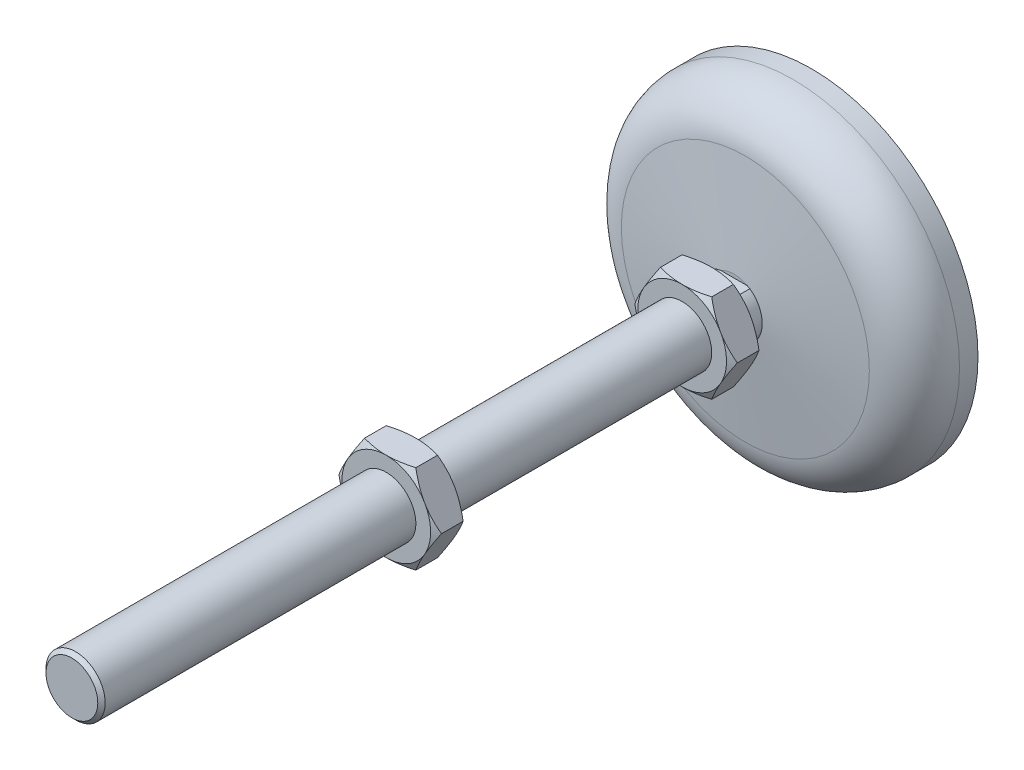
ISO-10303-21;
HEADER;
FILE_DESCRIPTION(('STEP AP214'),'2;1');
FILE_NAME('part.step','',(''),(''),'','','');
FILE_SCHEMA(('AUTOMOTIVE_DESIGN { 1 0 10303 214 1 1 1 1 }'));
ENDSEC;
DATA;
#1=APPLICATION_CONTEXT('core data for automotive mechanical design processes');
#2=APPLICATION_PROTOCOL_DEFINITION('international standard','automotive_design',2000,#1);
#3=PRODUCT_CONTEXT('',#1,'mechanical');
#4=PRODUCT('Part','Part','',(#3));
#5=PRODUCT_RELATED_PRODUCT_CATEGORY('part','',(#4));
#6=PRODUCT_DEFINITION_FORMATION('','',#4);
#7=PRODUCT_DEFINITION_CONTEXT('part definition',#1,'design');
#8=PRODUCT_DEFINITION('design','',#6,#7);
#9=PRODUCT_DEFINITION_SHAPE('','',#8);
#10=(LENGTH_UNIT() NAMED_UNIT(*) SI_UNIT(.MILLI.,.METRE.));
#11=(NAMED_UNIT(*) PLANE_ANGLE_UNIT() SI_UNIT($,.RADIAN.));
#12=(NAMED_UNIT(*) SI_UNIT($,.STERADIAN.) SOLID_ANGLE_UNIT());
#13=UNCERTAINTY_MEASURE_WITH_UNIT(LENGTH_MEASURE(1.E-05),#10,'distance_accuracy_value','');
#14=(GEOMETRIC_REPRESENTATION_CONTEXT(3) GLOBAL_UNCERTAINTY_ASSIGNED_CONTEXT((#13)) GLOBAL_UNIT_ASSIGNED_CONTEXT((#10,
#11,#12)) REPRESENTATION_CONTEXT('',''));
#15=CARTESIAN_POINT('',(0.,0.,0.));
#16=DIRECTION('',(0.,0.,1.));
#17=DIRECTION('',(1.,0.,0.));
#18=AXIS2_PLACEMENT_3D('',#15,#16,#17);
#19=CARTESIAN_POINT('',(3.5,0.,200.));
#20=DIRECTION('',(0.,0.,1.));
#21=DIRECTION('',(1.,0.,0.));
#22=AXIS2_PLACEMENT_3D('',#19,#20,#21);
#23=PLANE('',#22);
#24=CARTESIAN_POINT('',(0.,0.,200.));
#25=DIRECTION('',(0.,0.,-1.));
#26=DIRECTION('',(0.,1.,0.));
#27=AXIS2_PLACEMENT_3D('',#24,#25,#26);
#28=CIRCLE('',#27,7.);
#29=CARTESIAN_POINT('',(0.,7.,200.));
#30=VERTEX_POINT('',#29);
#31=EDGE_CURVE('E514',#30,#30,#28,.T.);
#32=ORIENTED_EDGE('',*,*,#31,.F.);
#33=EDGE_LOOP('',(#32));
#34=FACE_BOUND('',#33,.T.);
#35=ADVANCED_FACE('F17',(#34),#23,.T.);
#36=CARTESIAN_POINT('',(0.,0.,199.));
#37=DIRECTION('',(0.,0.,-1.));
#38=DIRECTION('',(0.,1.,0.));
#39=AXIS2_PLACEMENT_3D('',#36,#37,#38);
#40=CONICAL_SURFACE('',#39,8.,0.785398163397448);
#41=CARTESIAN_POINT('',(0.,0.,199.));
#42=DIRECTION('',(0.,0.,-1.));
#43=DIRECTION('',(-1.,0.,0.));
#44=AXIS2_PLACEMENT_3D('',#41,#42,#43);
#45=CIRCLE('',#44,8.);
#46=CARTESIAN_POINT('',(-8.,0.,199.));
#47=VERTEX_POINT('',#46);
#48=EDGE_CURVE('E511',#47,#47,#45,.T.);
#49=ORIENTED_EDGE('',*,*,#48,.F.);
#50=EDGE_LOOP('',(#49));
#51=FACE_BOUND('',#50,.T.);
#52=ORIENTED_EDGE('',*,*,#31,.T.);
#53=EDGE_LOOP('',(#52));
#54=FACE_BOUND('',#53,.T.);
#55=ADVANCED_FACE('F1654',(#51,#54),#40,.T.);
#56=CARTESIAN_POINT('',(0.,0.,7.097951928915));
#57=DIRECTION('',(0.,0.,-1.));
#58=DIRECTION('',(-1.,0.,0.));
#59=AXIS2_PLACEMENT_3D('',#56,#57,#58);
#60=CYLINDRICAL_SURFACE('',#59,8.);
#61=CARTESIAN_POINT('',(0.,0.,115.));
#62=DIRECTION('',(0.,0.,-1.));
#63=DIRECTION('',(-1.,0.,0.));
#64=AXIS2_PLACEMENT_3D('',#61,#62,#63);
#65=CIRCLE('',#64,8.);
#66=CARTESIAN_POINT('',(-8.,0.,115.));
#67=VERTEX_POINT('',#66);
#68=EDGE_CURVE('E252',#67,#67,#65,.F.);
#69=ORIENTED_EDGE('',*,*,#68,.T.);
#70=EDGE_LOOP('',(#69));
#71=FACE_BOUND('',#70,.T.);
#72=ORIENTED_EDGE('',*,*,#48,.T.);
#73=EDGE_LOOP('',(#72));
#74=FACE_BOUND('',#73,.T.);
#75=ADVANCED_FACE('F1646',(#71,#74),#60,.T.);
#76=CARTESIAN_POINT('',(0.,0.,115.));
#77=DIRECTION('',(0.,0.,-1.));
#78=DIRECTION('',(-1.,0.,0.));
#79=AXIS2_PLACEMENT_3D('',#76,#77,#78);
#80=PLANE('',#79);
#81=ORIENTED_EDGE('',*,*,#68,.F.);
#82=EDGE_LOOP('',(#81));
#83=FACE_BOUND('',#82,.T.);
#84=CARTESIAN_POINT('',(0.,0.,114.999999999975));
#85=DIRECTION('',(0.,0.,-1.));
#86=DIRECTION('',(-1.,0.,0.));
#87=AXIS2_PLACEMENT_3D('',#84,#85,#86);
#88=CIRCLE('',#87,11.999999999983);
#89=CARTESIAN_POINT('',(-10.3923048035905,6.00000007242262,114.999999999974));
#90=VERTEX_POINT('',#89);
#91=CARTESIAN_POINT('',(-1.40239433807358E-09,11.9999999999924,114.999999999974));
#92=VERTEX_POINT('',#91);
#93=EDGE_CURVE('E232',#90,#92,#88,.T.);
#94=ORIENTED_EDGE('',*,*,#93,.F.);
#95=CARTESIAN_POINT('',(0.,0.,114.999999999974));
#96=DIRECTION('',(0.,0.,-1.));
#97=DIRECTION('',(-1.,0.,0.));
#98=AXIS2_PLACEMENT_3D('',#95,#96,#97);
#99=CIRCLE('',#98,11.9999999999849);
#100=CARTESIAN_POINT('',(-10.3923048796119,-5.99999994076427,114.99999999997));
#101=VERTEX_POINT('',#100);
#102=EDGE_CURVE('E228',#101,#90,#99,.T.);
#103=ORIENTED_EDGE('',*,*,#102,.F.);
#104=CARTESIAN_POINT('',(0.,0.,114.999999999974));
#105=DIRECTION('',(0.,0.,-1.));
#106=DIRECTION('',(0.,1.,0.));
#107=AXIS2_PLACEMENT_3D('',#104,#105,#106);
#108=CIRCLE('',#107,11.9999999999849);
#109=CARTESIAN_POINT('',(-1.24448765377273E-07,-12.,114.99999999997));
#110=VERTEX_POINT('',#109);
#111=EDGE_CURVE('E225',#110,#101,#108,.T.);
#112=ORIENTED_EDGE('',*,*,#111,.F.);
#113=CARTESIAN_POINT('',(0.,0.,114.999999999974));
#114=DIRECTION('',(0.,0.,-1.));
#115=DIRECTION('',(-1.,0.,0.));
#116=AXIS2_PLACEMENT_3D('',#113,#114,#115);
#117=CIRCLE('',#116,11.9999999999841);
#118=CARTESIAN_POINT('',(10.3923048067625,-6.00000006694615,114.99999999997));
#119=VERTEX_POINT('',#118);
#120=EDGE_CURVE('E1427',#119,#110,#117,.T.);
#121=ORIENTED_EDGE('',*,*,#120,.F.);
#122=CARTESIAN_POINT('',(0.,0.,114.999999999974));
#123=DIRECTION('',(0.,0.,-1.));
#124=DIRECTION('',(-1.,0.,0.));
#125=AXIS2_PLACEMENT_3D('',#122,#123,#124);
#126=CIRCLE('',#125,11.9999999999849);
#127=CARTESIAN_POINT('',(10.3923049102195,5.999999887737,114.999999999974));
#128=VERTEX_POINT('',#127);
#129=EDGE_CURVE('E296',#128,#119,#126,.T.);
#130=ORIENTED_EDGE('',*,*,#129,.F.);
#131=CARTESIAN_POINT('',(0.,0.,114.999999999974));
#132=DIRECTION('',(0.,0.,-1.));
#133=DIRECTION('',(0.,1.,0.));
#134=AXIS2_PLACEMENT_3D('',#131,#132,#133);
#135=CIRCLE('',#134,11.9999999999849);
#136=EDGE_CURVE('E1426',#92,#128,#135,.T.);
#137=ORIENTED_EDGE('',*,*,#136,.F.);
#138=EDGE_LOOP('',(#94,#103,#112,#121,#130,#137));
#139=FACE_BOUND('',#138,.T.);
#140=ADVANCED_FACE('F230',(#83,#139),#80,.F.);
#141=CARTESIAN_POINT('',(0.,0.,113.92177244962));
#142=DIRECTION('',(0.,0.,-1.));
#143=DIRECTION('',(0.,1.,0.));
#144=AXIS2_PLACEMENT_3D('',#141,#142,#143);
#145=CONICAL_SURFACE('',#144,13.8675448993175,1.0471975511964);
#146=ORIENTED_EDGE('',*,*,#111,.T.);
#147=CARTESIAN_POINT('',(-10.3923049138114,-5.99999988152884,114.999999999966));
#148=CARTESIAN_POINT('',(-10.245273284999,-6.2546661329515,115.000049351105));
#149=CARTESIAN_POINT('',(-10.0982486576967,-6.50932025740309,114.993760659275));
#150=CARTESIAN_POINT('',(-9.80448808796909,-7.01812848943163,114.968872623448));
#151=CARTESIAN_POINT('',(-9.65775209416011,-7.27228268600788,114.950275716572));
#152=CARTESIAN_POINT('',(-9.36551675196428,-7.77844914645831,114.901259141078));
#153=CARTESIAN_POINT('',(-9.22001488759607,-8.03046576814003,114.87089899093));
#154=CARTESIAN_POINT('',(-8.92970373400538,-8.53329943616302,114.799004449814));
#155=CARTESIAN_POINT('',(-8.7848944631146,-8.78411645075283,114.757469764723));
#156=CARTESIAN_POINT('',(-8.49629339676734,-9.28398816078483,114.664073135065));
#157=CARTESIAN_POINT('',(-8.35250058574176,-9.53304461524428,114.612223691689));
#158=CARTESIAN_POINT('',(-8.06585137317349,-10.0295356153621,114.499049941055));
#159=CARTESIAN_POINT('',(-7.92299502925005,-10.276970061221,114.437725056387));
#160=CARTESIAN_POINT('',(-7.49448545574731,-11.0191704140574,114.240244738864));
#161=CARTESIAN_POINT('',(-7.21030907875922,-11.5113783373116,114.091059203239));
#162=CARTESIAN_POINT('',(-6.92820323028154,-11.9999999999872,113.928203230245));
#163=B_SPLINE_CURVE_WITH_KNOTS('',3,(#147,#148,#149,#150,#151,#152,#153,#154,#155,#156,#157,
#158,#159,#160,#161,#162),.UNSPECIFIED.,.F.,.F.,(4,2,2,2,2,2,2,4),(0.,0.882100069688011,
1.76402552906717,2.64154578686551,3.51908914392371,4.39557535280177,5.27211499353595,
7.03380300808),.UNSPECIFIED.);
#164=CARTESIAN_POINT('',(-6.92820323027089,-11.9999999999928,113.928203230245));
#165=VERTEX_POINT('',#164);
#166=EDGE_CURVE('E244',#101,#165,#163,.T.);
#167=ORIENTED_EDGE('',*,*,#166,.T.);
#168=CARTESIAN_POINT('',(-6.92820323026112,-12.0000000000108,113.928203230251));
#169=CARTESIAN_POINT('',(-6.36399156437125,-12.0000000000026,114.09105919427));
#170=CARTESIAN_POINT('',(-5.79563884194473,-12.0000000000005,114.240244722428));
#171=CARTESIAN_POINT('',(-4.93861974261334,-11.9999999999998,114.437725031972));
#172=CARTESIAN_POINT('',(-4.65290707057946,-11.9999999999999,114.499049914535));
#173=CARTESIAN_POINT('',(-4.07960867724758,-12.0000000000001,114.612223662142));
#174=CARTESIAN_POINT('',(-3.79202307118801,-12.,114.664073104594));
#175=CARTESIAN_POINT('',(-3.21482097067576,-12.,114.757469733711));
#176=CARTESIAN_POINT('',(-2.92520244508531,-12.,114.799004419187));
#177=CARTESIAN_POINT('',(-2.34458017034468,-12.,114.870898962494));
#178=CARTESIAN_POINT('',(-2.05357645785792,-12.,114.901259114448));
#179=CARTESIAN_POINT('',(-1.46910580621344,-12.,114.950275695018));
#180=CARTESIAN_POINT('',(-1.17563383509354,-12.,114.968872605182));
#181=CARTESIAN_POINT('',(-0.588112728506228,-12.,114.99376064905));
#182=CARTESIAN_POINT('',(-0.294063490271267,-12.,115.000049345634));
#183=CARTESIAN_POINT('',(-2.4889752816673E-07,-12.,114.999999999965));
#184=B_SPLINE_CURVE_WITH_KNOTS('',3,(#168,#169,#170,#171,#172,#173,#174,#175,#176,#177,#178,
#179,#180,#181,#182,#183),.UNSPECIFIED.,.F.,.F.,(4,2,2,2,2,2,2,4),(0.,1.76168791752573,
2.63822751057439,3.51471367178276,4.39225698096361,5.26977719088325,6.15170260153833,
7.03380262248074),.UNSPECIFIED.);
#185=EDGE_CURVE('E250',#165,#110,#184,.T.);
#186=ORIENTED_EDGE('',*,*,#185,.T.);
#187=EDGE_LOOP('',(#146,#167,#186));
#188=FACE_BOUND('',#187,.T.);
#189=ADVANCED_FACE('F248',(#188),#145,.T.);
#190=CARTESIAN_POINT('',(0.,0.,113.921772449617));
#191=DIRECTION('',(0.,0.,-1.));
#192=DIRECTION('',(-1.,0.,0.));
#193=AXIS2_PLACEMENT_3D('',#190,#191,#192);
#194=CONICAL_SURFACE('',#193,13.867544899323,1.0471975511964);
#195=ORIENTED_EDGE('',*,*,#102,.T.);
#196=CARTESIAN_POINT('',(-10.3923047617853,6.00000014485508,114.999999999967));
#197=CARTESIAN_POINT('',(-10.5393363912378,5.74533389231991,115.000049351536));
#198=CARTESIAN_POINT('',(-10.6863610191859,5.49067976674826,114.993760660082));
#199=CARTESIAN_POINT('',(-10.9801215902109,4.98187153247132,114.96887262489));
#200=CARTESIAN_POINT('',(-11.1268575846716,4.72771733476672,114.950275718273));
#201=CARTESIAN_POINT('',(-11.4190929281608,4.22155087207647,114.90125914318));
#202=CARTESIAN_POINT('',(-11.5645947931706,3.96953424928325,114.870898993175));
#203=CARTESIAN_POINT('',(-11.8549059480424,3.4667005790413,114.799004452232));
#204=CARTESIAN_POINT('',(-11.9997152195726,3.21588356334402,114.757469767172));
#205=CARTESIAN_POINT('',(-12.2883162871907,2.71601185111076,114.664073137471));
#206=CARTESIAN_POINT('',(-12.4321090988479,2.46695539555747,114.612223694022));
#207=CARTESIAN_POINT('',(-12.7187583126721,1.97046439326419,114.499049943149));
#208=CARTESIAN_POINT('',(-12.86161465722,1.72302994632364,114.437725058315));
#209=CARTESIAN_POINT('',(-13.2901242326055,0.980829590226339,114.240244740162));
#210=CARTESIAN_POINT('',(-13.5743006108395,0.488621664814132,114.091059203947));
#211=CARTESIAN_POINT('',(-13.856406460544,1.35219052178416E-11,113.928203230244));
#212=B_SPLINE_CURVE_WITH_KNOTS('',3,(#196,#197,#198,#199,#200,#201,#202,#203,#204,#205,#206,
#207,#208,#209,#210,#211),.UNSPECIFIED.,.F.,.F.,(4,2,2,2,2,2,2,4),(0.,0.882100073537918,
1.76402553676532,2.64154579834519,3.5190891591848,4.39557537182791,5.2721150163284,
7.03380303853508),.UNSPECIFIED.);
#213=CARTESIAN_POINT('',(-13.8564064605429,6.65881397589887E-13,113.928203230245));
#214=VERTEX_POINT('',#213);
#215=EDGE_CURVE('E240',#90,#214,#212,.T.);
#216=ORIENTED_EDGE('',*,*,#215,.T.);
#217=CARTESIAN_POINT('',(-13.8564064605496,-1.58936466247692E-11,113.92820323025));
#218=CARTESIAN_POINT('',(-13.5743006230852,-0.488621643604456,114.091059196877));
#219=CARTESIAN_POINT('',(-13.2901242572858,-0.980829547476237,114.240244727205));
#220=CARTESIAN_POINT('',(-12.8616147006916,-1.72302987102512,114.437725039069));
#221=CARTESIAN_POINT('',(-12.7187583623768,-1.97046430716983,114.499049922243));
#222=CARTESIAN_POINT('',(-12.4321091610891,-2.46695528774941,114.61222367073));
#223=CARTESIAN_POINT('',(-12.2883163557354,-2.71601173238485,114.664073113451));
#224=CARTESIAN_POINT('',(-11.9997153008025,-3.21588342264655,114.757469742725));
#225=CARTESIAN_POINT('',(-11.8549060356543,-3.46670042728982,114.799004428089));
#226=CARTESIAN_POINT('',(-11.5645948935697,-3.96953407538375,114.870898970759));
#227=CARTESIAN_POINT('',(-11.4190930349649,-4.22155068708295,114.901259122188));
#228=CARTESIAN_POINT('',(-11.1268577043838,-4.72771712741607,114.950275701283));
#229=CARTESIAN_POINT('',(-10.9801217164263,-4.9818713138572,114.968872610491));
#230=CARTESIAN_POINT('',(-10.6863611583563,-5.49067952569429,114.993760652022));
#231=CARTESIAN_POINT('',(-10.5393365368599,-5.74533364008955,115.000049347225));
#232=CARTESIAN_POINT('',(-10.3923049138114,-5.99999988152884,114.999999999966));
#233=B_SPLINE_CURVE_WITH_KNOTS('',3,(#217,#218,#219,#220,#221,#222,#223,#224,#225,#226,#227,
#228,#229,#230,#231,#232),.UNSPECIFIED.,.F.,.F.,(4,2,2,2,2,2,2,4),(0.,1.76168794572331,
2.63822755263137,3.51471372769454,4.39225705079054,5.26977727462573,6.15170269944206,
7.03380273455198),.UNSPECIFIED.);
#234=EDGE_CURVE('E238',#214,#101,#233,.T.);
#235=ORIENTED_EDGE('',*,*,#234,.T.);
#236=EDGE_LOOP('',(#195,#216,#235));
#237=FACE_BOUND('',#236,.T.);
#238=ADVANCED_FACE('F239',(#237),#194,.T.);
#239=CARTESIAN_POINT('',(0.,0.,113.921772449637));
#240=DIRECTION('',(0.,0.,-1.));
#241=DIRECTION('',(-1.,0.,0.));
#242=AXIS2_PLACEMENT_3D('',#239,#240,#241);
#243=CONICAL_SURFACE('',#242,13.8675448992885,1.0471975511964);
#244=ORIENTED_EDGE('',*,*,#93,.T.);
#245=CARTESIAN_POINT('',(-2.45418630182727E-09,12.,114.999999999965));
#246=CARTESIAN_POINT('',(-0.294063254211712,12.,115.000049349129));
#247=CARTESIAN_POINT('',(-0.588112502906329,12.,114.993760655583));
#248=CARTESIAN_POINT('',(-1.17563363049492,12.,114.968872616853));
#249=CARTESIAN_POINT('',(-1.46910561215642,12.,114.95027570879));
#250=CARTESIAN_POINT('',(-2.05357628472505,12.,114.901259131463));
#251=CARTESIAN_POINT('',(-2.34458000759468,12.,114.870898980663));
#252=CARTESIAN_POINT('',(-2.92520230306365,12.,114.799004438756));
#253=CARTESIAN_POINT('',(-3.21482083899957,12.,114.757469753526));
#254=CARTESIAN_POINT('',(-3.79202296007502,12.,114.664073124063));
#255=CARTESIAN_POINT('',(-4.07960857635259,12.,114.612223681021));
#256=CARTESIAN_POINT('',(-4.65290699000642,12.,114.49904993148));
#257=CARTESIAN_POINT('',(-4.9386196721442,12.,114.437725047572));
#258=CARTESIAN_POINT('',(-5.79563880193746,12.,114.240244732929));
#259=CARTESIAN_POINT('',(-6.36399154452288,12.,114.0910592));
#260=CARTESIAN_POINT('',(-6.92820323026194,12.,113.928203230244));
#261=B_SPLINE_CURVE_WITH_KNOTS('',3,(#245,#246,#247,#248,#249,#250,#251,#252,#253,#254,#255,
#256,#257,#258,#259,#260),.UNSPECIFIED.,.F.,.F.,(4,2,2,2,2,2,2,4),(0.,0.882100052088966,
1.76402549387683,2.64154573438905,3.51908907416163,4.39557526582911,5.27211488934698,
7.03380286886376),.UNSPECIFIED.);
#262=CARTESIAN_POINT('',(-6.928203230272,11.9999999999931,113.928203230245));
#263=VERTEX_POINT('',#262);
#264=EDGE_CURVE('E408',#92,#263,#261,.T.);
#265=ORIENTED_EDGE('',*,*,#264,.T.);
#266=CARTESIAN_POINT('',(-6.92820323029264,11.9999999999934,113.928203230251));
#267=CARTESIAN_POINT('',(-7.21030906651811,11.5113783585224,114.091059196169));
#268=CARTESIAN_POINT('',(-7.49448543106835,11.0191704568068,114.240244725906));
#269=CARTESIAN_POINT('',(-7.92299498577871,10.2769701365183,114.43772503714));
#270=CARTESIAN_POINT('',(-8.06585132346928,10.0295357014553,114.499049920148));
#271=CARTESIAN_POINT('',(-8.35250052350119,9.53304472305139,114.612223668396));
#272=CARTESIAN_POINT('',(-8.4962933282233,9.28398827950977,114.664073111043));
#273=CARTESIAN_POINT('',(-8.78489438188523,8.78411659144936,114.757469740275));
#274=CARTESIAN_POINT('',(-8.92970364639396,8.5332995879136,114.799004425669));
#275=CARTESIAN_POINT('',(-9.22001478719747,8.03046594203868,114.870898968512));
#276=CARTESIAN_POINT('',(-9.36551664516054,7.77844933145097,114.901259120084));
#277=CARTESIAN_POINT('',(-9.65775197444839,7.27228289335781,114.95027569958));
#278=CARTESIAN_POINT('',(-9.80448796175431,7.01812870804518,114.968872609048));
#279=CARTESIAN_POINT('',(-10.0982485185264,6.50932049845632,114.993760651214));
#280=CARTESIAN_POINT('',(-10.2452731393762,6.25466638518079,115.000049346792));
#281=CARTESIAN_POINT('',(-10.3923047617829,6.0000001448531,114.999999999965));
#282=B_SPLINE_CURVE_WITH_KNOTS('',3,(#266,#267,#268,#269,#270,#271,#272,#273,#274,#275,#276,
#277,#278,#279,#280,#281),.UNSPECIFIED.,.F.,.F.,(4,2,2,2,2,2,2,4),(0.,1.76168793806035,
2.63822754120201,3.51471371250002,4.39225703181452,5.26977725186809,6.151702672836,
7.03380270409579),.UNSPECIFIED.);
#283=EDGE_CURVE('E259',#263,#90,#282,.T.);
#284=ORIENTED_EDGE('',*,*,#283,.T.);
#285=EDGE_LOOP('',(#244,#265,#284));
#286=FACE_BOUND('',#285,.T.);
#287=ADVANCED_FACE('F396',(#286),#243,.T.);
#288=CARTESIAN_POINT('',(0.,0.,113.921772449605));
#289=DIRECTION('',(0.,0.,-1.));
#290=DIRECTION('',(0.,1.,0.));
#291=AXIS2_PLACEMENT_3D('',#288,#289,#290);
#292=CONICAL_SURFACE('',#291,13.8675448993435,1.0471975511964);
#293=ORIENTED_EDGE('',*,*,#136,.T.);
#294=CARTESIAN_POINT('',(10.3923049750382,5.99999977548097,114.999999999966));
#295=CARTESIAN_POINT('',(10.2452733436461,6.25466603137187,115.000049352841));
#296=CARTESIAN_POINT('',(10.0982487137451,6.50932016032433,114.993760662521));
#297=CARTESIAN_POINT('',(9.80448813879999,7.01812840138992,114.968872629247));
#298=CARTESIAN_POINT('',(9.65775214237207,7.27228260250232,114.950275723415));
#299=CARTESIAN_POINT('',(9.36551679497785,7.77844907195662,114.901259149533));
#300=CARTESIAN_POINT('',(9.22001492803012,8.03046569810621,114.870898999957));
#301=CARTESIAN_POINT('',(8.92970376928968,8.53329937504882,114.799004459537));
#302=CARTESIAN_POINT('',(8.78489449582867,8.78411639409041,114.757469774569));
#303=CARTESIAN_POINT('',(8.4962934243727,9.28398811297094,114.664073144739));
#304=CARTESIAN_POINT('',(8.35250061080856,9.53304457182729,114.61222370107));
#305=CARTESIAN_POINT('',(8.06585139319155,10.0295355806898,114.499049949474));
#306=CARTESIAN_POINT('',(7.92299504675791,10.2769700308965,114.437725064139));
#307=CARTESIAN_POINT('',(7.49448546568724,11.0191703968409,114.240244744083));
#308=CARTESIAN_POINT('',(7.21030908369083,11.5113783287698,114.091059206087));
#309=CARTESIAN_POINT('',(6.92820323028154,11.9999999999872,113.928203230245));
#310=B_SPLINE_CURVE_WITH_KNOTS('',3,(#294,#295,#296,#297,#298,#299,#300,#301,#302,#303,#304,
#305,#306,#307,#308,#309),.UNSPECIFIED.,.F.,.F.,(4,2,2,2,2,2,2,4),(0.,0.882100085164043,
1.76402556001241,2.6415458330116,3.51908920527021,4.39557542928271,5.27211508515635,
7.03380313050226),.UNSPECIFIED.);
#311=CARTESIAN_POINT('',(6.92820323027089,11.9999999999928,113.928203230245));
#312=VERTEX_POINT('',#311);
#313=EDGE_CURVE('E380',#128,#312,#310,.T.);
#314=ORIENTED_EDGE('',*,*,#313,.T.);
#315=CARTESIAN_POINT('',(6.92820323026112,12.0000000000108,113.928203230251));
#316=CARTESIAN_POINT('',(6.3639915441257,12.0000000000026,114.091059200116));
#317=CARTESIAN_POINT('',(5.79563880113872,12.0000000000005,114.240244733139));
#318=CARTESIAN_POINT('',(4.93861967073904,11.9999999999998,114.437725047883));
#319=CARTESIAN_POINT('',(4.65290698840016,11.9999999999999,114.499049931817));
#320=CARTESIAN_POINT('',(4.07960857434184,12.0000000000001,114.612223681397));
#321=CARTESIAN_POINT('',(3.79202295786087,12.,114.664073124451));
#322=CARTESIAN_POINT('',(3.21482083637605,12.,114.757469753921));
#323=CARTESIAN_POINT('',(2.92520230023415,12.,114.799004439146));
#324=CARTESIAN_POINT('',(2.34458000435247,12.,114.870898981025));
#325=CARTESIAN_POINT('',(2.05357628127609,12.,114.901259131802));
#326=CARTESIAN_POINT('',(1.46910560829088,12.,114.950275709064));
#327=CARTESIAN_POINT('',(1.17563362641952,12.,114.968872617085));
#328=CARTESIAN_POINT('',(0.588112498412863,12.,114.993760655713));
#329=CARTESIAN_POINT('',(0.294063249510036,12.,115.000049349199));
#330=CARTESIAN_POINT('',(-2.45418891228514E-09,12.,114.999999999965));
#331=B_SPLINE_CURVE_WITH_KNOTS('',3,(#315,#316,#317,#318,#319,#320,#321,#322,#323,#324,#325,
#326,#327,#328,#329,#330),.UNSPECIFIED.,.F.,.F.,(4,2,2,2,2,2,2,4),(0.,1.76168798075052,
2.63822760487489,3.51471379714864,4.39225713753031,5.26977737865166,6.15170282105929,
7.03380287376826),.UNSPECIFIED.);
#332=EDGE_CURVE('E401',#312,#92,#331,.T.);
#333=ORIENTED_EDGE('',*,*,#332,.T.);
#334=EDGE_LOOP('',(#293,#314,#333));
#335=FACE_BOUND('',#334,.T.);
#336=ADVANCED_FACE('F390',(#335),#292,.T.);
#337=CARTESIAN_POINT('',(0.,0.,113.921772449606));
#338=DIRECTION('',(0.,0.,-1.));
#339=DIRECTION('',(-1.,0.,0.));
#340=AXIS2_PLACEMENT_3D('',#337,#338,#339);
#341=CONICAL_SURFACE('',#340,13.8675448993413,1.0471975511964);
#342=ORIENTED_EDGE('',*,*,#120,.T.);
#343=CARTESIAN_POINT('',(-2.48897530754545E-07,-12.,114.999999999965));
#344=CARTESIAN_POINT('',(0.294063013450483,-12.,115.000049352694));
#345=CARTESIAN_POINT('',(0.588112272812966,-12.,114.993760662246));
#346=CARTESIAN_POINT('',(1.1756334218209,-12.,114.968872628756));
#347=CARTESIAN_POINT('',(1.46910541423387,-12.,114.950275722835));
#348=CARTESIAN_POINT('',(2.05357610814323,-12.,114.901259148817));
#349=CARTESIAN_POINT('',(2.34457984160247,-12.,114.870898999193));
#350=CARTESIAN_POINT('',(2.92520215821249,-12.,114.799004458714));
#351=CARTESIAN_POINT('',(3.21482070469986,-12.,114.757469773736));
#352=CARTESIAN_POINT('',(3.79202284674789,-12.,114.664073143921));
#353=CARTESIAN_POINT('',(4.07960847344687,-12.,114.612223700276));
#354=CARTESIAN_POINT('',(4.65290690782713,-12.,114.499049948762));
#355=CARTESIAN_POINT('',(4.93861960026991,-12.,114.437725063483));
#356=CARTESIAN_POINT('',(5.79563876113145,-12.,114.240244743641));
#357=CARTESIAN_POINT('',(6.36399152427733,-12.,114.091059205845));
#358=CARTESIAN_POINT('',(6.92820323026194,-12.,113.928203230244));
#359=B_SPLINE_CURVE_WITH_KNOTS('',3,(#343,#344,#345,#346,#347,#348,#349,#350,#351,#352,#353,
#354,#355,#356,#357,#358),.UNSPECIFIED.,.F.,.F.,(4,2,2,2,2,2,2,4),(0.,0.882100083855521,
1.76402555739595,2.64154582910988,3.51908920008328,4.39557542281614,5.27211507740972,
7.03380312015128),.UNSPECIFIED.);
#360=CARTESIAN_POINT('',(6.928203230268,-12.,113.928203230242));
#361=VERTEX_POINT('',#360);
#362=EDGE_CURVE('E245',#110,#361,#359,.T.);
#363=ORIENTED_EDGE('',*,*,#362,.T.);
#364=CARTESIAN_POINT('',(6.92820323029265,-11.9999999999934,113.928203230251));
#365=CARTESIAN_POINT('',(7.21030906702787,-11.5113783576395,114.091059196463));
#366=CARTESIAN_POINT('',(7.4944854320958,-11.0191704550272,114.240244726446));
#367=CARTESIAN_POINT('',(7.92299498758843,-10.2769701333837,114.437725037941));
#368=CARTESIAN_POINT('',(8.06585132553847,-10.0295356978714,114.499049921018));
#369=CARTESIAN_POINT('',(8.35250052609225,-9.53304471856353,114.612223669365));
#370=CARTESIAN_POINT('',(8.49629333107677,-9.28398827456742,114.664073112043));
#371=CARTESIAN_POINT('',(8.78489438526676,-8.78411658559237,114.757469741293));
#372=CARTESIAN_POINT('',(8.92970365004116,-8.53329958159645,114.799004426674));
#373=CARTESIAN_POINT('',(9.22001479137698,-8.03046593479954,114.870898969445));
#374=CARTESIAN_POINT('',(9.36551664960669,-7.77844932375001,114.901259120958));
#375=CARTESIAN_POINT('',(9.65775197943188,-7.27228288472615,114.950275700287));
#376=CARTESIAN_POINT('',(9.80448796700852,-7.01812869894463,114.968872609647));
#377=CARTESIAN_POINT('',(10.0982485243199,-6.50932048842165,114.993760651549));
#378=CARTESIAN_POINT('',(10.2452731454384,-6.25466637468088,115.000049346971));
#379=CARTESIAN_POINT('',(10.3923047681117,-6.00000013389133,114.999999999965));
#380=B_SPLINE_CURVE_WITH_KNOTS('',3,(#364,#365,#366,#367,#368,#369,#370,#371,#372,#373,#374,
#375,#376,#377,#378,#379),.UNSPECIFIED.,.F.,.F.,(4,2,2,2,2,2,2,4),(0.,1.76168794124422,
2.6382275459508,3.51471371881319,4.3922570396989,5.26977726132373,6.15170268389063,
7.03380271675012),.UNSPECIFIED.);
#381=EDGE_CURVE('E372',#361,#119,#380,.T.);
#382=ORIENTED_EDGE('',*,*,#381,.T.);
#383=EDGE_LOOP('',(#342,#363,#382));
#384=FACE_BOUND('',#383,.T.);
#385=ADVANCED_FACE('F387',(#384),#341,.T.);
#386=CARTESIAN_POINT('',(0.,0.,113.921772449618));
#387=DIRECTION('',(0.,0.,-1.));
#388=DIRECTION('',(-1.,0.,0.));
#389=AXIS2_PLACEMENT_3D('',#386,#387,#388);
#390=CONICAL_SURFACE('',#389,13.8675448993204,1.0471975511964);
#391=ORIENTED_EDGE('',*,*,#129,.T.);
#392=CARTESIAN_POINT('',(10.3923047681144,-6.00000013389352,114.999999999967));
#393=CARTESIAN_POINT('',(10.5393363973,-5.74533388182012,115.000049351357));
#394=CARTESIAN_POINT('',(10.6863610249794,-5.49067975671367,114.993760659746));
#395=CARTESIAN_POINT('',(10.980121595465,-4.98187152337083,114.96887262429));
#396=CARTESIAN_POINT('',(11.126857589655,-4.72771732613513,114.950275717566));
#397=CARTESIAN_POINT('',(11.4190929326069,-4.22155086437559,114.901259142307));
#398=CARTESIAN_POINT('',(11.5645947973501,-3.9695342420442,114.870898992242));
#399=CARTESIAN_POINT('',(11.8549059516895,-3.46670057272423,114.799004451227));
#400=CARTESIAN_POINT('',(11.9997152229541,-3.21588355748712,114.757469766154));
#401=CARTESIAN_POINT('',(12.2883162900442,-2.7160118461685,114.664073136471));
#402=CARTESIAN_POINT('',(12.4321091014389,-2.46695539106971,114.612223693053));
#403=CARTESIAN_POINT('',(12.7187583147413,-1.97046438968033,114.499049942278));
#404=CARTESIAN_POINT('',(12.8616146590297,-1.7230299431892,114.437725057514));
#405=CARTESIAN_POINT('',(13.2901242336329,-0.980829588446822,114.240244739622));
#406=CARTESIAN_POINT('',(13.5743006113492,-0.488621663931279,114.091059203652));
#407=CARTESIAN_POINT('',(13.856406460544,-1.36087538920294E-11,113.928203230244));
#408=B_SPLINE_CURVE_WITH_KNOTS('',3,(#392,#393,#394,#395,#396,#397,#398,#399,#400,#401,#402,
#403,#404,#405,#406,#407),.UNSPECIFIED.,.F.,.F.,(4,2,2,2,2,2,2,4),(0.,0.882100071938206,
1.7640255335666,2.64154579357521,3.5190891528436,4.39557536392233,5.2721150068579,
7.03380302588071),.UNSPECIFIED.);
#409=CARTESIAN_POINT('',(13.8564064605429,-7.57904290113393E-13,113.928203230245));
#410=VERTEX_POINT('',#409);
#411=EDGE_CURVE('E366',#119,#410,#408,.T.);
#412=ORIENTED_EDGE('',*,*,#411,.T.);
#413=CARTESIAN_POINT('',(13.8564064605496,1.57901836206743E-11,113.92820323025));
#414=CARTESIAN_POINT('',(13.5743006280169,0.488621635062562,114.091059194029));
#415=CARTESIAN_POINT('',(13.2901242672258,0.980829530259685,114.240244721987));
#416=CARTESIAN_POINT('',(12.8616147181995,1.72302984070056,114.437725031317));
#417=CARTESIAN_POINT('',(12.7187583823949,1.97046427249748,114.499049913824));
#418=CARTESIAN_POINT('',(12.4321091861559,2.46695524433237,114.612223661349));
#419=CARTESIAN_POINT('',(12.2883163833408,2.71601168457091,114.664073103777));
#420=CARTESIAN_POINT('',(11.9997153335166,3.21588336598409,114.757469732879));
#421=CARTESIAN_POINT('',(11.8549060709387,3.46670036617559,114.799004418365));
#422=CARTESIAN_POINT('',(11.5645949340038,3.96953400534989,114.870898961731));
#423=CARTESIAN_POINT('',(11.4190930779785,4.22155061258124,114.901259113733));
#424=CARTESIAN_POINT('',(11.1268577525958,4.72771704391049,114.95027569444));
#425=CARTESIAN_POINT('',(10.9801217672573,4.98187122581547,114.968872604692));
#426=CARTESIAN_POINT('',(10.6863612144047,5.49067942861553,114.993760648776));
#427=CARTESIAN_POINT('',(10.539336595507,5.74533353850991,115.000049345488));
#428=CARTESIAN_POINT('',(10.3923049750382,5.99999977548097,114.999999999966));
#429=B_SPLINE_CURVE_WITH_KNOTS('',3,(#413,#414,#415,#416,#417,#418,#419,#420,#421,#422,#423,
#424,#425,#426,#427,#428),.UNSPECIFIED.,.F.,.F.,(4,2,2,2,2,2,2,4),(0.,1.76168791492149,
2.63822750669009,3.51471366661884,4.39225697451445,5.2697771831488,6.15170259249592,
7.03380261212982),.UNSPECIFIED.);
#430=EDGE_CURVE('E509',#410,#128,#429,.T.);
#431=ORIENTED_EDGE('',*,*,#430,.T.);
#432=EDGE_LOOP('',(#391,#412,#431));
#433=FACE_BOUND('',#432,.T.);
#434=ADVANCED_FACE('F307',(#433),#390,.T.);
#435=CARTESIAN_POINT('',(-6.928203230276,-12.,27.));
#436=DIRECTION('',(0.,1.,0.));
#437=DIRECTION('',(0.,0.,1.));
#438=AXIS2_PLACEMENT_3D('',#435,#436,#437);
#439=PLANE('',#438);
#440=ORIENTED_EDGE('',*,*,#362,.F.);
#441=ORIENTED_EDGE('',*,*,#185,.F.);
#442=DIRECTION('',(0.,0.,1.));
#443=VECTOR('',#442,1.);
#444=CARTESIAN_POINT('',(-6.92820323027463,-11.9999999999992,27.));
#445=LINE('',#444,#443);
#446=CARTESIAN_POINT('',(-6.92820321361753,-12.0000000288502,108.071796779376));
#447=VERTEX_POINT('',#446);
#448=EDGE_CURVE('E257',#165,#447,#445,.F.);
#449=ORIENTED_EDGE('',*,*,#448,.T.);
#450=CARTESIAN_POINT('',(-7.8953255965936E-10,-12.,107.000000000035));
#451=CARTESIAN_POINT('',(-0.294063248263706,-12.,106.99995065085));
#452=CARTESIAN_POINT('',(-0.588112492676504,-12.,107.006239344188));
#453=CARTESIAN_POINT('',(-1.17563361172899,-12.,107.031127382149));
#454=CARTESIAN_POINT('',(-1.4691055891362,-12.,107.049724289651));
#455=CARTESIAN_POINT('',(-2.05357625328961,-12.,107.09874086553));
#456=CARTESIAN_POINT('',(-2.34457997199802,-12.,107.129101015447));
#457=CARTESIAN_POINT('',(-2.92520225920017,-12.,107.200995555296));
#458=CARTESIAN_POINT('',(-3.21482079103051,-12.,107.242530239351));
#459=CARTESIAN_POINT('',(-3.79202290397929,-12.,107.335926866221));
#460=CARTESIAN_POINT('',(-4.07960851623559,-12.,107.387776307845));
#461=CARTESIAN_POINT('',(-4.65290692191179,-12.,107.500950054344));
#462=CARTESIAN_POINT('',(-4.93861960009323,-12.,107.562274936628));
#463=CARTESIAN_POINT('',(-5.79563871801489,-12.,107.75975524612));
#464=CARTESIAN_POINT('',(-6.36399145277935,-12.,107.908940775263));
#465=CARTESIAN_POINT('',(-6.92820313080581,-12.,108.071796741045));
#466=B_SPLINE_CURVE_WITH_KNOTS('',3,(#450,#451,#452,#453,#454,#455,#456,#457,#458,#459,#460,
#461,#462,#463,#464,#465),.UNSPECIFIED.,.F.,.F.,(4,2,2,2,2,2,2,4),(0.,0.882100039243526,
1.76402546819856,2.64154569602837,3.51908902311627,4.39557520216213,5.27211481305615,
7.03380276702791),.UNSPECIFIED.);
#467=CARTESIAN_POINT('',(-7.89534267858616E-10,-11.999999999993,107.000000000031));
#468=VERTEX_POINT('',#467);
#469=EDGE_CURVE('E313',#468,#447,#466,.T.);
#470=ORIENTED_EDGE('',*,*,#469,.F.);
#471=CARTESIAN_POINT('',(6.92820329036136,-11.999999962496,108.071796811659));
#472=CARTESIAN_POINT('',(6.36399160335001,-11.9999999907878,107.908940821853));
#473=CARTESIAN_POINT('',(5.79563885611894,-11.9999999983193,107.759755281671));
#474=CARTESIAN_POINT('',(4.93861971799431,-12.0000000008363,107.562274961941));
#475=CARTESIAN_POINT('',(4.65290703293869,-12.0000000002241,107.500950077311));
#476=CARTESIAN_POINT('',(4.0796086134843,-11.9999999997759,107.387776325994));
#477=CARTESIAN_POINT('',(3.79202299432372,-11.9999999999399,107.335926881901));
#478=CARTESIAN_POINT('',(3.21482086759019,-12.0000000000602,107.242530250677));
#479=CARTESIAN_POINT('',(2.92520232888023,-12.0000000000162,107.200995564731));
#480=CARTESIAN_POINT('',(2.34458002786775,-11.9999999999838,107.129101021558));
#481=CARTESIAN_POINT('',(2.05357630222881,-11.9999999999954,107.098740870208));
#482=CARTESIAN_POINT('',(1.46910562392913,-12.0000000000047,107.049724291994));
#483=CARTESIAN_POINT('',(1.17563363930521,-12.0000000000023,107.031127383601));
#484=CARTESIAN_POINT('',(0.588112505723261,-11.9999999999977,107.006239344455));
#485=CARTESIAN_POINT('',(0.294063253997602,-11.9999999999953,106.999950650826));
#486=CARTESIAN_POINT('',(-7.89530535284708E-10,-12.,107.000000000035));
#487=B_SPLINE_CURVE_WITH_KNOTS('',3,(#471,#472,#473,#474,#475,#476,#477,#478,#479,#480,#481,
#482,#483,#484,#485,#486),.UNSPECIFIED.,.F.,.F.,(4,2,2,2,2,2,2,4),(0.,1.7616879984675,
2.63822763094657,3.51471383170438,4.39225718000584,5.26977742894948,6.1517028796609,
7.03380294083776),.UNSPECIFIED.);
#488=CARTESIAN_POINT('',(6.92820326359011,-12.,108.071796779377));
#489=VERTEX_POINT('',#488);
#490=EDGE_CURVE('E322',#489,#468,#487,.T.);
#491=ORIENTED_EDGE('',*,*,#490,.F.);
#492=DIRECTION('',(0.,0.,1.));
#493=VECTOR('',#492,1.);
#494=CARTESIAN_POINT('',(6.928203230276,-12.,27.));
#495=LINE('',#494,#493);
#496=EDGE_CURVE('E379',#489,#361,#495,.T.);
#497=ORIENTED_EDGE('',*,*,#496,.T.);
#498=EDGE_LOOP('',(#440,#441,#449,#470,#491,#497));
#499=FACE_BOUND('',#498,.T.);
#500=ADVANCED_FACE('F303',(#499),#439,.F.);
#501=CARTESIAN_POINT('',(-13.85640646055,0.,27.));
#502=DIRECTION('',(0.866025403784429,0.500000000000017,0.));
#503=DIRECTION('',(-0.500000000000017,0.866025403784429,0.));
#504=AXIS2_PLACEMENT_3D('',#501,#502,#503);
#505=PLANE('',#504);
#506=ORIENTED_EDGE('',*,*,#166,.F.);
#507=ORIENTED_EDGE('',*,*,#234,.F.);
#508=DIRECTION('',(0.,0.,1.));
#509=VECTOR('',#508,1.);
#510=CARTESIAN_POINT('',(-13.8564064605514,7.8756445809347E-13,27.));
#511=LINE('',#510,#509);
#512=CARTESIAN_POINT('',(-13.8564064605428,6.68231707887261E-13,108.071796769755));
#513=VERTEX_POINT('',#512);
#514=EDGE_CURVE('E409',#214,#513,#511,.F.);
#515=ORIENTED_EDGE('',*,*,#514,.T.);
#516=CARTESIAN_POINT('',(-10.3923048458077,-5.9999999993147,107.000000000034));
#517=CARTESIAN_POINT('',(-10.5393364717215,-5.74533375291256,106.999950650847));
#518=CARTESIAN_POINT('',(-10.6863610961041,-5.4906796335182,107.006239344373));
#519=CARTESIAN_POINT('',(-10.9801216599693,-4.98187141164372,107.031127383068));
#520=CARTESIAN_POINT('',(-11.1268576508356,-4.72771722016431,107.049724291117));
#521=CARTESIAN_POINT('',(-11.4190929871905,-4.22155076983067,107.098740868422));
#522=CARTESIAN_POINT('',(-11.5645948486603,-3.96953415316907,107.129101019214));
#523=CARTESIAN_POINT('',(-11.8549059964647,-3.46670049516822,107.200995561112));
#524=CARTESIAN_POINT('',(-11.9997152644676,-3.21588348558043,107.242530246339));
#525=CARTESIAN_POINT('',(-12.2883163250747,-2.71601178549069,107.335926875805));
#526=CARTESIAN_POINT('',(-12.4321091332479,-2.46695533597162,107.387776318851));
#527=CARTESIAN_POINT('',(-12.7187583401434,-1.97046434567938,107.500950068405));
#528=CARTESIAN_POINT('',(-12.8616146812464,-1.72302990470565,107.562274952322));
#529=CARTESIAN_POINT('',(-13.2901242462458,-0.980829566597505,107.759755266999));
#530=CARTESIAN_POINT('',(-13.5743006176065,-0.488621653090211,107.908940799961));
#531=CARTESIAN_POINT('',(-13.856406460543,-1.21835814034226E-11,108.071796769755));
#532=B_SPLINE_CURVE_WITH_KNOTS('',3,(#516,#517,#518,#519,#520,#521,#522,#523,#524,#525,#526,
#527,#528,#529,#530,#531),.UNSPECIFIED.,.F.,.F.,(4,2,2,2,2,2,2,4),(0.,0.882100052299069,
1.76402549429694,2.64154573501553,3.51908907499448,4.39557526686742,5.27211489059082,
7.03380287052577),.UNSPECIFIED.);
#533=CARTESIAN_POINT('',(-10.3923048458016,-5.99999999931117,107.00000000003));
#534=VERTEX_POINT('',#533);
#535=EDGE_CURVE('E468',#534,#513,#532,.T.);
#536=ORIENTED_EDGE('',*,*,#535,.F.);
#537=CARTESIAN_POINT('',(-6.92820316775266,-12.000000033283,108.071796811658));
#538=CARTESIAN_POINT('',(-7.21030903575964,-11.5113783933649,107.908940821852));
#539=CARTESIAN_POINT('',(-7.49448541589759,-11.0191704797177,107.75975528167));
#540=CARTESIAN_POINT('',(-7.92299498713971,-10.2769701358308,107.56227496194));
#541=CARTESIAN_POINT('',(-8.06585132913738,-10.029535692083,107.50095007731));
#542=CARTESIAN_POINT('',(-8.35250053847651,-9.53304469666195,107.387776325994));
#543=CARTESIAN_POINT('',(-8.49629334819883,-9.28398824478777,107.3359268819));
#544=CARTESIAN_POINT('',(-8.78489441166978,-8.78411653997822,107.242530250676));
#545=CARTESIAN_POINT('',(-8.9297036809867,-8.53329952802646,107.20099556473));
#546=CARTESIAN_POINT('',(-9.22001483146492,-8.03046586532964,107.129101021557));
#547=CARTESIAN_POINT('',(-9.36551669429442,-7.77844924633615,107.098740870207));
#548=CARTESIAN_POINT('',(-9.65775203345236,-7.27228279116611,107.049724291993));
#549=CARTESIAN_POINT('',(-9.80448802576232,-7.01812859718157,107.0311273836));
#550=CARTESIAN_POINT('',(-10.0982485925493,-6.509320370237,107.006239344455));
#551=CARTESIAN_POINT('',(-10.2452732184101,-6.25466624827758,106.999950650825));
#552=CARTESIAN_POINT('',(-10.3923048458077,-5.9999999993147,107.000000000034));
#553=B_SPLINE_CURVE_WITH_KNOTS('',3,(#537,#538,#539,#540,#541,#542,#543,#544,#545,#546,#547,
#548,#549,#550,#551,#552),.UNSPECIFIED.,.F.,.F.,(4,2,2,2,2,2,2,4),(0.,1.76168799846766,
2.63822763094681,3.5147138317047,4.39225718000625,5.26977742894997,6.15170287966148,
7.03380294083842),.UNSPECIFIED.);
#554=EDGE_CURVE('E474',#447,#534,#553,.T.);
#555=ORIENTED_EDGE('',*,*,#554,.F.);
#556=ORIENTED_EDGE('',*,*,#448,.F.);
#557=EDGE_LOOP('',(#506,#507,#515,#536,#555,#556));
#558=FACE_BOUND('',#557,.T.);
#559=ADVANCED_FACE('F255',(#558),#505,.F.);
#560=CARTESIAN_POINT('',(-6.928203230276,12.,27.));
#561=DIRECTION('',(0.866025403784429,-0.500000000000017,0.));
#562=DIRECTION('',(0.500000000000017,0.866025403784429,0.));
#563=AXIS2_PLACEMENT_3D('',#560,#561,#562);
#564=PLANE('',#563);
#565=ORIENTED_EDGE('',*,*,#215,.F.);
#566=ORIENTED_EDGE('',*,*,#283,.F.);
#567=DIRECTION('',(0.,0.,-1.));
#568=VECTOR('',#567,1.);
#569=CARTESIAN_POINT('',(-6.928203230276,12.,27.));
#570=LINE('',#569,#568);
#571=CARTESIAN_POINT('',(-6.92820326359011,12.,108.071796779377));
#572=VERTEX_POINT('',#571);
#573=EDGE_CURVE('E507',#263,#572,#570,.T.);
#574=ORIENTED_EDGE('',*,*,#573,.T.);
#575=CARTESIAN_POINT('',(-10.3923048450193,6.00000000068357,107.000000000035));
#576=CARTESIAN_POINT('',(-10.2452732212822,6.25466624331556,106.99995065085));
#577=CARTESIAN_POINT('',(-10.0982485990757,6.50932035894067,107.006239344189));
#578=CARTESIAN_POINT('',(-9.80448803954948,7.0181285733,107.031127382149));
#579=CARTESIAN_POINT('',(-9.65775205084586,7.2722827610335,107.049724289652));
#580=CARTESIAN_POINT('',(-9.36551671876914,7.77844920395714,107.098740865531));
#581=CARTESIAN_POINT('',(-9.22001485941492,8.03046581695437,107.129101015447));
#582=CARTESIAN_POINT('',(-8.92970371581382,8.53329946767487,107.200995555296));
#583=CARTESIAN_POINT('',(-8.78489444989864,8.78411647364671,107.242530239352));
#584=CARTESIAN_POINT('',(-8.49629339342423,9.28398816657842,107.335926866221));
#585=CARTESIAN_POINT('',(-8.35250058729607,9.53304461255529,107.387776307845));
#586=CARTESIAN_POINT('',(-8.06585138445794,10.02953559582,107.500950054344));
#587=CARTESIAN_POINT('',(-7.92299504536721,10.2769700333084,107.562274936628));
#588=CARTESIAN_POINT('',(-7.49448548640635,11.0191703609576,107.75975524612));
#589=CARTESIAN_POINT('',(-7.2103091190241,11.5113782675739,107.908940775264));
#590=CARTESIAN_POINT('',(-6.92820328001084,11.9999999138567,108.071796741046));
#591=B_SPLINE_CURVE_WITH_KNOTS('',3,(#575,#576,#577,#578,#579,#580,#581,#582,#583,#584,#585,
#586,#587,#588,#589,#590),.UNSPECIFIED.,.F.,.F.,(4,2,2,2,2,2,2,4),(0.,0.882100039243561,
1.76402546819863,2.64154569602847,3.5190890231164,4.3955752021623,5.27211481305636,
7.03380276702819),.UNSPECIFIED.);
#592=CARTESIAN_POINT('',(-10.3923048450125,6.00000000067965,107.000000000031));
#593=VERTEX_POINT('',#592);
#594=EDGE_CURVE('E444',#593,#572,#591,.T.);
#595=ORIENTED_EDGE('',*,*,#594,.F.);
#596=CARTESIAN_POINT('',(-13.8564064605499,1.70517685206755E-11,108.071796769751));
#597=CARTESIAN_POINT('',(-13.574300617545,0.488621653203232,107.908940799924));
#598=CARTESIAN_POINT('',(-13.2901242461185,0.980829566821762,107.759755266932));
#599=CARTESIAN_POINT('',(-12.8616146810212,1.7230299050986,107.562274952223));
#600=CARTESIAN_POINT('',(-12.7187583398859,1.97046434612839,107.500950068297));
#601=CARTESIAN_POINT('',(-12.4321091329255,2.46695533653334,107.387776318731));
#602=CARTESIAN_POINT('',(-12.2883163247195,2.71601178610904,107.335926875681));
#603=CARTESIAN_POINT('',(-11.9997152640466,3.2158834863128,107.242530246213));
#604=CARTESIAN_POINT('',(-11.8549059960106,3.46670049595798,107.200995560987));
#605=CARTESIAN_POINT('',(-11.5645948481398,3.96953415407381,107.129101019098));
#606=CARTESIAN_POINT('',(-11.4190929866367,4.22155077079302,107.098740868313));
#607=CARTESIAN_POINT('',(-11.1268576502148,4.72771722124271,107.049724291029));
#608=CARTESIAN_POINT('',(-10.9801216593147,4.98187141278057,107.031127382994));
#609=CARTESIAN_POINT('',(-10.6863610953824,5.4906796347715,107.006239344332));
#610=CARTESIAN_POINT('',(-10.5393364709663,5.74533375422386,106.999950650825));
#611=CARTESIAN_POINT('',(-10.3923048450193,6.00000000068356,107.000000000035));
#612=B_SPLINE_CURVE_WITH_KNOTS('',3,(#596,#597,#598,#599,#600,#601,#602,#603,#604,#605,#606,
#607,#608,#609,#610,#611),.UNSPECIFIED.,.F.,.F.,(4,2,2,2,2,2,2,4),(0.,1.76168798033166,
2.63822760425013,3.51471379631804,4.39225713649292,5.26977737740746,6.15170281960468,
7.03380287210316),.UNSPECIFIED.);
#613=EDGE_CURVE('E462',#513,#593,#612,.T.);
#614=ORIENTED_EDGE('',*,*,#613,.F.);
#615=ORIENTED_EDGE('',*,*,#514,.F.);
#616=EDGE_LOOP('',(#565,#566,#574,#595,#614,#615));
#617=FACE_BOUND('',#616,.T.);
#618=ADVANCED_FACE('F421',(#617),#564,.F.);
#619=CARTESIAN_POINT('',(6.928203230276,12.,27.));
#620=DIRECTION('',(0.,-1.,0.));
#621=DIRECTION('',(0.,0.,-1.));
#622=AXIS2_PLACEMENT_3D('',#619,#620,#621);
#623=PLANE('',#622);
#624=ORIENTED_EDGE('',*,*,#264,.F.);
#625=ORIENTED_EDGE('',*,*,#332,.F.);
#626=DIRECTION('',(0.,0.,1.));
#627=VECTOR('',#626,1.);
#628=CARTESIAN_POINT('',(6.92820323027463,11.9999999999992,27.));
#629=LINE('',#628,#627);
#630=CARTESIAN_POINT('',(6.92820321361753,12.0000000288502,108.071796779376));
#631=VERTEX_POINT('',#630);
#632=EDGE_CURVE('E505',#312,#631,#629,.F.);
#633=ORIENTED_EDGE('',*,*,#632,.T.);
#634=CARTESIAN_POINT('',(7.89524374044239E-10,12.,107.000000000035));
#635=CARTESIAN_POINT('',(0.294063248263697,12.,106.99995065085));
#636=CARTESIAN_POINT('',(0.588112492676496,12.,107.006239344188));
#637=CARTESIAN_POINT('',(1.17563361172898,12.,107.031127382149));
#638=CARTESIAN_POINT('',(1.46910558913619,12.,107.049724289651));
#639=CARTESIAN_POINT('',(2.05357625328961,12.,107.09874086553));
#640=CARTESIAN_POINT('',(2.34457997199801,12.,107.129101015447));
#641=CARTESIAN_POINT('',(2.92520225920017,12.,107.200995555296));
#642=CARTESIAN_POINT('',(3.21482079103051,12.,107.242530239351));
#643=CARTESIAN_POINT('',(3.79202290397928,12.,107.335926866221));
#644=CARTESIAN_POINT('',(4.07960851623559,12.,107.387776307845));
#645=CARTESIAN_POINT('',(4.65290692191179,12.,107.500950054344));
#646=CARTESIAN_POINT('',(4.93861960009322,12.,107.562274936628));
#647=CARTESIAN_POINT('',(5.79563871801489,12.,107.75975524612));
#648=CARTESIAN_POINT('',(6.36399145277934,12.,107.908940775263));
#649=CARTESIAN_POINT('',(6.92820313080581,12.,108.071796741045));
#650=B_SPLINE_CURVE_WITH_KNOTS('',3,(#634,#635,#636,#637,#638,#639,#640,#641,#642,#643,#644,
#645,#646,#647,#648,#649),.UNSPECIFIED.,.F.,.F.,(4,2,2,2,2,2,2,4),(0.,0.882100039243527,
1.76402546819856,2.64154569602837,3.51908902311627,4.39557520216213,5.27211481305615,
7.03380276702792),.UNSPECIFIED.);
#651=CARTESIAN_POINT('',(7.89524111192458E-10,11.999999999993,107.000000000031));
#652=VERTEX_POINT('',#651);
#653=EDGE_CURVE('E427',#652,#631,#650,.T.);
#654=ORIENTED_EDGE('',*,*,#653,.F.);
#655=CARTESIAN_POINT('',(-6.92820329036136,11.999999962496,108.071796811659));
#656=CARTESIAN_POINT('',(-6.36399160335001,11.9999999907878,107.908940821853));
#657=CARTESIAN_POINT('',(-5.79563885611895,11.9999999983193,107.759755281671));
#658=CARTESIAN_POINT('',(-4.93861971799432,12.0000000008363,107.562274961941));
#659=CARTESIAN_POINT('',(-4.6529070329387,12.0000000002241,107.500950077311));
#660=CARTESIAN_POINT('',(-4.07960861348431,11.9999999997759,107.387776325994));
#661=CARTESIAN_POINT('',(-3.79202299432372,11.9999999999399,107.335926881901));
#662=CARTESIAN_POINT('',(-3.2148208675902,12.0000000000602,107.242530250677));
#663=CARTESIAN_POINT('',(-2.92520232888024,12.0000000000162,107.200995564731));
#664=CARTESIAN_POINT('',(-2.34458002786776,11.9999999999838,107.129101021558));
#665=CARTESIAN_POINT('',(-2.05357630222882,11.9999999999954,107.098740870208));
#666=CARTESIAN_POINT('',(-1.46910562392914,12.0000000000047,107.049724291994));
#667=CARTESIAN_POINT('',(-1.17563363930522,12.0000000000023,107.031127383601));
#668=CARTESIAN_POINT('',(-0.588112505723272,11.9999999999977,107.006239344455));
#669=CARTESIAN_POINT('',(-0.294063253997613,11.9999999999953,106.999950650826));
#670=CARTESIAN_POINT('',(7.89518825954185E-10,12.,107.000000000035));
#671=B_SPLINE_CURVE_WITH_KNOTS('',3,(#655,#656,#657,#658,#659,#660,#661,#662,#663,#664,#665,
#666,#667,#668,#669,#670),.UNSPECIFIED.,.F.,.F.,(4,2,2,2,2,2,2,4),(0.,1.7616879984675,
2.63822763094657,3.51471383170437,4.39225718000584,5.26977742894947,6.15170287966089,
7.03380294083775),.UNSPECIFIED.);
#672=EDGE_CURVE('E436',#572,#652,#671,.T.);
#673=ORIENTED_EDGE('',*,*,#672,.F.);
#674=ORIENTED_EDGE('',*,*,#573,.F.);
#675=EDGE_LOOP('',(#624,#625,#633,#654,#673,#674));
#676=FACE_BOUND('',#675,.T.);
#677=ADVANCED_FACE('F418',(#676),#623,.F.);
#678=CARTESIAN_POINT('',(13.85640646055,0.,27.));
#679=DIRECTION('',(-0.866025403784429,-0.500000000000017,0.));
#680=DIRECTION('',(0.500000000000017,-0.866025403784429,0.));
#681=AXIS2_PLACEMENT_3D('',#678,#679,#680);
#682=PLANE('',#681);
#683=ORIENTED_EDGE('',*,*,#313,.F.);
#684=ORIENTED_EDGE('',*,*,#430,.F.);
#685=DIRECTION('',(0.,0.,1.));
#686=VECTOR('',#685,1.);
#687=CARTESIAN_POINT('',(13.8564064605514,-7.8756445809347E-13,27.));
#688=LINE('',#687,#686);
#689=CARTESIAN_POINT('',(13.8564064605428,-6.6753369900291E-13,108.071796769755));
#690=VERTEX_POINT('',#689);
#691=EDGE_CURVE('E371',#410,#690,#688,.F.);
#692=ORIENTED_EDGE('',*,*,#691,.T.);
#693=CARTESIAN_POINT('',(10.3923048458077,5.9999999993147,107.000000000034));
#694=CARTESIAN_POINT('',(10.5393364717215,5.74533375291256,106.999950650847));
#695=CARTESIAN_POINT('',(10.6863610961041,5.4906796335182,107.006239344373));
#696=CARTESIAN_POINT('',(10.9801216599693,4.98187141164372,107.031127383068));
#697=CARTESIAN_POINT('',(11.1268576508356,4.72771722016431,107.049724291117));
#698=CARTESIAN_POINT('',(11.4190929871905,4.22155076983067,107.098740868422));
#699=CARTESIAN_POINT('',(11.5645948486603,3.96953415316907,107.129101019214));
#700=CARTESIAN_POINT('',(11.8549059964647,3.46670049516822,107.200995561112));
#701=CARTESIAN_POINT('',(11.9997152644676,3.21588348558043,107.242530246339));
#702=CARTESIAN_POINT('',(12.2883163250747,2.7160117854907,107.335926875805));
#703=CARTESIAN_POINT('',(12.4321091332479,2.46695533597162,107.387776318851));
#704=CARTESIAN_POINT('',(12.7187583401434,1.97046434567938,107.500950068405));
#705=CARTESIAN_POINT('',(12.8616146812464,1.72302990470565,107.562274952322));
#706=CARTESIAN_POINT('',(13.2901242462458,0.980829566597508,107.759755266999));
#707=CARTESIAN_POINT('',(13.5743006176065,0.488621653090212,107.908940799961));
#708=CARTESIAN_POINT('',(13.856406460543,1.21857991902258E-11,108.071796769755));
#709=B_SPLINE_CURVE_WITH_KNOTS('',3,(#693,#694,#695,#696,#697,#698,#699,#700,#701,#702,#703,
#704,#705,#706,#707,#708),.UNSPECIFIED.,.F.,.F.,(4,2,2,2,2,2,2,4),(0.,0.882100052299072,
1.76402549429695,2.64154573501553,3.51908907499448,4.39557526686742,5.27211489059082,
7.03380287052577),.UNSPECIFIED.);
#710=CARTESIAN_POINT('',(10.3923048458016,5.99999999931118,107.00000000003));
#711=VERTEX_POINT('',#710);
#712=EDGE_CURVE('E897',#711,#690,#709,.T.);
#713=ORIENTED_EDGE('',*,*,#712,.F.);
#714=CARTESIAN_POINT('',(6.92820316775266,12.000000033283,108.071796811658));
#715=CARTESIAN_POINT('',(7.21030903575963,11.5113783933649,107.908940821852));
#716=CARTESIAN_POINT('',(7.49448541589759,11.0191704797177,107.75975528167));
#717=CARTESIAN_POINT('',(7.92299498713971,10.2769701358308,107.56227496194));
#718=CARTESIAN_POINT('',(8.06585132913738,10.029535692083,107.50095007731));
#719=CARTESIAN_POINT('',(8.35250053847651,9.53304469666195,107.387776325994));
#720=CARTESIAN_POINT('',(8.49629334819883,9.28398824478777,107.3359268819));
#721=CARTESIAN_POINT('',(8.78489441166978,8.78411653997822,107.242530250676));
#722=CARTESIAN_POINT('',(8.9297036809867,8.53329952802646,107.20099556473));
#723=CARTESIAN_POINT('',(9.22001483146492,8.03046586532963,107.129101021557));
#724=CARTESIAN_POINT('',(9.36551669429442,7.77844924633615,107.098740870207));
#725=CARTESIAN_POINT('',(9.65775203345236,7.27228279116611,107.049724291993));
#726=CARTESIAN_POINT('',(9.80448802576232,7.01812859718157,107.0311273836));
#727=CARTESIAN_POINT('',(10.0982485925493,6.50932037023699,107.006239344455));
#728=CARTESIAN_POINT('',(10.2452732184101,6.25466624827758,106.999950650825));
#729=CARTESIAN_POINT('',(10.3923048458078,5.9999999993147,107.000000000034));
#730=B_SPLINE_CURVE_WITH_KNOTS('',3,(#714,#715,#716,#717,#718,#719,#720,#721,#722,#723,#724,
#725,#726,#727,#728,#729),.UNSPECIFIED.,.F.,.F.,(4,2,2,2,2,2,2,4),(0.,1.76168799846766,
2.63822763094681,3.5147138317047,4.39225718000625,5.26977742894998,6.15170287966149,
7.03380294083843),.UNSPECIFIED.);
#731=EDGE_CURVE('E902',#631,#711,#730,.T.);
#732=ORIENTED_EDGE('',*,*,#731,.F.);
#733=ORIENTED_EDGE('',*,*,#632,.F.);
#734=EDGE_LOOP('',(#683,#684,#692,#713,#732,#733));
#735=FACE_BOUND('',#734,.T.);
#736=ADVANCED_FACE('F349',(#735),#682,.F.);
#737=CARTESIAN_POINT('',(6.928203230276,-12.,27.));
#738=DIRECTION('',(-0.866025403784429,0.500000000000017,0.));
#739=DIRECTION('',(-0.500000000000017,-0.866025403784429,0.));
#740=AXIS2_PLACEMENT_3D('',#737,#738,#739);
#741=PLANE('',#740);
#742=ORIENTED_EDGE('',*,*,#411,.F.);
#743=ORIENTED_EDGE('',*,*,#381,.F.);
#744=ORIENTED_EDGE('',*,*,#496,.F.);
#745=CARTESIAN_POINT('',(10.3923048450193,-6.00000000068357,107.000000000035));
#746=CARTESIAN_POINT('',(10.2452732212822,-6.25466624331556,106.99995065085));
#747=CARTESIAN_POINT('',(10.0982485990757,-6.50932035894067,107.006239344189));
#748=CARTESIAN_POINT('',(9.80448803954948,-7.0181285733,107.031127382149));
#749=CARTESIAN_POINT('',(9.65775205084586,-7.27228276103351,107.049724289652));
#750=CARTESIAN_POINT('',(9.36551671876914,-7.77844920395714,107.098740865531));
#751=CARTESIAN_POINT('',(9.22001485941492,-8.03046581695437,107.129101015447));
#752=CARTESIAN_POINT('',(8.92970371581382,-8.53329946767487,107.200995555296));
#753=CARTESIAN_POINT('',(8.78489444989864,-8.78411647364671,107.242530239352));
#754=CARTESIAN_POINT('',(8.49629339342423,-9.28398816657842,107.335926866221));
#755=CARTESIAN_POINT('',(8.35250058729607,-9.53304461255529,107.387776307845));
#756=CARTESIAN_POINT('',(8.06585138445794,-10.02953559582,107.500950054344));
#757=CARTESIAN_POINT('',(7.92299504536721,-10.2769700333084,107.562274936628));
#758=CARTESIAN_POINT('',(7.49448548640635,-11.0191703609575,107.75975524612));
#759=CARTESIAN_POINT('',(7.2103091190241,-11.5113782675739,107.908940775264));
#760=CARTESIAN_POINT('',(6.92820328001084,-11.9999999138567,108.071796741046));
#761=B_SPLINE_CURVE_WITH_KNOTS('',3,(#745,#746,#747,#748,#749,#750,#751,#752,#753,#754,#755,
#756,#757,#758,#759,#760),.UNSPECIFIED.,.F.,.F.,(4,2,2,2,2,2,2,4),(0.,0.882100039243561,
1.76402546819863,2.64154569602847,3.5190890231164,4.3955752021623,5.27211481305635,
7.03380276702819),.UNSPECIFIED.);
#762=CARTESIAN_POINT('',(10.3923048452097,-6.00000000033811,107.000000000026));
#763=VERTEX_POINT('',#762);
#764=EDGE_CURVE('E330',#763,#489,#761,.T.);
#765=ORIENTED_EDGE('',*,*,#764,.F.);
#766=CARTESIAN_POINT('',(13.8564064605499,-1.70513046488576E-11,108.071796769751));
#767=CARTESIAN_POINT('',(13.574300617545,-0.488621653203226,107.908940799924));
#768=CARTESIAN_POINT('',(13.2901242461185,-0.98082956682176,107.759755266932));
#769=CARTESIAN_POINT('',(12.8616146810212,-1.7230299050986,107.562274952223));
#770=CARTESIAN_POINT('',(12.7187583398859,-1.97046434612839,107.500950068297));
#771=CARTESIAN_POINT('',(12.4321091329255,-2.46695533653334,107.387776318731));
#772=CARTESIAN_POINT('',(12.2883163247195,-2.71601178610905,107.335926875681));
#773=CARTESIAN_POINT('',(11.9997152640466,-3.2158834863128,107.242530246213));
#774=CARTESIAN_POINT('',(11.8549059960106,-3.46670049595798,107.200995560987));
#775=CARTESIAN_POINT('',(11.5645948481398,-3.96953415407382,107.129101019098));
#776=CARTESIAN_POINT('',(11.4190929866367,-4.22155077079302,107.098740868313));
#777=CARTESIAN_POINT('',(11.1268576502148,-4.72771722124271,107.049724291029));
#778=CARTESIAN_POINT('',(10.9801216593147,-4.98187141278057,107.031127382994));
#779=CARTESIAN_POINT('',(10.6863610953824,-5.4906796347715,107.006239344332));
#780=CARTESIAN_POINT('',(10.5393364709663,-5.74533375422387,106.999950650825));
#781=CARTESIAN_POINT('',(10.3923048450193,-6.00000000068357,107.000000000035));
#782=B_SPLINE_CURVE_WITH_KNOTS('',3,(#766,#767,#768,#769,#770,#771,#772,#773,#774,#775,#776,
#777,#778,#779,#780,#781),.UNSPECIFIED.,.F.,.F.,(4,2,2,2,2,2,2,4),(0.,1.76168798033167,
2.63822760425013,3.51471379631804,4.39225713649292,5.26977737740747,6.15170281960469,
7.03380287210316),.UNSPECIFIED.);
#783=EDGE_CURVE('E358',#690,#763,#782,.T.);
#784=ORIENTED_EDGE('',*,*,#783,.F.);
#785=ORIENTED_EDGE('',*,*,#691,.F.);
#786=EDGE_LOOP('',(#742,#743,#744,#765,#784,#785));
#787=FACE_BOUND('',#786,.T.);
#788=ADVANCED_FACE('F341',(#787),#741,.F.);
#789=CARTESIAN_POINT('',(0.,0.,108.078227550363));
#790=DIRECTION('',(0.,0.,1.));
#791=DIRECTION('',(1.,0.,0.));
#792=AXIS2_PLACEMENT_3D('',#789,#790,#791);
#793=CONICAL_SURFACE('',#792,13.8675448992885,1.0471975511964);
#794=ORIENTED_EDGE('',*,*,#764,.T.);
#795=ORIENTED_EDGE('',*,*,#490,.T.);
#796=CARTESIAN_POINT('',(0.,0.,107.000000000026));
#797=DIRECTION('',(0.,0.,1.));
#798=DIRECTION('',(1.,0.,0.));
#799=AXIS2_PLACEMENT_3D('',#796,#797,#798);
#800=CIRCLE('',#799,11.9999999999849);
#801=EDGE_CURVE('E491',#763,#468,#800,.F.);
#802=ORIENTED_EDGE('',*,*,#801,.F.);
#803=EDGE_LOOP('',(#794,#795,#802));
#804=FACE_BOUND('',#803,.T.);
#805=ADVANCED_FACE('F337',(#804),#793,.T.);
#806=CARTESIAN_POINT('',(0.,0.,108.078227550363));
#807=DIRECTION('',(0.,0.,1.));
#808=DIRECTION('',(1.,0.,0.));
#809=AXIS2_PLACEMENT_3D('',#806,#807,#808);
#810=CONICAL_SURFACE('',#809,13.8675448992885,1.0471975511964);
#811=ORIENTED_EDGE('',*,*,#469,.T.);
#812=ORIENTED_EDGE('',*,*,#554,.T.);
#813=CARTESIAN_POINT('',(0.,0.,107.000000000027));
#814=DIRECTION('',(0.,0.,1.));
#815=DIRECTION('',(1.,0.,0.));
#816=AXIS2_PLACEMENT_3D('',#813,#814,#815);
#817=CIRCLE('',#816,11.9999999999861);
#818=EDGE_CURVE('E484',#468,#534,#817,.F.);
#819=ORIENTED_EDGE('',*,*,#818,.F.);
#820=EDGE_LOOP('',(#811,#812,#819));
#821=FACE_BOUND('',#820,.T.);
#822=ADVANCED_FACE('F340',(#821),#810,.T.);
#823=CARTESIAN_POINT('',(0.,0.,108.078227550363));
#824=DIRECTION('',(0.,0.,1.));
#825=DIRECTION('',(0.,-1.,0.));
#826=AXIS2_PLACEMENT_3D('',#823,#824,#825);
#827=CONICAL_SURFACE('',#826,13.8675448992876,1.0471975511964);
#828=ORIENTED_EDGE('',*,*,#613,.T.);
#829=CARTESIAN_POINT('',(0.,0.,107.000000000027));
#830=DIRECTION('',(0.,0.,1.));
#831=DIRECTION('',(0.,-1.,0.));
#832=AXIS2_PLACEMENT_3D('',#829,#830,#831);
#833=CIRCLE('',#832,11.999999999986);
#834=EDGE_CURVE('E927',#534,#593,#833,.F.);
#835=ORIENTED_EDGE('',*,*,#834,.F.);
#836=ORIENTED_EDGE('',*,*,#535,.T.);
#837=EDGE_LOOP('',(#828,#835,#836));
#838=FACE_BOUND('',#837,.T.);
#839=ADVANCED_FACE('F454',(#838),#827,.T.);
#840=CARTESIAN_POINT('',(0.,0.,108.078227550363));
#841=DIRECTION('',(0.,0.,1.));
#842=DIRECTION('',(1.,0.,0.));
#843=AXIS2_PLACEMENT_3D('',#840,#841,#842);
#844=CONICAL_SURFACE('',#843,13.8675448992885,1.0471975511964);
#845=ORIENTED_EDGE('',*,*,#594,.T.);
#846=ORIENTED_EDGE('',*,*,#672,.T.);
#847=CARTESIAN_POINT('',(0.,0.,107.000000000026));
#848=DIRECTION('',(0.,0.,1.));
#849=DIRECTION('',(1.,0.,0.));
#850=AXIS2_PLACEMENT_3D('',#847,#848,#849);
#851=CIRCLE('',#850,11.9999999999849);
#852=EDGE_CURVE('E922',#593,#652,#851,.F.);
#853=ORIENTED_EDGE('',*,*,#852,.F.);
#854=EDGE_LOOP('',(#845,#846,#853));
#855=FACE_BOUND('',#854,.T.);
#856=ADVANCED_FACE('F450',(#855),#844,.T.);
#857=CARTESIAN_POINT('',(0.,0.,108.078227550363));
#858=DIRECTION('',(0.,0.,1.));
#859=DIRECTION('',(1.,0.,0.));
#860=AXIS2_PLACEMENT_3D('',#857,#858,#859);
#861=CONICAL_SURFACE('',#860,13.8675448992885,1.0471975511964);
#862=ORIENTED_EDGE('',*,*,#653,.T.);
#863=ORIENTED_EDGE('',*,*,#731,.T.);
#864=CARTESIAN_POINT('',(0.,0.,107.000000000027));
#865=DIRECTION('',(0.,0.,1.));
#866=DIRECTION('',(1.,0.,0.));
#867=AXIS2_PLACEMENT_3D('',#864,#865,#866);
#868=CIRCLE('',#867,11.9999999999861);
#869=EDGE_CURVE('E913',#652,#711,#868,.F.);
#870=ORIENTED_EDGE('',*,*,#869,.F.);
#871=EDGE_LOOP('',(#862,#863,#870));
#872=FACE_BOUND('',#871,.T.);
#873=ADVANCED_FACE('F453',(#872),#861,.T.);
#874=CARTESIAN_POINT('',(0.,0.,108.078227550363));
#875=DIRECTION('',(0.,0.,1.));
#876=DIRECTION('',(0.,-1.,0.));
#877=AXIS2_PLACEMENT_3D('',#874,#875,#876);
#878=CONICAL_SURFACE('',#877,13.8675448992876,1.0471975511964);
#879=ORIENTED_EDGE('',*,*,#783,.T.);
#880=CARTESIAN_POINT('',(0.,0.,107.000000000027));
#881=DIRECTION('',(0.,0.,1.));
#882=DIRECTION('',(0.,-1.,0.));
#883=AXIS2_PLACEMENT_3D('',#880,#881,#882);
#884=CIRCLE('',#883,11.999999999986);
#885=EDGE_CURVE('E934',#711,#763,#884,.F.);
#886=ORIENTED_EDGE('',*,*,#885,.F.);
#887=ORIENTED_EDGE('',*,*,#712,.T.);
#888=EDGE_LOOP('',(#879,#886,#887));
#889=FACE_BOUND('',#888,.T.);
#890=ADVANCED_FACE('F891',(#889),#878,.T.);
#891=CARTESIAN_POINT('',(0.,0.,107.));
#892=DIRECTION('',(0.,0.,-1.));
#893=DIRECTION('',(-1.,0.,0.));
#894=AXIS2_PLACEMENT_3D('',#891,#892,#893);
#895=PLANE('',#894);
#896=CARTESIAN_POINT('',(0.,0.,107.));
#897=DIRECTION('',(0.,0.,-1.));
#898=DIRECTION('',(-1.,0.,0.));
#899=AXIS2_PLACEMENT_3D('',#896,#897,#898);
#900=CIRCLE('',#899,8.);
#901=CARTESIAN_POINT('',(-8.,0.,107.));
#902=VERTEX_POINT('',#901);
#903=EDGE_CURVE('E943',#902,#902,#900,.T.);
#904=ORIENTED_EDGE('',*,*,#903,.F.);
#905=EDGE_LOOP('',(#904));
#906=FACE_BOUND('',#905,.T.);
#907=ORIENTED_EDGE('',*,*,#869,.T.);
#908=ORIENTED_EDGE('',*,*,#885,.T.);
#909=ORIENTED_EDGE('',*,*,#801,.T.);
#910=ORIENTED_EDGE('',*,*,#818,.T.);
#911=ORIENTED_EDGE('',*,*,#834,.T.);
#912=ORIENTED_EDGE('',*,*,#852,.T.);
#913=EDGE_LOOP('',(#907,#908,#909,#910,#911,#912));
#914=FACE_BOUND('',#913,.T.);
#915=ADVANCED_FACE('F888',(#906,#914),#895,.T.);
#916=CARTESIAN_POINT('',(0.,0.,13.6647161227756));
#917=DIRECTION('',(0.,0.,-1.));
#918=DIRECTION('',(0.,1.,0.));
#919=AXIS2_PLACEMENT_3D('',#916,#917,#918);
#920=CONICAL_SURFACE('',#919,1.89056035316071,0.610865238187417);
#921=CARTESIAN_POINT('',(0.,0.,16.3647161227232));
#922=VERTEX_POINT('',#921);
#923=VERTEX_LOOP('',#922);
#924=FACE_BOUND('',#923,.T.);
#925=CARTESIAN_POINT('',(0.,0.,13.6647161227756));
#926=DIRECTION('',(0.,0.,-1.));
#927=DIRECTION('',(0.,1.,0.));
#928=AXIS2_PLACEMENT_3D('',#925,#926,#927);
#929=CIRCLE('',#928,1.89056035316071);
#930=CARTESIAN_POINT('',(0.,1.89056035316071,13.6647161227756));
#931=VERTEX_POINT('',#930);
#932=EDGE_CURVE('E946',#931,#931,#929,.T.);
#933=ORIENTED_EDGE('',*,*,#932,.T.);
#934=EDGE_LOOP('',(#933));
#935=FACE_BOUND('',#934,.T.);
#936=ADVANCED_FACE('F884',(#924,#935),#920,.F.);
#937=CARTESIAN_POINT('',(0.,0.,7.097951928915));
#938=DIRECTION('',(0.,0.,-1.));
#939=DIRECTION('',(-1.,0.,0.));
#940=AXIS2_PLACEMENT_3D('',#937,#938,#939);
#941=CYLINDRICAL_SURFACE('',#940,8.);
#942=ORIENTED_EDGE('',*,*,#903,.T.);
#943=EDGE_LOOP('',(#942));
#944=FACE_BOUND('',#943,.T.);
#945=CARTESIAN_POINT('',(0.,0.,35.));
#946=DIRECTION('',(0.,0.,-1.));
#947=DIRECTION('',(-1.,0.,0.));
#948=AXIS2_PLACEMENT_3D('',#945,#946,#947);
#949=CIRCLE('',#948,8.);
#950=CARTESIAN_POINT('',(-8.,0.,35.));
#951=VERTEX_POINT('',#950);
#952=EDGE_CURVE('E949',#951,#951,#949,.F.);
#953=ORIENTED_EDGE('',*,*,#952,.T.);
#954=EDGE_LOOP('',(#953));
#955=FACE_BOUND('',#954,.T.);
#956=ADVANCED_FACE('F880',(#944,#955),#941,.T.);
#957=CARTESIAN_POINT('',(0.,0.,13.66471612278));
#958=DIRECTION('',(0.,0.,1.));
#959=DIRECTION('',(1.,0.,0.));
#960=AXIS2_PLACEMENT_3D('',#957,#958,#959);
#961=PLANE('',#960);
#962=ORIENTED_EDGE('',*,*,#932,.F.);
#963=EDGE_LOOP('',(#962));
#964=FACE_BOUND('',#963,.T.);
#965=CARTESIAN_POINT('',(0.,0.,13.66471612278));
#966=DIRECTION('',(0.,0.,-1.));
#967=DIRECTION('',(-1.,0.,0.));
#968=AXIS2_PLACEMENT_3D('',#965,#966,#967);
#969=CIRCLE('',#968,5.);
#970=CARTESIAN_POINT('',(-5.,0.,13.66471612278));
#971=VERTEX_POINT('',#970);
#972=EDGE_CURVE('E952',#971,#971,#969,.F.);
#973=ORIENTED_EDGE('',*,*,#972,.F.);
#974=EDGE_LOOP('',(#973));
#975=FACE_BOUND('',#974,.T.);
#976=ADVANCED_FACE('F876',(#964,#975),#961,.F.);
#977=CARTESIAN_POINT('',(0.,0.,35.));
#978=DIRECTION('',(0.,0.,-1.));
#979=DIRECTION('',(-1.,0.,0.));
#980=AXIS2_PLACEMENT_3D('',#977,#978,#979);
#981=PLANE('',#980);
#982=ORIENTED_EDGE('',*,*,#952,.F.);
#983=EDGE_LOOP('',(#982));
#984=FACE_BOUND('',#983,.T.);
#985=CARTESIAN_POINT('',(0.,0.,35.0000000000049));
#986=DIRECTION('',(0.,0.,-1.));
#987=DIRECTION('',(-1.,0.,0.));
#988=AXIS2_PLACEMENT_3D('',#985,#986,#987);
#989=CIRCLE('',#988,12.0000000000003);
#990=CARTESIAN_POINT('',(-10.392304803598,6.00000007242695,35.0000000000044));
#991=VERTEX_POINT('',#990);
#992=CARTESIAN_POINT('',(-1.40239190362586E-09,12.0000000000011,35.0000000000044));
#993=VERTEX_POINT('',#992);
#994=EDGE_CURVE('E961',#991,#993,#989,.T.);
#995=ORIENTED_EDGE('',*,*,#994,.F.);
#996=CARTESIAN_POINT('',(0.,0.,35.0000000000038));
#997=DIRECTION('',(0.,0.,-1.));
#998=DIRECTION('',(-1.,0.,0.));
#999=AXIS2_PLACEMENT_3D('',#996,#997,#998);
#1000=CIRCLE('',#999,12.0000000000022);
#1001=CARTESIAN_POINT('',(-10.3923048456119,-5.9999999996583,35.0000000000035));
#1002=VERTEX_POINT('',#1001);
#1003=EDGE_CURVE('E958',#1002,#991,#1000,.T.);
#1004=ORIENTED_EDGE('',*,*,#1003,.F.);
#1005=CARTESIAN_POINT('',(0.,0.,35.0000000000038));
#1006=DIRECTION('',(0.,0.,-1.));
#1007=DIRECTION('',(-1.,0.,0.));
#1008=AXIS2_PLACEMENT_3D('',#1005,#1006,#1007);
#1009=CIRCLE('',#1008,12.0000000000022);
#1010=CARTESIAN_POINT('',(-1.24448765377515E-07,-12.,35.0000000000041));
#1011=VERTEX_POINT('',#1010);
#1012=EDGE_CURVE('E955',#1011,#1002,#1009,.T.);
#1013=ORIENTED_EDGE('',*,*,#1012,.F.);
#1014=CARTESIAN_POINT('',(0.,0.,35.0000000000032));
#1015=DIRECTION('',(0.,0.,-1.));
#1016=DIRECTION('',(0.,1.,0.));
#1017=AXIS2_PLACEMENT_3D('',#1014,#1015,#1016);
#1018=CIRCLE('',#1017,12.0000000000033);
#1019=CARTESIAN_POINT('',(10.3923048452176,-6.0000000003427,35.0000000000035));
#1020=VERTEX_POINT('',#1019);
#1021=EDGE_CURVE('E967',#1020,#1011,#1018,.T.);
#1022=ORIENTED_EDGE('',*,*,#1021,.F.);
#1023=CARTESIAN_POINT('',(0.,0.,35.0000000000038));
#1024=DIRECTION('',(0.,0.,-1.));
#1025=DIRECTION('',(0.,1.,0.));
#1026=AXIS2_PLACEMENT_3D('',#1023,#1024,#1025);
#1027=CIRCLE('',#1026,12.0000000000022);
#1028=CARTESIAN_POINT('',(10.3923048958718,5.99999991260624,35.0000000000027));
#1029=VERTEX_POINT('',#1028);
#1030=EDGE_CURVE('E970',#1029,#1020,#1027,.T.);
#1031=ORIENTED_EDGE('',*,*,#1030,.F.);
#1032=CARTESIAN_POINT('',(0.,0.,35.0000000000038));
#1033=DIRECTION('',(0.,0.,-1.));
#1034=DIRECTION('',(-1.,0.,0.));
#1035=AXIS2_PLACEMENT_3D('',#1032,#1033,#1034);
#1036=CIRCLE('',#1035,12.0000000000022);
#1037=EDGE_CURVE('E964',#993,#1029,#1036,.T.);
#1038=ORIENTED_EDGE('',*,*,#1037,.F.);
#1039=EDGE_LOOP('',(#995,#1004,#1013,#1022,#1031,#1038));
#1040=FACE_BOUND('',#1039,.T.);
#1041=ADVANCED_FACE('F872',(#984,#1040),#981,.F.);
#1042=CARTESIAN_POINT('',(0.,0.,7.097951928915));
#1043=DIRECTION('',(0.,0.,-1.));
#1044=DIRECTION('',(-1.,0.,0.));
#1045=AXIS2_PLACEMENT_3D('',#1042,#1043,#1044);
#1046=CYLINDRICAL_SURFACE('',#1045,5.);
#1047=ORIENTED_EDGE('',*,*,#972,.T.);
#1048=EDGE_LOOP('',(#1047));
#1049=FACE_BOUND('',#1048,.T.);
#1050=CARTESIAN_POINT('',(0.,0.,15.24626804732));
#1051=DIRECTION('',(0.,0.,-1.));
#1052=DIRECTION('',(-1.,0.,0.));
#1053=AXIS2_PLACEMENT_3D('',#1050,#1051,#1052);
#1054=CIRCLE('',#1053,5.);
#1055=CARTESIAN_POINT('',(-5.,0.,15.24626804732));
#1056=VERTEX_POINT('',#1055);
#1057=EDGE_CURVE('E972',#1056,#1056,#1054,.F.);
#1058=ORIENTED_EDGE('',*,*,#1057,.F.);
#1059=EDGE_LOOP('',(#1058));
#1060=FACE_BOUND('',#1059,.T.);
#1061=ADVANCED_FACE('F865',(#1049,#1060),#1046,.T.);
#1062=CARTESIAN_POINT('',(0.,0.,33.9217724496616));
#1063=DIRECTION('',(0.,0.,-1.));
#1064=DIRECTION('',(-1.,0.,0.));
#1065=AXIS2_PLACEMENT_3D('',#1062,#1063,#1064);
#1066=CONICAL_SURFACE('',#1065,13.8675448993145,1.0471975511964);
#1067=ORIENTED_EDGE('',*,*,#1012,.T.);
#1068=CARTESIAN_POINT('',(-10.3923048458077,-5.9999999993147,35.0000000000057));
#1069=CARTESIAN_POINT('',(-10.2452732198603,-6.25466624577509,35.0000493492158));
#1070=CARTESIAN_POINT('',(-10.0982485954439,-6.50932036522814,34.9937606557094));
#1071=CARTESIAN_POINT('',(-9.8044880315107,-7.01812858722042,34.968872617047));
#1072=CARTESIAN_POINT('',(-9.65775204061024,-7.27228277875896,34.9502757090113));
#1073=CARTESIAN_POINT('',(-9.36551670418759,-7.77844922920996,34.9012591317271));
#1074=CARTESIAN_POINT('',(-9.22001484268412,-8.03046584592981,34.8708989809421));
#1075=CARTESIAN_POINT('',(-8.92970369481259,-8.53329950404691,34.7990044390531));
#1076=CARTESIAN_POINT('',(-8.78489442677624,-8.78411651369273,34.7574697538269));
#1077=CARTESIAN_POINT('',(-8.49629336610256,-9.28398821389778,34.664073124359));
#1078=CARTESIAN_POINT('',(-8.35250055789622,-9.53304466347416,34.6122236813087));
#1079=CARTESIAN_POINT('',(-8.06585135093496,-10.0295356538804,34.4990499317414));
#1080=CARTESIAN_POINT('',(-7.92299500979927,-10.2769700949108,34.4377250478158));
#1081=CARTESIAN_POINT('',(-7.49448544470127,-11.0191704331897,34.2402447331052));
#1082=CARTESIAN_POINT('',(-7.21030907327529,-11.51137834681,34.0910592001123));
#1083=CARTESIAN_POINT('',(-6.92820323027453,-11.9999999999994,33.9282032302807));
#1084=B_SPLINE_CURVE_WITH_KNOTS('',3,(#1068,#1069,#1070,#1071,#1072,#1073,#1074,#1075,#1076,
#1077,#1078,#1079,#1080,#1081,#1082,#1083),.UNSPECIFIED.,.F.,.F.,(4,2,2,2,2,2,2,4),(0.,
0.882100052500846,1.76402549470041,2.64154573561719,3.51908907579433,4.3955752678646,
5.2721148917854,7.03380287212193),.UNSPECIFIED.);
#1085=CARTESIAN_POINT('',(-6.92820323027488,-11.9999999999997,33.9282032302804));
#1086=VERTEX_POINT('',#1085);
#1087=EDGE_CURVE('E857',#1002,#1086,#1084,.T.);
#1088=ORIENTED_EDGE('',*,*,#1087,.T.);
#1089=CARTESIAN_POINT('',(-6.92820323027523,-12.,33.9282032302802));
#1090=CARTESIAN_POINT('',(-6.36399156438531,-12.,34.0910591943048));
#1091=CARTESIAN_POINT('',(-5.79563884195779,-12.,34.2402447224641));
#1092=CARTESIAN_POINT('',(-4.93861974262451,-12.,34.43772503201));
#1093=CARTESIAN_POINT('',(-4.65290707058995,-12.,34.499049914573));
#1094=CARTESIAN_POINT('',(-4.07960867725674,-12.,34.6122236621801));
#1095=CARTESIAN_POINT('',(-3.79202307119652,-12.,34.6640731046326));
#1096=CARTESIAN_POINT('',(-3.21482097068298,-12.,34.7574697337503));
#1097=CARTESIAN_POINT('',(-2.92520244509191,-12.,34.7990044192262));
#1098=CARTESIAN_POINT('',(-2.34458017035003,-12.,34.8708989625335));
#1099=CARTESIAN_POINT('',(-2.05357645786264,-12.,34.9012591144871));
#1100=CARTESIAN_POINT('',(-1.46910580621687,-12.,34.950275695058));
#1101=CARTESIAN_POINT('',(-1.17563383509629,-12.,34.9688726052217));
#1102=CARTESIAN_POINT('',(-0.588112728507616,-12.,34.9937606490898));
#1103=CARTESIAN_POINT('',(-0.294063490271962,-12.,35.0000493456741));
#1104=CARTESIAN_POINT('',(-2.48897531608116E-07,-12.,35.0000000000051));
#1105=B_SPLINE_CURVE_WITH_KNOTS('',3,(#1089,#1090,#1091,#1092,#1093,#1094,#1095,#1096,#1097,
#1098,#1099,#1100,#1101,#1102,#1103,#1104),.UNSPECIFIED.,.F.,.F.,(4,2,2,2,2,2,2,4),(0.,
1.76168791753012,2.63822751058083,3.51471367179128,4.39225698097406,5.2697771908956,
6.15170260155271,7.0338026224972),.UNSPECIFIED.);
#1106=EDGE_CURVE('E704',#1086,#1011,#1105,.T.);
#1107=ORIENTED_EDGE('',*,*,#1106,.T.);
#1108=EDGE_LOOP('',(#1067,#1088,#1107));
#1109=FACE_BOUND('',#1108,.T.);
#1110=ADVANCED_FACE('F862',(#1109),#1066,.T.);
#1111=CARTESIAN_POINT('',(0.,0.,33.9217724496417));
#1112=DIRECTION('',(0.,0.,-1.));
#1113=DIRECTION('',(-1.,0.,0.));
#1114=AXIS2_PLACEMENT_3D('',#1111,#1112,#1113);
#1115=CONICAL_SURFACE('',#1114,13.8675448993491,1.0471975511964);
#1116=ORIENTED_EDGE('',*,*,#1003,.T.);
#1117=CARTESIAN_POINT('',(-10.3923047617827,6.00000014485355,35.0000000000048));
#1118=CARTESIAN_POINT('',(-10.5393363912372,5.74533389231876,35.0000493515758));
#1119=CARTESIAN_POINT('',(-10.6863610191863,5.49067976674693,34.9937606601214));
#1120=CARTESIAN_POINT('',(-10.9801215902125,4.98187153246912,34.9688726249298));
#1121=CARTESIAN_POINT('',(-11.1268575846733,4.72771733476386,34.950275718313));
#1122=CARTESIAN_POINT('',(-11.419092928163,4.22155087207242,34.90125914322));
#1123=CARTESIAN_POINT('',(-11.5645947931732,3.96953424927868,34.8708989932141));
#1124=CARTESIAN_POINT('',(-11.8549059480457,3.46670057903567,34.7990044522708));
#1125=CARTESIAN_POINT('',(-11.9997152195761,3.21588356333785,34.757469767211));
#1126=CARTESIAN_POINT('',(-12.2883162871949,2.71601185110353,34.6640731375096));
#1127=CARTESIAN_POINT('',(-12.4321090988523,2.46695539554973,34.6122236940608));
#1128=CARTESIAN_POINT('',(-12.7187583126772,1.97046439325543,34.4990499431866));
#1129=CARTESIAN_POINT('',(-12.8616146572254,1.72302994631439,34.4377250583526));
#1130=CARTESIAN_POINT('',(-13.2901242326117,0.980829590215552,34.2402447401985));
#1131=CARTESIAN_POINT('',(-13.5743006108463,0.488621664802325,34.0910592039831));
#1132=CARTESIAN_POINT('',(-13.8564064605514,7.21380671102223E-13,33.9282032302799));
#1133=B_SPLINE_CURVE_WITH_KNOTS('',3,(#1117,#1118,#1119,#1120,#1121,#1122,#1123,#1124,#1125,
#1126,#1127,#1128,#1129,#1130,#1131,#1132),.UNSPECIFIED.,.F.,.F.,(4,2,2,2,2,2,2,4),(0.,
0.882100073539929,1.76402553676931,2.64154579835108,3.51908915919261,4.39557537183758,
5.27211501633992,7.03380303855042),.UNSPECIFIED.);
#1134=CARTESIAN_POINT('',(-13.8564064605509,0.,33.9282032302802));
#1135=VERTEX_POINT('',#1134);
#1136=EDGE_CURVE('E851',#991,#1135,#1133,.T.);
#1137=ORIENTED_EDGE('',*,*,#1136,.T.);
#1138=CARTESIAN_POINT('',(-13.8564064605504,6.12305719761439E-13,33.9282032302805));
#1139=CARTESIAN_POINT('',(-13.5743006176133,-0.488621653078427,34.0910592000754));
#1140=CARTESIAN_POINT('',(-13.290124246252,-0.980829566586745,34.2402447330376));
#1141=CARTESIAN_POINT('',(-12.8616146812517,-1.72302990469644,34.4377250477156));
#1142=CARTESIAN_POINT('',(-12.7187583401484,-1.97046434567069,34.4990499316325));
#1143=CARTESIAN_POINT('',(-12.4321091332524,-2.46695533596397,34.6122236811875));
#1144=CARTESIAN_POINT('',(-12.2883163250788,-2.71601178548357,34.6640731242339));
#1145=CARTESIAN_POINT('',(-11.9997152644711,-3.21588348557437,34.7574697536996));
#1146=CARTESIAN_POINT('',(-11.8549059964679,-3.4667004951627,34.7990044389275));
#1147=CARTESIAN_POINT('',(-11.5645948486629,-3.96953415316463,34.8708989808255));
#1148=CARTESIAN_POINT('',(-11.4190929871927,-4.22155076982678,34.9012591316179));
#1149=CARTESIAN_POINT('',(-11.1268576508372,-4.72771722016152,34.9502757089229));
#1150=CARTESIAN_POINT('',(-10.9801216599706,-4.98187141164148,34.9688726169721));
#1151=CARTESIAN_POINT('',(-10.6863610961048,-5.49067963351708,34.9937606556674));
#1152=CARTESIAN_POINT('',(-10.5393364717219,-5.745333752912,35.0000493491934));
#1153=CARTESIAN_POINT('',(-10.3923048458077,-5.9999999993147,35.0000000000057));
#1154=B_SPLINE_CURVE_WITH_KNOTS('',3,(#1138,#1139,#1140,#1141,#1142,#1143,#1144,#1145,#1146,
#1147,#1148,#1149,#1150,#1151,#1152,#1153),.UNSPECIFIED.,.F.,.F.,(4,2,2,2,2,2,2,4),(0.,
1.76168797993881,2.63822760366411,3.51471379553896,4.39225713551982,5.26977737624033,
6.15170281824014,7.03380287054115),.UNSPECIFIED.);
#1155=EDGE_CURVE('E703',#1135,#1002,#1154,.T.);
#1156=ORIENTED_EDGE('',*,*,#1155,.T.);
#1157=EDGE_LOOP('',(#1116,#1137,#1156));
#1158=FACE_BOUND('',#1157,.T.);
#1159=ADVANCED_FACE('F839',(#1158),#1115,.T.);
#1160=CARTESIAN_POINT('',(0.,0.,33.9217724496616));
#1161=DIRECTION('',(0.,0.,-1.));
#1162=DIRECTION('',(-1.,0.,0.));
#1163=AXIS2_PLACEMENT_3D('',#1160,#1161,#1162);
#1164=CONICAL_SURFACE('',#1163,13.8675448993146,1.0471975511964);
#1165=ORIENTED_EDGE('',*,*,#994,.T.);
#1166=CARTESIAN_POINT('',(-2.80478366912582E-09,12.,35.0000000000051));
#1167=CARTESIAN_POINT('',(-0.294063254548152,12.,35.0000493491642));
#1168=CARTESIAN_POINT('',(-0.588112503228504,12.,34.9937606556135));
#1169=CARTESIAN_POINT('',(-1.17563363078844,12.,34.9688726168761));
#1170=CARTESIAN_POINT('',(-1.46910561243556,12.,34.9502757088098));
#1171=CARTESIAN_POINT('',(-2.05357628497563,12.,34.9012591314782));
#1172=CARTESIAN_POINT('',(-2.34458000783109,12.,34.8708989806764));
#1173=CARTESIAN_POINT('',(-2.92520230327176,12.,34.799004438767));
#1174=CARTESIAN_POINT('',(-3.21482083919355,12.,34.7574697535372));
#1175=CARTESIAN_POINT('',(-3.79202296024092,12.,34.6640731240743));
#1176=CARTESIAN_POINT('',(-4.07960857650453,12.,34.6122236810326));
#1177=CARTESIAN_POINT('',(-4.65290699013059,12.,34.4990499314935));
#1178=CARTESIAN_POINT('',(-4.93861967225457,12.,34.4377250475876));
#1179=CARTESIAN_POINT('',(-5.7956388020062,12.,34.2402447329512));
#1180=CARTESIAN_POINT('',(-6.36399154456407,12.,34.091059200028));
#1181=CARTESIAN_POINT('',(-6.92820323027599,12.,33.92820323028));
#1182=B_SPLINE_CURVE_WITH_KNOTS('',3,(#1166,#1167,#1168,#1169,#1170,#1171,#1172,#1173,#1174,
#1175,#1176,#1177,#1178,#1179,#1180,#1181),.UNSPECIFIED.,.F.,.F.,(4,2,2,2,2,2,2,4),(0.,
0.882100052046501,1.76402549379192,2.64154573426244,3.51908907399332,4.39557526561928,
5.27211488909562,7.03380286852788),.UNSPECIFIED.);
#1183=CARTESIAN_POINT('',(-6.928203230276,12.,33.92820323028));
#1184=VERTEX_POINT('',#1183);
#1185=EDGE_CURVE('E816',#993,#1184,#1182,.T.);
#1186=ORIENTED_EDGE('',*,*,#1185,.T.);
#1187=CARTESIAN_POINT('',(-6.92820323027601,12.,33.92820323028));
#1188=CARTESIAN_POINT('',(-7.2103090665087,11.5113783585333,34.0910591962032));
#1189=CARTESIAN_POINT('',(-7.49448543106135,11.0191704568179,34.2402447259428));
#1190=CARTESIAN_POINT('',(-7.92299498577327,10.2769701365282,34.4377250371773));
#1191=CARTESIAN_POINT('',(-8.06585132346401,10.0295357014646,34.4990499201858));
#1192=CARTESIAN_POINT('',(-8.35250052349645,9.53304472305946,34.6122236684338));
#1193=CARTESIAN_POINT('',(-8.49629332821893,9.28398827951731,34.6640731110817));
#1194=CARTESIAN_POINT('',(-8.7848943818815,8.78411659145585,34.7574697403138));
#1195=CARTESIAN_POINT('',(-8.92970364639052,8.53329958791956,34.7990044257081));
#1196=CARTESIAN_POINT('',(-9.22001478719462,8.03046594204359,34.8708989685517));
#1197=CARTESIAN_POINT('',(-9.365516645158,7.77844933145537,34.9012591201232));
#1198=CARTESIAN_POINT('',(-9.65775197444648,7.27228289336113,34.9502756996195));
#1199=CARTESIAN_POINT('',(-9.80448796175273,7.01812870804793,34.9688726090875));
#1200=CARTESIAN_POINT('',(-10.0982485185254,6.50932049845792,34.9937606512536));
#1201=CARTESIAN_POINT('',(-10.2452731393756,6.25466638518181,35.0000493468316));
#1202=CARTESIAN_POINT('',(-10.3923047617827,6.00000014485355,35.0000000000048));
#1203=B_SPLINE_CURVE_WITH_KNOTS('',3,(#1187,#1188,#1189,#1190,#1191,#1192,#1193,#1194,#1195,
#1196,#1197,#1198,#1199,#1200,#1201,#1202),.UNSPECIFIED.,.F.,.F.,(4,2,2,2,2,2,2,4),(0.,
1.76168793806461,2.63822754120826,3.5147137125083,4.39225703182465,5.26977725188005,
6.15170267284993,7.03380270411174),.UNSPECIFIED.);
#1204=EDGE_CURVE('E845',#1184,#991,#1203,.T.);
#1205=ORIENTED_EDGE('',*,*,#1204,.T.);
#1206=EDGE_LOOP('',(#1165,#1186,#1205));
#1207=FACE_BOUND('',#1206,.T.);
#1208=ADVANCED_FACE('F835',(#1207),#1164,.T.);
#1209=CARTESIAN_POINT('',(0.,0.,33.9217724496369));
#1210=DIRECTION('',(0.,0.,-1.));
#1211=DIRECTION('',(-1.,0.,0.));
#1212=AXIS2_PLACEMENT_3D('',#1209,#1210,#1211);
#1213=CONICAL_SURFACE('',#1212,13.8675448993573,1.0471975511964);
#1214=ORIENTED_EDGE('',*,*,#1037,.T.);
#1215=CARTESIAN_POINT('',(10.392304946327,5.99999982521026,35.0000000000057));
#1216=CARTESIAN_POINT('',(10.2452733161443,6.2546660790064,35.0000493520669));
#1217=CARTESIAN_POINT('',(10.0982486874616,6.50932020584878,34.9937606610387));
#1218=CARTESIAN_POINT('',(9.8044881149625,7.01812844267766,34.9688726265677));
#1219=CARTESIAN_POINT('',(9.65775211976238,7.27228264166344,34.9502757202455));
#1220=CARTESIAN_POINT('',(9.36551677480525,7.77844910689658,34.9012591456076));
#1221=CARTESIAN_POINT('',(9.22001490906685,8.03046573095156,34.8708989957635));
#1222=CARTESIAN_POINT('',(8.9297037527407,8.5332994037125,34.7990044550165));
#1223=CARTESIAN_POINT('',(8.78489448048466,8.78411642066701,34.7574697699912));
#1224=CARTESIAN_POINT('',(8.49629341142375,9.28398813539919,34.6640731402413));
#1225=CARTESIAN_POINT('',(8.35250059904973,9.53304459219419,34.6122236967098));
#1226=CARTESIAN_POINT('',(8.06585138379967,10.029535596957,34.4990499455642));
#1227=CARTESIAN_POINT('',(7.92299503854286,10.2769700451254,34.4377250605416));
#1228=CARTESIAN_POINT('',(7.49448546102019,11.0191704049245,34.2402447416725));
#1229=CARTESIAN_POINT('',(7.21030908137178,11.5113783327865,34.0910592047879));
#1230=CARTESIAN_POINT('',(6.92820323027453,11.9999999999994,33.9282032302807));
#1231=B_SPLINE_CURVE_WITH_KNOTS('',3,(#1215,#1216,#1217,#1218,#1219,#1220,#1221,#1222,#1223,
#1224,#1225,#1226,#1227,#1228,#1229,#1230),.UNSPECIFIED.,.F.,.F.,(4,2,2,2,2,2,2,4),(0.,
0.88210007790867,1.76402554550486,2.64154581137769,3.51908917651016,4.39557539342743,
5.2721150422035,7.03380307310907),.UNSPECIFIED.);
#1232=CARTESIAN_POINT('',(6.92820323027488,11.9999999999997,33.9282032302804));
#1233=VERTEX_POINT('',#1232);
#1234=EDGE_CURVE('E1000',#1029,#1233,#1231,.T.);
#1235=ORIENTED_EDGE('',*,*,#1234,.T.);
#1236=CARTESIAN_POINT('',(6.92820323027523,12.,33.9282032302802));
#1237=CARTESIAN_POINT('',(6.36399154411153,12.,34.0910592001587));
#1238=CARTESIAN_POINT('',(5.79563880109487,12.,34.2402447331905));
#1239=CARTESIAN_POINT('',(4.93861967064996,12.,34.4377250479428));
#1240=CARTESIAN_POINT('',(4.65290698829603,12.,34.4990499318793));
#1241=CARTESIAN_POINT('',(4.07960857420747,12.,34.6122236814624));
#1242=CARTESIAN_POINT('',(3.7920229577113,12.,34.6640731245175));
#1243=CARTESIAN_POINT('',(3.21482083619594,12.,34.7574697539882));
#1244=CARTESIAN_POINT('',(2.9252023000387,12.,34.7990044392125));
#1245=CARTESIAN_POINT('',(2.34458000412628,12.,34.87089898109));
#1246=CARTESIAN_POINT('',(2.05357628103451,12.,34.9012591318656));
#1247=CARTESIAN_POINT('',(1.46910560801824,12.,34.9502757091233));
#1248=CARTESIAN_POINT('',(1.17563362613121,12.,34.9688726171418));
#1249=CARTESIAN_POINT('',(0.588112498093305,12.,34.9937606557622));
#1250=CARTESIAN_POINT('',(0.294063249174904,12.,35.0000493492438));
#1251=CARTESIAN_POINT('',(-2.80478506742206E-09,12.,35.0000000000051));
#1252=B_SPLINE_CURVE_WITH_KNOTS('',3,(#1236,#1237,#1238,#1239,#1240,#1241,#1242,#1243,#1244,
#1245,#1246,#1247,#1248,#1249,#1250,#1251),.UNSPECIFIED.,.F.,.F.,(4,2,2,2,2,2,2,4),(0.,
1.76168798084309,2.63822760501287,3.51471379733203,4.39225713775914,5.26977737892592,
6.15170282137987,7.03380287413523),.UNSPECIFIED.);
#1253=EDGE_CURVE('E824',#1233,#993,#1252,.T.);
#1254=ORIENTED_EDGE('',*,*,#1253,.T.);
#1255=EDGE_LOOP('',(#1214,#1235,#1254));
#1256=FACE_BOUND('',#1255,.T.);
#1257=ADVANCED_FACE('F690',(#1256),#1213,.T.);
#1258=CARTESIAN_POINT('',(0.,0.,33.9217724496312));
#1259=DIRECTION('',(0.,0.,-1.));
#1260=DIRECTION('',(0.,1.,0.));
#1261=AXIS2_PLACEMENT_3D('',#1258,#1259,#1260);
#1262=CONICAL_SURFACE('',#1261,13.8675448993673,1.0471975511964);
#1263=ORIENTED_EDGE('',*,*,#1021,.T.);
#1264=CARTESIAN_POINT('',(-2.48897530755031E-07,-12.,35.0000000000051));
#1265=CARTESIAN_POINT('',(0.294063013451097,-12.,35.0000493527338));
#1266=CARTESIAN_POINT('',(0.588112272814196,-12.,34.9937606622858));
#1267=CARTESIAN_POINT('',(1.17563342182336,-12.,34.9688726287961));
#1268=CARTESIAN_POINT('',(1.46910541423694,-12.,34.9502757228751));
#1269=CARTESIAN_POINT('',(2.0535761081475,-12.,34.9012591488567));
#1270=CARTESIAN_POINT('',(2.34457984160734,-12.,34.870898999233));
#1271=CARTESIAN_POINT('',(2.92520215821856,-12.,34.7990044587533));
#1272=CARTESIAN_POINT('',(3.21482070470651,-12.,34.7574697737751));
#1273=CARTESIAN_POINT('',(3.79202284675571,-12.,34.6640731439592));
#1274=CARTESIAN_POINT('',(4.07960847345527,-12.,34.6122237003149));
#1275=CARTESIAN_POINT('',(4.65290690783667,-12.,34.4990499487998));
#1276=CARTESIAN_POINT('',(4.93861960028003,-12.,34.4377250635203));
#1277=CARTESIAN_POINT('',(5.79563876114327,-12.,34.2402447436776));
#1278=CARTESIAN_POINT('',(6.36399152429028,-12.,34.0910592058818));
#1279=CARTESIAN_POINT('',(6.92820323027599,-12.,33.92820323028));
#1280=B_SPLINE_CURVE_WITH_KNOTS('',3,(#1264,#1265,#1266,#1267,#1268,#1269,#1270,#1271,#1272,
#1273,#1274,#1275,#1276,#1277,#1278,#1279),.UNSPECIFIED.,.F.,.F.,(4,2,2,2,2,2,2,4),(0.,
0.882100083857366,1.76402555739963,2.64154582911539,3.51908920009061,4.39557542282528,
5.27211507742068,7.03380312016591),.UNSPECIFIED.);
#1281=CARTESIAN_POINT('',(6.928203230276,-12.,33.92820323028));
#1282=VERTEX_POINT('',#1281);
#1283=EDGE_CURVE('E696',#1011,#1282,#1280,.T.);
#1284=ORIENTED_EDGE('',*,*,#1283,.T.);
#1285=CARTESIAN_POINT('',(6.92820323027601,-12.,33.92820323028));
#1286=CARTESIAN_POINT('',(7.21030907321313,-11.5113783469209,34.0910592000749));
#1287=CARTESIAN_POINT('',(7.49448544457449,-11.0191704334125,34.2402447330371));
#1288=CARTESIAN_POINT('',(7.92299500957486,-10.2769700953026,34.437725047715));
#1289=CARTESIAN_POINT('',(8.06585135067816,-10.0295356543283,34.499049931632));
#1290=CARTESIAN_POINT('',(8.35250055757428,-9.53304466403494,34.6122236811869));
#1291=CARTESIAN_POINT('',(8.49629336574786,-9.28398821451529,34.6640731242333));
#1292=CARTESIAN_POINT('',(8.78489442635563,-8.78411651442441,34.757469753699));
#1293=CARTESIAN_POINT('',(8.92970369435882,-8.53329950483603,34.7990044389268));
#1294=CARTESIAN_POINT('',(9.22001484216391,-8.03046584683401,34.8708989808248));
#1295=CARTESIAN_POINT('',(9.36551670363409,-7.77844923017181,34.9012591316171));
#1296=CARTESIAN_POINT('',(9.65775203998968,-7.27228277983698,34.9502757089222));
#1297=CARTESIAN_POINT('',(9.80448803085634,-7.01812858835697,34.9688726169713));
#1298=CARTESIAN_POINT('',(10.0982485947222,-6.50932036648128,34.9937606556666));
#1299=CARTESIAN_POINT('',(10.2452732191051,-6.25466624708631,35.0000493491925));
#1300=CARTESIAN_POINT('',(10.3923048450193,-6.00000000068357,35.0000000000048));
#1301=B_SPLINE_CURVE_WITH_KNOTS('',3,(#1285,#1286,#1287,#1288,#1289,#1290,#1291,#1292,#1293,
#1294,#1295,#1296,#1297,#1298,#1299,#1300),.UNSPECIFIED.,.F.,.F.,(4,2,2,2,2,2,2,4),(0.,
1.76168797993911,2.63822760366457,3.51471379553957,4.39225713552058,5.26977737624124,
6.15170281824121,7.03380287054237),.UNSPECIFIED.);
#1302=EDGE_CURVE('E671',#1282,#1020,#1301,.T.);
#1303=ORIENTED_EDGE('',*,*,#1302,.T.);
#1304=EDGE_LOOP('',(#1263,#1284,#1303));
#1305=FACE_BOUND('',#1304,.T.);
#1306=ADVANCED_FACE('F684',(#1305),#1262,.T.);
#1307=CARTESIAN_POINT('',(0.,0.,33.9217724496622));
#1308=DIRECTION('',(0.,0.,-1.));
#1309=DIRECTION('',(0.,1.,0.));
#1310=AXIS2_PLACEMENT_3D('',#1307,#1308,#1309);
#1311=CONICAL_SURFACE('',#1310,13.8675448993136,1.0471975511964);
#1312=ORIENTED_EDGE('',*,*,#1030,.T.);
#1313=CARTESIAN_POINT('',(10.3923048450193,-6.00000000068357,35.0000000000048));
#1314=CARTESIAN_POINT('',(10.5393364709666,-5.74533375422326,35.0000493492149));
#1315=CARTESIAN_POINT('',(10.6863610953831,-5.4906796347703,34.9937606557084));
#1316=CARTESIAN_POINT('',(10.9801216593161,-4.98187141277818,34.968872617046));
#1317=CARTESIAN_POINT('',(11.1268576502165,-4.72771722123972,34.9502757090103));
#1318=CARTESIAN_POINT('',(11.4190929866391,-4.22155077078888,34.901259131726));
#1319=CARTESIAN_POINT('',(11.5645948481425,-3.96953415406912,34.8708989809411));
#1320=CARTESIAN_POINT('',(11.8549059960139,-3.46670049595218,34.7990044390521));
#1321=CARTESIAN_POINT('',(11.9997152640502,-3.21588348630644,34.7574697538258));
#1322=CARTESIAN_POINT('',(12.2883163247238,-2.71601178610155,34.6640731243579));
#1323=CARTESIAN_POINT('',(12.4321091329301,-2.46695533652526,34.6122236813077));
#1324=CARTESIAN_POINT('',(12.7187583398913,-1.97046434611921,34.4990499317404));
#1325=CARTESIAN_POINT('',(12.8616146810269,-1.7230299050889,34.4377250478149));
#1326=CARTESIAN_POINT('',(13.2901242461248,-0.980829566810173,34.2402447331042));
#1327=CARTESIAN_POINT('',(13.5743006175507,-0.488621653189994,34.0910592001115));
#1328=CARTESIAN_POINT('',(13.8564064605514,-8.13228628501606E-13,33.9282032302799));
#1329=B_SPLINE_CURVE_WITH_KNOTS('',3,(#1313,#1314,#1315,#1316,#1317,#1318,#1319,#1320,#1321,
#1322,#1323,#1324,#1325,#1326,#1327,#1328),.UNSPECIFIED.,.F.,.F.,(4,2,2,2,2,2,2,4),(0.,
0.882100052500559,1.76402549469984,2.64154573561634,3.5190890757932,4.39557526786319,
5.27211489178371,7.03380287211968),.UNSPECIFIED.);
#1330=CARTESIAN_POINT('',(13.8564064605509,0.,33.9282032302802));
#1331=VERTEX_POINT('',#1330);
#1332=EDGE_CURVE('E664',#1020,#1331,#1329,.T.);
#1333=ORIENTED_EDGE('',*,*,#1332,.T.);
#1334=CARTESIAN_POINT('',(13.8564064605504,-7.02856878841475E-13,33.9282032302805));
#1335=CARTESIAN_POINT('',(13.5743006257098,0.48862163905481,34.0910591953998));
#1336=CARTESIAN_POINT('',(13.2901242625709,0.980829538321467,34.2402447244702));
#1337=CARTESIAN_POINT('',(12.8616147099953,1.72302985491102,34.4377250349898));
#1338=CARTESIAN_POINT('',(12.7187583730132,1.97046428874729,34.4990499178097));
#1339=CARTESIAN_POINT('',(12.4321091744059,2.46695526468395,34.6122236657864));
#1340=CARTESIAN_POINT('',(12.2883163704,2.71601170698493,34.6640731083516));
#1341=CARTESIAN_POINT('',(11.9997153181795,3.2158833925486,34.7574697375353));
#1342=CARTESIAN_POINT('',(11.854906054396,3.46670039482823,34.7990044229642));
#1343=CARTESIAN_POINT('',(11.5645949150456,3.96953403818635,34.8708989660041));
#1344=CARTESIAN_POINT('',(11.4190930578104,4.22155064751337,34.9012591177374));
#1345=CARTESIAN_POINT('',(11.1268577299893,4.72771708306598,34.9502756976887));
#1346=CARTESIAN_POINT('',(10.9801217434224,4.9818712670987,34.9688726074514));
#1347=CARTESIAN_POINT('',(10.6863611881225,5.49067947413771,34.9937606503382));
#1348=CARTESIAN_POINT('',(10.5393365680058,5.7453335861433,35.0000493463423));
#1349=CARTESIAN_POINT('',(10.392304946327,5.99999982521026,35.0000000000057));
#1350=B_SPLINE_CURVE_WITH_KNOTS('',3,(#1334,#1335,#1336,#1337,#1338,#1339,#1340,#1341,#1342,
#1343,#1344,#1345,#1346,#1347,#1348,#1349),.UNSPECIFIED.,.F.,.F.,(4,2,2,2,2,2,2,4),(0.,
1.7616879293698,2.63822752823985,3.51471369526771,4.39225701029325,5.26977722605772,
6.15170264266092,7.03380266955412),.UNSPECIFIED.);
#1351=EDGE_CURVE('E825',#1331,#1029,#1350,.T.);
#1352=ORIENTED_EDGE('',*,*,#1351,.T.);
#1353=EDGE_LOOP('',(#1312,#1333,#1352));
#1354=FACE_BOUND('',#1353,.T.);
#1355=ADVANCED_FACE('F679',(#1354),#1311,.T.);
#1356=CARTESIAN_POINT('',(0.,0.,29.38840367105));
#1357=DIRECTION('',(1.,0.,0.));
#1358=DIRECTION('',(0.,1.,0.));
#1359=AXIS2_PLACEMENT_3D('',#1356,#1357,#1358);
#1360=SPHERICAL_SURFACE('',#1359,15.);
#1361=CARTESIAN_POINT('',(0.,0.,16.0346577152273));
#1362=DIRECTION('',(0.,0.,-1.));
#1363=DIRECTION('',(0.,1.,0.));
#1364=AXIS2_PLACEMENT_3D('',#1361,#1362,#1363);
#1365=CIRCLE('',#1364,6.83209111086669);
#1366=CARTESIAN_POINT('',(0.,6.8320911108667,16.0346577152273));
#1367=VERTEX_POINT('',#1366);
#1368=EDGE_CURVE('E672',#1367,#1367,#1365,.T.);
#1369=ORIENTED_EDGE('',*,*,#1368,.T.);
#1370=EDGE_LOOP('',(#1369));
#1371=FACE_BOUND('',#1370,.T.);
#1372=ORIENTED_EDGE('',*,*,#1057,.T.);
#1373=EDGE_LOOP('',(#1372));
#1374=FACE_BOUND('',#1373,.T.);
#1375=ADVANCED_FACE('F683',(#1371,#1374),#1360,.T.);
#1376=CARTESIAN_POINT('',(-6.928203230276,-12.,27.));
#1377=DIRECTION('',(0.,1.,0.));
#1378=DIRECTION('',(0.,0.,1.));
#1379=AXIS2_PLACEMENT_3D('',#1376,#1377,#1378);
#1380=PLANE('',#1379);
#1381=ORIENTED_EDGE('',*,*,#1283,.F.);
#1382=ORIENTED_EDGE('',*,*,#1106,.F.);
#1383=DIRECTION('',(0.,0.,1.));
#1384=VECTOR('',#1383,1.);
#1385=CARTESIAN_POINT('',(-6.92820323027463,-11.9999999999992,27.));
#1386=LINE('',#1385,#1384);
#1387=CARTESIAN_POINT('',(-6.92820321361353,-12.0000000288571,28.0717967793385));
#1388=VERTEX_POINT('',#1387);
#1389=EDGE_CURVE('E852',#1086,#1388,#1386,.F.);
#1390=ORIENTED_EDGE('',*,*,#1389,.T.);
#1391=CARTESIAN_POINT('',(-3.98737152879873E-09,-12.,26.9999999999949));
#1392=CARTESIAN_POINT('',(-0.294063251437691,-12.,26.9999506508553));
#1393=CARTESIAN_POINT('',(-0.588112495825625,-12.,27.0062393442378));
#1394=CARTESIAN_POINT('',(-1.17563361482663,-12.,27.0311273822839));
#1395=CARTESIAN_POINT('',(-1.46910559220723,-12.,27.0497242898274));
#1396=CARTESIAN_POINT('',(-2.05357625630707,-12.,27.0987408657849));
#1397=CARTESIAN_POINT('',(-2.34457997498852,-12.,27.1291010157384));
#1398=CARTESIAN_POINT('',(-2.92520226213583,-12.,27.2009955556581));
#1399=CARTESIAN_POINT('',(-3.21482079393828,-12.,27.2425302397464));
#1400=CARTESIAN_POINT('',(-3.79202290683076,-12.,27.3359268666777));
#1401=CARTESIAN_POINT('',(-4.07960851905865,-12.,27.3877763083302));
#1402=CARTESIAN_POINT('',(-4.65290692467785,-12.,27.5009500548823));
#1403=CARTESIAN_POINT('',(-4.93861960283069,-12.,27.5622749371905));
#1404=CARTESIAN_POINT('',(-5.79563872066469,-12.,27.7597552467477));
#1405=CARTESIAN_POINT('',(-6.36399145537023,-12.,27.9089407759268));
#1406=CARTESIAN_POINT('',(-6.92820313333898,-12.,28.0717967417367));
#1407=B_SPLINE_CURVE_WITH_KNOTS('',3,(#1391,#1392,#1393,#1394,#1395,#1396,#1397,#1398,#1399,
#1400,#1401,#1402,#1403,#1404,#1405,#1406),.UNSPECIFIED.,.F.,.F.,(4,2,2,2,2,2,2,4),(0.,
0.882100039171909,1.76402546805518,2.64154569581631,3.5190890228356,4.39557520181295,
5.27211481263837,7.03380276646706),.UNSPECIFIED.);
#1408=CARTESIAN_POINT('',(-4.27218462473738E-09,-11.9999999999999,26.9999999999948));
#1409=VERTEX_POINT('',#1408);
#1410=EDGE_CURVE('E728',#1409,#1388,#1407,.T.);
#1411=ORIENTED_EDGE('',*,*,#1410,.F.);
#1412=CARTESIAN_POINT('',(6.92820329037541,-11.9999999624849,28.0717968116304));
#1413=CARTESIAN_POINT('',(6.36399160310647,-11.9999999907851,27.9089408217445));
#1414=CARTESIAN_POINT('',(5.79563885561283,-11.9999999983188,27.7597552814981));
#1415=CARTESIAN_POINT('',(4.93861971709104,-12.0000000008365,27.5622749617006));
#1416=CARTESIAN_POINT('',(4.65290703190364,-12.0000000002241,27.5009500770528));
#1417=CARTESIAN_POINT('',(4.07960861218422,-11.9999999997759,27.387776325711));
#1418=CARTESIAN_POINT('',(3.79202299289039,-11.9999999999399,27.33592688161));
#1419=CARTESIAN_POINT('',(3.21482086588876,-12.0000000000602,27.2425302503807));
#1420=CARTESIAN_POINT('',(2.92520232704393,-12.0000000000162,27.2009955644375));
#1421=CARTESIAN_POINT('',(2.34458002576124,-11.9999999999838,27.1291010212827));
#1422=CARTESIAN_POINT('',(2.05357629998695,-11.9999999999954,27.0987408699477));
#1423=CARTESIAN_POINT('',(1.46910562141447,-12.0000000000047,27.0497242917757));
#1424=CARTESIAN_POINT('',(1.17563363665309,-12.0000000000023,27.0311273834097));
#1425=CARTESIAN_POINT('',(0.588112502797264,-11.9999999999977,27.0062393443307));
#1426=CARTESIAN_POINT('',(0.29406325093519,-11.9999999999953,26.9999506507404));
#1427=CARTESIAN_POINT('',(-3.9873733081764E-09,-12.,26.9999999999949));
#1428=B_SPLINE_CURVE_WITH_KNOTS('',3,(#1412,#1413,#1414,#1415,#1416,#1417,#1418,#1419,#1420,
#1421,#1422,#1423,#1424,#1425,#1426,#1427),.UNSPECIFIED.,.F.,.F.,(4,2,2,2,2,2,2,4),(0.,
1.76168799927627,2.63822763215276,3.51471383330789,4.39225718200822,5.26977743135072,
6.15170288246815,7.03380294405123),.UNSPECIFIED.);
#1429=CARTESIAN_POINT('',(6.9282032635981,-12.,28.0717967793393));
#1430=VERTEX_POINT('',#1429);
#1431=EDGE_CURVE('E736',#1430,#1409,#1428,.T.);
#1432=ORIENTED_EDGE('',*,*,#1431,.F.);
#1433=DIRECTION('',(0.,0.,1.));
#1434=VECTOR('',#1433,1.);
#1435=CARTESIAN_POINT('',(6.928203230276,-12.,27.));
#1436=LINE('',#1435,#1434);
#1437=EDGE_CURVE('E986',#1430,#1282,#1436,.T.);
#1438=ORIENTED_EDGE('',*,*,#1437,.T.);
#1439=EDGE_LOOP('',(#1381,#1382,#1390,#1411,#1432,#1438));
#1440=FACE_BOUND('',#1439,.T.);
#1441=ADVANCED_FACE('F718',(#1440),#1380,.F.);
#1442=CARTESIAN_POINT('',(-13.85640646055,0.,27.));
#1443=DIRECTION('',(0.866025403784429,0.500000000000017,0.));
#1444=DIRECTION('',(-0.500000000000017,0.866025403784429,0.));
#1445=AXIS2_PLACEMENT_3D('',#1442,#1443,#1444);
#1446=PLANE('',#1445);
#1447=ORIENTED_EDGE('',*,*,#1087,.F.);
#1448=ORIENTED_EDGE('',*,*,#1155,.F.);
#1449=DIRECTION('',(0.,0.,1.));
#1450=VECTOR('',#1449,1.);
#1451=CARTESIAN_POINT('',(-13.8564064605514,7.8756445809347E-13,27.));
#1452=LINE('',#1451,#1450);
#1453=CARTESIAN_POINT('',(-13.8564064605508,6.55357753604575E-13,28.0717967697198));
#1454=VERTEX_POINT('',#1453);
#1455=EDGE_CURVE('E1008',#1135,#1454,#1452,.F.);
#1456=ORIENTED_EDGE('',*,*,#1455,.T.);
#1457=CARTESIAN_POINT('',(-10.392304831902,-6.00000002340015,26.9999999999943));
#1458=CARTESIAN_POINT('',(-10.539336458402,-5.74533377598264,26.9999506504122));
#1459=CARTESIAN_POINT('',(-10.6863610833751,-5.49067965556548,27.0062393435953));
#1460=CARTESIAN_POINT('',(-10.9801216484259,-4.98187143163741,27.0311273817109));
#1461=CARTESIAN_POINT('',(-11.1268576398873,-4.72771723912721,27.049724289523));
#1462=CARTESIAN_POINT('',(-11.4190929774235,-4.22155078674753,27.0987408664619));
#1463=CARTESIAN_POINT('',(-11.5645948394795,-3.96953416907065,27.1291010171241));
#1464=CARTESIAN_POINT('',(-11.8549059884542,-3.46670050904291,27.2009955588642));
#1465=CARTESIAN_POINT('',(-11.9997152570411,-3.21588349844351,27.2425302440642));
#1466=CARTESIAN_POINT('',(-12.2883163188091,-2.71601179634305,27.3359268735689));
#1467=CARTESIAN_POINT('',(-12.4321091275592,-2.46695534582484,27.387776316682));
#1468=CARTESIAN_POINT('',(-12.7187583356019,-1.97046435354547,27.5009500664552));
#1469=CARTESIAN_POINT('',(-12.8616146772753,-1.72302991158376,27.5622749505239));
#1470=CARTESIAN_POINT('',(-13.2901242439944,-0.980829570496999,27.7597552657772));
#1471=CARTESIAN_POINT('',(-13.5743006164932,-0.488621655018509,27.9089407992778));
#1472=CARTESIAN_POINT('',(-13.8564064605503,5.24753449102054E-13,28.0717967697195));
#1473=B_SPLINE_CURVE_WITH_KNOTS('',3,(#1457,#1458,#1459,#1460,#1461,#1462,#1463,#1464,#1465,
#1466,#1467,#1468,#1469,#1470,#1471,#1472),.UNSPECIFIED.,.F.,.F.,(4,2,2,2,2,2,2,4),(0.,
0.882100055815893,1.76402550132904,2.64154574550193,3.51908908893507,4.39557528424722,
5.27211491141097,7.03380289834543),.UNSPECIFIED.);
#1474=CARTESIAN_POINT('',(-10.3923048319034,-6.00000002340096,26.9999999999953));
#1475=VERTEX_POINT('',#1474);
#1476=EDGE_CURVE('E763',#1475,#1454,#1473,.T.);
#1477=ORIENTED_EDGE('',*,*,#1476,.F.);
#1478=CARTESIAN_POINT('',(-6.92820319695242,-12.000000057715,28.0717967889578));
#1479=CARTESIAN_POINT('',(-7.2103090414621,-11.5113784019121,27.9089408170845));
#1480=CARTESIAN_POINT('',(-7.49448541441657,-11.0191704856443,27.7597552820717));
#1481=CARTESIAN_POINT('',(-7.9229949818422,-10.2769701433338,27.5622749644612));
#1482=CARTESIAN_POINT('',(-8.06585132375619,-10.0295357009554,27.5009500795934));
#1483=CARTESIAN_POINT('',(-8.35250053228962,-9.53304470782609,27.3877763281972));
#1484=CARTESIAN_POINT('',(-8.49629334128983,-9.28398825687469,27.3359268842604));
#1485=CARTESIAN_POINT('',(-8.78489440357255,-8.78411655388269,27.2425302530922));
#1486=CARTESIAN_POINT('',(-8.92970367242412,-8.53329954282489,27.2009955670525));
#1487=CARTESIAN_POINT('',(-9.22001482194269,-8.03046588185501,27.129101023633));
#1488=CARTESIAN_POINT('',(-9.36551668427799,-7.77844926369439,27.0987408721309));
#1489=CARTESIAN_POINT('',(-9.65775202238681,-7.27228281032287,27.0497242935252));
#1490=CARTESIAN_POINT('',(-9.80448801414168,-7.01812861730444,27.0311273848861));
#1491=CARTESIAN_POINT('',(-10.0982485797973,-6.50932039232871,27.0062393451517));
#1492=CARTESIAN_POINT('',(-10.2452732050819,-6.25466627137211,26.9999506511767));
#1493=CARTESIAN_POINT('',(-10.392304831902,-6.00000002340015,26.9999999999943));
#1494=B_SPLINE_CURVE_WITH_KNOTS('',3,(#1478,#1479,#1480,#1481,#1482,#1483,#1484,#1485,#1486,
#1487,#1488,#1489,#1490,#1491,#1492,#1493),.UNSPECIFIED.,.F.,.F.,(4,2,2,2,2,2,2,4),(0.,
1.76168799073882,2.63822761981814,3.51471381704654,4.39225716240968,5.26977740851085,
6.15170285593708,7.03380291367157),.UNSPECIFIED.);
#1495=EDGE_CURVE('E756',#1388,#1475,#1494,.T.);
#1496=ORIENTED_EDGE('',*,*,#1495,.F.);
#1497=ORIENTED_EDGE('',*,*,#1389,.F.);
#1498=EDGE_LOOP('',(#1447,#1448,#1456,#1477,#1496,#1497));
#1499=FACE_BOUND('',#1498,.T.);
#1500=ADVANCED_FACE('F721',(#1499),#1446,.F.);
#1501=CARTESIAN_POINT('',(-6.928203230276,12.,27.));
#1502=DIRECTION('',(0.866025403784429,-0.500000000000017,0.));
#1503=DIRECTION('',(0.500000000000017,0.866025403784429,0.));
#1504=AXIS2_PLACEMENT_3D('',#1501,#1502,#1503);
#1505=PLANE('',#1504);
#1506=ORIENTED_EDGE('',*,*,#1136,.F.);
#1507=ORIENTED_EDGE('',*,*,#1204,.F.);
#1508=DIRECTION('',(0.,0.,-1.));
#1509=VECTOR('',#1508,1.);
#1510=CARTESIAN_POINT('',(-6.928203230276,12.,27.));
#1511=LINE('',#1510,#1509);
#1512=CARTESIAN_POINT('',(-6.92820326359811,12.,28.0717967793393));
#1513=VERTEX_POINT('',#1512);
#1514=EDGE_CURVE('E823',#1184,#1513,#1511,.T.);
#1515=ORIENTED_EDGE('',*,*,#1514,.T.);
#1516=CARTESIAN_POINT('',(-10.3923048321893,6.00000002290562,26.9999999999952));
#1517=CARTESIAN_POINT('',(-10.2452732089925,6.25466626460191,26.9999506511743));
#1518=CARTESIAN_POINT('',(-10.0982485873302,6.50932037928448,27.0062393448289));
#1519=CARTESIAN_POINT('',(-9.8044880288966,7.01812859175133,27.0311273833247));
#1520=CARTESIAN_POINT('',(-9.65775204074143,7.2722827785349,27.0497242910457));
#1521=CARTESIAN_POINT('',(-9.36551670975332,7.77844921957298,27.0987408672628));
#1522=CARTESIAN_POINT('',(-9.2200148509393,8.03046583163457,27.1291010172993));
#1523=CARTESIAN_POINT('',(-8.92970370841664,8.53329948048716,27.2009955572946));
#1524=CARTESIAN_POINT('',(-8.78489444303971,8.78411648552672,27.2425302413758));
#1525=CARTESIAN_POINT('',(-8.49629338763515,9.2839881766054,27.3359268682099));
#1526=CARTESIAN_POINT('',(-8.35250058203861,9.53304462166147,27.3877763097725));
#1527=CARTESIAN_POINT('',(-8.06585138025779,10.0295356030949,27.500950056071));
#1528=CARTESIAN_POINT('',(-7.92299504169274,10.2769700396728,27.5622749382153));
#1529=CARTESIAN_POINT('',(-7.49448548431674,11.0191703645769,27.7597552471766));
#1530=CARTESIAN_POINT('',(-7.21030911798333,11.5113782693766,27.9089407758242));
#1531=CARTESIAN_POINT('',(-6.92820328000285,11.9999999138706,28.0717967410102));
#1532=B_SPLINE_CURVE_WITH_KNOTS('',3,(#1516,#1517,#1518,#1519,#1520,#1521,#1522,#1523,#1524,
#1525,#1526,#1527,#1528,#1529,#1530,#1531),.UNSPECIFIED.,.F.,.F.,(4,2,2,2,2,2,2,4),(0.,
0.8821000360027,1.76402546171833,2.64154568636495,3.51908901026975,4.39557518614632,
5.27211479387,7.03380274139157),.UNSPECIFIED.);
#1533=CARTESIAN_POINT('',(-10.3923048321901,6.00000002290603,26.9999999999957));
#1534=VERTEX_POINT('',#1533);
#1535=EDGE_CURVE('E777',#1534,#1513,#1532,.T.);
#1536=ORIENTED_EDGE('',*,*,#1535,.F.);
#1537=CARTESIAN_POINT('',(-13.8564064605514,8.12188882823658E-13,28.0717967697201));
#1538=CARTESIAN_POINT('',(-13.5743006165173,0.488621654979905,27.9089407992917));
#1539=CARTESIAN_POINT('',(-13.2901242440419,0.980829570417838,27.7597552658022));
#1540=CARTESIAN_POINT('',(-12.8616146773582,1.72302991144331,27.5622749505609));
#1541=CARTESIAN_POINT('',(-12.7187583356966,1.97046435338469,27.5009500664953));
#1542=CARTESIAN_POINT('',(-12.4321091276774,2.46695534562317,27.3877763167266));
#1543=CARTESIAN_POINT('',(-12.2883163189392,2.71601179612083,27.3359268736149));
#1544=CARTESIAN_POINT('',(-11.9997152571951,3.21588349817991,27.242530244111));
#1545=CARTESIAN_POINT('',(-11.8549059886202,3.4667005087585,27.2009955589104));
#1546=CARTESIAN_POINT('',(-11.5645948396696,3.96953416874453,27.1291010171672));
#1547=CARTESIAN_POINT('',(-11.4190929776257,4.22155078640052,27.0987408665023));
#1548=CARTESIAN_POINT('',(-11.1268576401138,4.72771723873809,27.0497242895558));
#1549=CARTESIAN_POINT('',(-10.9801216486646,4.98187143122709,27.0311273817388));
#1550=CARTESIAN_POINT('',(-10.6863610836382,5.49067965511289,27.0062393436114));
#1551=CARTESIAN_POINT('',(-10.5393364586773,5.74533377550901,26.9999506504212));
#1552=CARTESIAN_POINT('',(-10.3923048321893,6.00000002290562,26.9999999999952));
#1553=B_SPLINE_CURVE_WITH_KNOTS('',3,(#1537,#1538,#1539,#1540,#1541,#1542,#1543,#1544,#1545,
#1546,#1547,#1548,#1549,#1550,#1551,#1552),.UNSPECIFIED.,.F.,.F.,(4,2,2,2,2,2,2,4),(0.,
1.76168798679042,2.63822761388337,3.51471380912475,4.39225715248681,5.26977739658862,
6.15170284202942,7.03380289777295),.UNSPECIFIED.);
#1554=EDGE_CURVE('E770',#1454,#1534,#1553,.T.);
#1555=ORIENTED_EDGE('',*,*,#1554,.F.);
#1556=ORIENTED_EDGE('',*,*,#1455,.F.);
#1557=EDGE_LOOP('',(#1506,#1507,#1515,#1536,#1555,#1556));
#1558=FACE_BOUND('',#1557,.T.);
#1559=ADVANCED_FACE('F784',(#1558),#1505,.F.);
#1560=CARTESIAN_POINT('',(6.928203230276,12.,27.));
#1561=DIRECTION('',(0.,-1.,0.));
#1562=DIRECTION('',(0.,0.,-1.));
#1563=AXIS2_PLACEMENT_3D('',#1560,#1561,#1562);
#1564=PLANE('',#1563);
#1565=ORIENTED_EDGE('',*,*,#1185,.F.);
#1566=ORIENTED_EDGE('',*,*,#1253,.F.);
#1567=DIRECTION('',(0.,0.,1.));
#1568=VECTOR('',#1567,1.);
#1569=CARTESIAN_POINT('',(6.92820323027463,11.9999999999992,27.));
#1570=LINE('',#1569,#1568);
#1571=CARTESIAN_POINT('',(6.92820321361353,12.0000000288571,28.0717967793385));
#1572=VERTEX_POINT('',#1571);
#1573=EDGE_CURVE('E988',#1233,#1572,#1570,.F.);
#1574=ORIENTED_EDGE('',*,*,#1573,.T.);
#1575=CARTESIAN_POINT('',(-5.06059790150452E-07,12.,26.9999999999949));
#1576=CARTESIAN_POINT('',(0.294062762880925,12.,26.9999506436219));
#1577=CARTESIAN_POINT('',(0.588112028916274,12.,27.0062393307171));
#1578=CARTESIAN_POINT('',(1.17563319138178,12.,27.0311273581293));
#1579=CARTESIAN_POINT('',(1.46910519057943,12.,27.0497242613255));
#1580=CARTESIAN_POINT('',(2.05357589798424,12.,27.0987408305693));
#1581=CARTESIAN_POINT('',(2.3445796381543,12.,27.1291009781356));
#1582=CARTESIAN_POINT('',(2.9252019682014,12.,27.2009955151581));
#1583=CARTESIAN_POINT('',(3.21482052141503,12.,27.2425301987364));
#1584=CARTESIAN_POINT('',(3.79202267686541,12.,27.3359268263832));
#1585=CARTESIAN_POINT('',(4.07960831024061,12.,27.3877762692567));
#1586=CARTESIAN_POINT('',(4.65290675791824,12.,27.5009500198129));
#1587=CARTESIAN_POINT('',(4.93861945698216,12.,27.5622749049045));
#1588=CARTESIAN_POINT('',(5.79563863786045,12.,27.7597552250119));
#1589=CARTESIAN_POINT('',(6.36399141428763,12.,27.9089407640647));
#1590=CARTESIAN_POINT('',(6.92820313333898,12.,28.0717967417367));
#1591=B_SPLINE_CURVE_WITH_KNOTS('',3,(#1575,#1576,#1577,#1578,#1579,#1580,#1581,#1582,#1583,
#1584,#1585,#1586,#1587,#1588,#1589,#1590),.UNSPECIFIED.,.F.,.F.,(4,2,2,2,2,2,2,4),(0.,
0.882100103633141,1.76402559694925,2.64154588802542,3.51908927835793,4.39557552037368,
5.27211519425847,7.03380327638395),.UNSPECIFIED.);
#1592=CARTESIAN_POINT('',(-5.0605979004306E-07,11.9999999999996,26.9999999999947));
#1593=VERTEX_POINT('',#1592);
#1594=EDGE_CURVE('E802',#1593,#1572,#1591,.T.);
#1595=ORIENTED_EDGE('',*,*,#1594,.F.);
#1596=CARTESIAN_POINT('',(-6.92820329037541,11.9999999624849,28.0717968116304));
#1597=CARTESIAN_POINT('',(-6.36399164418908,11.9999999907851,27.9089408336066));
#1598=CARTESIAN_POINT('',(-5.79563893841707,11.9999999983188,27.7597553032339));
#1599=CARTESIAN_POINT('',(-4.93861986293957,12.0000000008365,27.5622749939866));
#1600=CARTESIAN_POINT('',(-4.65290719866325,12.0000000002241,27.5009501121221));
#1601=CARTESIAN_POINT('',(-4.07960882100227,11.9999999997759,27.3877763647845));
#1602=CARTESIAN_POINT('',(-3.79202322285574,11.9999999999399,27.3359269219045));
#1603=CARTESIAN_POINT('',(-3.214821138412,12.0000000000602,27.2425302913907));
#1604=CARTESIAN_POINT('',(-2.92520262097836,12.0000000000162,27.2009956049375));
#1605=CARTESIAN_POINT('',(-2.34458036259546,11.9999999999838,27.1291010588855));
#1606=CARTESIAN_POINT('',(-2.05357665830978,11.9999999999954,27.0987409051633));
#1607=CARTESIAN_POINT('',(-1.46910602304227,12.0000000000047,27.0497243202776));
#1608=CARTESIAN_POINT('',(-1.17563406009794,12.0000000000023,27.0311274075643));
#1609=CARTESIAN_POINT('',(-0.588112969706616,11.9999999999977,27.0062393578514));
#1610=CARTESIAN_POINT('',(-0.294063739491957,11.9999999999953,26.9999506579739));
#1611=CARTESIAN_POINT('',(-5.06059790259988E-07,12.,26.9999999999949));
#1612=B_SPLINE_CURVE_WITH_KNOTS('',3,(#1596,#1597,#1598,#1599,#1600,#1601,#1602,#1603,#1604,
#1605,#1606,#1607,#1608,#1609,#1610,#1611),.UNSPECIFIED.,.F.,.F.,(4,2,2,2,2,2,2,4),(0.,
1.76168787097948,2.6382274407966,3.51471357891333,4.39225686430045,5.2697770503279,
6.15170243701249,7.03380243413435),.UNSPECIFIED.);
#1613=EDGE_CURVE('E795',#1513,#1593,#1612,.T.);
#1614=ORIENTED_EDGE('',*,*,#1613,.F.);
#1615=ORIENTED_EDGE('',*,*,#1514,.F.);
#1616=EDGE_LOOP('',(#1565,#1566,#1574,#1595,#1614,#1615));
#1617=FACE_BOUND('',#1616,.T.);
#1618=ADVANCED_FACE('F807',(#1617),#1564,.F.);
#1619=CARTESIAN_POINT('',(13.85640646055,0.,27.));
#1620=DIRECTION('',(-0.866025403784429,-0.500000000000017,0.));
#1621=DIRECTION('',(0.500000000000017,-0.866025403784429,0.));
#1622=AXIS2_PLACEMENT_3D('',#1619,#1620,#1621);
#1623=PLANE('',#1622);
#1624=ORIENTED_EDGE('',*,*,#1234,.F.);
#1625=ORIENTED_EDGE('',*,*,#1351,.F.);
#1626=DIRECTION('',(0.,0.,1.));
#1627=VECTOR('',#1626,1.);
#1628=CARTESIAN_POINT('',(13.8564064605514,-7.8756445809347E-13,27.));
#1629=LINE('',#1628,#1627);
#1630=CARTESIAN_POINT('',(13.8564064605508,-6.55124617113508E-13,28.0717967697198));
#1631=VERTEX_POINT('',#1630);
#1632=EDGE_CURVE('E670',#1331,#1631,#1629,.F.);
#1633=ORIENTED_EDGE('',*,*,#1632,.T.);
#1634=CARTESIAN_POINT('',(10.3923048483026,5.9999999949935,26.9999999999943));
#1635=CARTESIAN_POINT('',(10.5393364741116,5.74533374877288,26.9999506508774));
#1636=CARTESIAN_POINT('',(10.6863610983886,5.49067962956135,27.0062393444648));
#1637=CARTESIAN_POINT('',(10.9801216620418,4.98187140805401,27.0311273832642));
#1638=CARTESIAN_POINT('',(11.1268576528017,4.72771721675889,27.0497242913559));
#1639=CARTESIAN_POINT('',(11.4190929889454,4.22155076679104,27.0987408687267));
#1640=CARTESIAN_POINT('',(11.5645948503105,3.96953415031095,27.1291010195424));
#1641=CARTESIAN_POINT('',(11.8549059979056,3.46670049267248,27.2009955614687));
#1642=CARTESIAN_POINT('',(11.9997152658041,3.21588348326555,27.2425302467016));
#1643=CARTESIAN_POINT('',(12.2883163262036,2.71601178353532,27.3359268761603));
#1644=CARTESIAN_POINT('',(12.4321091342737,2.46695533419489,27.3877763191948));
#1645=CARTESIAN_POINT('',(12.7187583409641,1.97046434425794,27.5009500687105));
#1646=CARTESIAN_POINT('',(12.8616146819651,1.72302990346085,27.5622749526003));
#1647=CARTESIAN_POINT('',(13.290124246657,0.980829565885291,27.759755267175));
#1648=CARTESIAN_POINT('',(13.5743006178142,0.488621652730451,27.9089408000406));
#1649=CARTESIAN_POINT('',(13.8564064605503,-5.2082181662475E-13,28.0717967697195));
#1650=B_SPLINE_CURVE_WITH_KNOTS('',3,(#1634,#1635,#1636,#1637,#1638,#1639,#1640,#1641,#1642,
#1643,#1644,#1645,#1646,#1647,#1648,#1649),.UNSPECIFIED.,.F.,.F.,(4,2,2,2,2,2,2,4),(0.,
0.882100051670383,1.76402549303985,2.64154573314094,3.5190890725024,4.39557526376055,
5.27211488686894,7.03380286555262),.UNSPECIFIED.);
#1651=CARTESIAN_POINT('',(10.392304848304,5.9999999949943,26.9999999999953));
#1652=VERTEX_POINT('',#1651);
#1653=EDGE_CURVE('E633',#1652,#1631,#1650,.T.);
#1654=ORIENTED_EDGE('',*,*,#1653,.F.);
#1655=CARTESIAN_POINT('',(6.92820319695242,12.000000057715,28.0717967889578));
#1656=CARTESIAN_POINT('',(7.21030904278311,11.5113783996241,27.9089408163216));
#1657=CARTESIAN_POINT('',(7.49448541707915,11.0191704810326,27.7597552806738));
#1658=CARTESIAN_POINT('',(7.92299498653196,10.2769701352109,27.5622749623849));
#1659=CARTESIAN_POINT('',(8.06585132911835,10.0295356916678,27.5009500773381));
#1660=CARTESIAN_POINT('',(8.35250053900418,9.53304469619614,27.3877763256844));
#1661=CARTESIAN_POINT('',(8.49629334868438,9.28398824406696,27.3359268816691));
#1662=CARTESIAN_POINT('',(8.78489441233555,8.78411653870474,27.2425302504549));
#1663=CARTESIAN_POINT('',(8.92970368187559,8.53329952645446,27.200995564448));
#1664=CARTESIAN_POINT('',(9.22001483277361,8.03046586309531,27.1291010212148));
#1665=CARTESIAN_POINT('',(9.36551669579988,7.7784492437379,27.0987408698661));
#1666=CARTESIAN_POINT('',(9.65775203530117,7.27228278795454,27.0497242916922));
#1667=CARTESIAN_POINT('',(9.80448802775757,7.01812859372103,27.0311273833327));
#1668=CARTESIAN_POINT('',(10.0982485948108,6.50932036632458,27.0062393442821));
#1669=CARTESIAN_POINT('',(10.2452732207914,6.25466624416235,26.9999506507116));
#1670=CARTESIAN_POINT('',(10.3923048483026,5.9999999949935,26.9999999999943));
#1671=B_SPLINE_CURVE_WITH_KNOTS('',3,(#1655,#1656,#1657,#1658,#1659,#1660,#1661,#1662,#1663,
#1664,#1665,#1666,#1667,#1668,#1669,#1670),.UNSPECIFIED.,.F.,.F.,(4,2,2,2,2,2,2,4),(0.,
1.7616879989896,2.63822763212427,3.51471383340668,4.3922571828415,5.26977743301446,
6.15170288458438,7.03380294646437),.UNSPECIFIED.);
#1672=EDGE_CURVE('E1152',#1572,#1652,#1671,.T.);
#1673=ORIENTED_EDGE('',*,*,#1672,.F.);
#1674=ORIENTED_EDGE('',*,*,#1573,.F.);
#1675=EDGE_LOOP('',(#1624,#1625,#1633,#1654,#1673,#1674));
#1676=FACE_BOUND('',#1675,.T.);
#1677=ADVANCED_FACE('F646',(#1676),#1623,.F.);
#1678=CARTESIAN_POINT('',(6.928203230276,-12.,27.));
#1679=DIRECTION('',(-0.866025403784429,0.500000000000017,0.));
#1680=DIRECTION('',(-0.500000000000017,-0.866025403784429,0.));
#1681=AXIS2_PLACEMENT_3D('',#1678,#1679,#1680);
#1682=PLANE('',#1681);
#1683=ORIENTED_EDGE('',*,*,#1332,.F.);
#1684=ORIENTED_EDGE('',*,*,#1302,.F.);
#1685=ORIENTED_EDGE('',*,*,#1437,.F.);
#1686=CARTESIAN_POINT('',(10.3923048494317,-5.99999999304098,26.9999999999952));
#1687=CARTESIAN_POINT('',(10.2452732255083,-6.25466623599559,26.9999506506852));
#1688=CARTESIAN_POINT('',(10.0982486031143,-6.50932035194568,27.0062393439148));
#1689=CARTESIAN_POINT('',(9.80448804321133,-7.01812856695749,27.0311273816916));
#1690=CARTESIAN_POINT('',(9.65775205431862,-7.27228275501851,27.0497242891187));
#1691=CARTESIAN_POINT('',(9.36551672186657,-7.77844919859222,27.0987408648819));
#1692=CARTESIAN_POINT('',(9.22001486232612,-8.03046581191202,27.1291010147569));
#1693=CARTESIAN_POINT('',(8.92970371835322,-8.53329946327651,27.2009955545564));
#1694=CARTESIAN_POINT('',(8.78489445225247,-8.78411646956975,27.2425302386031));
#1695=CARTESIAN_POINT('',(8.49629339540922,-9.28398816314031,27.3359268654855));
#1696=CARTESIAN_POINT('',(8.35250058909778,-9.53304460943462,27.3877763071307));
#1697=CARTESIAN_POINT('',(8.06585138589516,-10.0295355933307,27.5009500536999));
#1698=CARTESIAN_POINT('',(7.9229950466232,-10.276970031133,27.5622749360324));
#1699=CARTESIAN_POINT('',(7.49448548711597,-11.0191703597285,27.7597552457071));
#1700=CARTESIAN_POINT('',(7.21030911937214,-11.5113782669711,27.9089407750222));
#1701=CARTESIAN_POINT('',(6.92820328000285,-11.9999999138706,28.0717967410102));
#1702=B_SPLINE_CURVE_WITH_KNOTS('',3,(#1686,#1687,#1688,#1689,#1690,#1691,#1692,#1693,#1694,
#1695,#1696,#1697,#1698,#1699,#1700,#1701),.UNSPECIFIED.,.F.,.F.,(4,2,2,2,2,2,2,4),(0.,
0.882100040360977,1.76402547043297,2.64154569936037,3.51908902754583,4.39557520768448,
5.27211481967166,7.03380277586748),.UNSPECIFIED.);
#1703=CARTESIAN_POINT('',(10.3923048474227,-5.99999999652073,26.9999999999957));
#1704=VERTEX_POINT('',#1703);
#1705=EDGE_CURVE('E654',#1704,#1430,#1702,.T.);
#1706=ORIENTED_EDGE('',*,*,#1705,.F.);
#1707=CARTESIAN_POINT('',(13.8564064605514,-8.12328802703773E-13,28.0717967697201));
#1708=CARTESIAN_POINT('',(13.5743006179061,-0.488621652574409,27.9089408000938));
#1709=CARTESIAN_POINT('',(13.2901242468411,-0.980829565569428,27.7597552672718));
#1710=CARTESIAN_POINT('',(12.8616146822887,-1.72302990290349,27.5622749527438));
#1711=CARTESIAN_POINT('',(12.7187583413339,-1.97046434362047,27.5009500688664));
#1712=CARTESIAN_POINT('',(12.4321091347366,-2.46695533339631,27.3877763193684));
#1713=CARTESIAN_POINT('',(12.2883163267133,-2.71601178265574,27.3359268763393));
#1714=CARTESIAN_POINT('',(11.9997152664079,-3.21588348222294,27.2425302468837));
#1715=CARTESIAN_POINT('',(11.8549059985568,-3.46670049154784,27.2009955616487));
#1716=CARTESIAN_POINT('',(11.5645948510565,-3.96953414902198,27.1291010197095));
#1717=CARTESIAN_POINT('',(11.4190929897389,-4.22155076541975,27.0987408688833));
#1718=CARTESIAN_POINT('',(11.126857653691,-4.7277172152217,27.0497242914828));
#1719=CARTESIAN_POINT('',(10.9801216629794,-4.98187140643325,27.031127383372));
#1720=CARTESIAN_POINT('',(10.6863610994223,-5.49067962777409,27.0062393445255));
#1721=CARTESIAN_POINT('',(10.5393364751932,-5.74533374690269,26.9999506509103));
#1722=CARTESIAN_POINT('',(10.3923048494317,-5.99999999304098,26.9999999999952));
#1723=B_SPLINE_CURVE_WITH_KNOTS('',3,(#1707,#1708,#1709,#1710,#1711,#1712,#1713,#1714,#1715,
#1716,#1717,#1718,#1719,#1720,#1721,#1722),.UNSPECIFIED.,.F.,.F.,(4,2,2,2,2,2,2,4),(0.,
1.76168797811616,2.63822760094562,3.51471379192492,4.39225713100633,5.26977737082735,
6.1517028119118,7.03380286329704),.UNSPECIFIED.);
#1724=EDGE_CURVE('E623',#1631,#1704,#1723,.T.);
#1725=ORIENTED_EDGE('',*,*,#1724,.F.);
#1726=ORIENTED_EDGE('',*,*,#1632,.F.);
#1727=EDGE_LOOP('',(#1683,#1684,#1685,#1706,#1725,#1726));
#1728=FACE_BOUND('',#1727,.T.);
#1729=ADVANCED_FACE('F641',(#1728),#1682,.F.);
#1730=CARTESIAN_POINT('',(0.,0.,12.9445476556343));
#1731=DIRECTION('',(0.,0.,-1.));
#1732=DIRECTION('',(0.,1.,0.));
#1733=AXIS2_PLACEMENT_3D('',#1730,#1731,#1732);
#1734=CONICAL_SURFACE('',#1733,32.9402991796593,1.452986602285);
#1735=CARTESIAN_POINT('',(0.,0.,12.9445476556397));
#1736=DIRECTION('',(0.,0.,1.));
#1737=DIRECTION('',(1.,0.,0.));
#1738=AXIS2_PLACEMENT_3D('',#1735,#1736,#1737);
#1739=CIRCLE('',#1738,32.94029917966);
#1740=CARTESIAN_POINT('',(0.,32.9402991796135,12.9445476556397));
#1741=VERTEX_POINT('',#1740);
#1742=EDGE_CURVE('E1026',#1741,#1741,#1739,.F.);
#1743=CARTESIAN_POINT('',(0.,6.8320911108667,16.0346577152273));
#1744=CARTESIAN_POINT('',(0.,7.10405161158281,16.0024690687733));
#1745=CARTESIAN_POINT('',(0.,7.37601211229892,15.9702804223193));
#1746=CARTESIAN_POINT('',(0.,7.91993311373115,15.9059031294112));
#1747=CARTESIAN_POINT('',(0.,8.19189361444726,15.8737144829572));
#1748=CARTESIAN_POINT('',(0.,8.73581461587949,15.8093371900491));
#1749=CARTESIAN_POINT('',(0.,9.0077751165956,15.777148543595));
#1750=CARTESIAN_POINT('',(0.,9.55169611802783,15.712771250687));
#1751=CARTESIAN_POINT('',(0.,9.82365661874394,15.6805826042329));
#1752=CARTESIAN_POINT('',(0.,10.3675776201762,15.6162053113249));
#1753=CARTESIAN_POINT('',(0.,10.6395381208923,15.5840166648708));
#1754=CARTESIAN_POINT('',(0.,11.1834591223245,15.5196393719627));
#1755=CARTESIAN_POINT('',(0.,11.4554196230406,15.4874507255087));
#1756=CARTESIAN_POINT('',(0.,11.9993406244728,15.4230734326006));
#1757=CARTESIAN_POINT('',(0.,12.271301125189,15.3908847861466));
#1758=CARTESIAN_POINT('',(0.,12.8152221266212,15.3265074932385));
#1759=CARTESIAN_POINT('',(0.,13.0871826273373,15.2943188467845));
#1760=CARTESIAN_POINT('',(0.,13.6311036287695,15.2299415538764));
#1761=CARTESIAN_POINT('',(0.,13.9030641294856,15.1977529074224));
#1762=CARTESIAN_POINT('',(0.,14.4469851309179,15.1333756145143));
#1763=CARTESIAN_POINT('',(0.,14.718945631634,15.1011869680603));
#1764=CARTESIAN_POINT('',(0.,15.2628666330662,15.0368096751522));
#1765=CARTESIAN_POINT('',(0.,15.5348271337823,15.0046210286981));
#1766=CARTESIAN_POINT('',(0.,16.0787481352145,14.9402437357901));
#1767=CARTESIAN_POINT('',(0.,16.3507086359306,14.908055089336));
#1768=CARTESIAN_POINT('',(0.,16.8946296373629,14.843677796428));
#1769=CARTESIAN_POINT('',(0.,17.166590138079,14.8114891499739));
#1770=CARTESIAN_POINT('',(0.,17.7105111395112,14.7471118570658));
#1771=CARTESIAN_POINT('',(0.,17.9824716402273,14.7149232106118));
#1772=CARTESIAN_POINT('',(0.,18.5263926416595,14.6505459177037));
#1773=CARTESIAN_POINT('',(0.,18.7983531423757,14.6183572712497));
#1774=CARTESIAN_POINT('',(0.,19.3422741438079,14.5539799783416));
#1775=CARTESIAN_POINT('',(0.,19.614234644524,14.5217913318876));
#1776=CARTESIAN_POINT('',(0.,20.1581556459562,14.4574140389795));
#1777=CARTESIAN_POINT('',(0.,20.4301161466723,14.4252253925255));
#1778=CARTESIAN_POINT('',(0.,20.9740371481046,14.3608480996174));
#1779=CARTESIAN_POINT('',(0.,21.2459976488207,14.3286594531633));
#1780=CARTESIAN_POINT('',(0.,21.7899186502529,14.2642821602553));
#1781=CARTESIAN_POINT('',(0.,22.061879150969,14.2320935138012));
#1782=CARTESIAN_POINT('',(0.,22.6058001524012,14.1677162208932));
#1783=CARTESIAN_POINT('',(0.,22.8777606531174,14.1355275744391));
#1784=CARTESIAN_POINT('',(0.,23.4216816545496,14.0711502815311));
#1785=CARTESIAN_POINT('',(0.,23.6936421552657,14.038961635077));
#1786=CARTESIAN_POINT('',(0.,24.2375631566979,13.9745843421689));
#1787=CARTESIAN_POINT('',(0.,24.509523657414,13.9423956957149));
#1788=CARTESIAN_POINT('',(0.,25.0534446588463,13.8780184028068));
#1789=CARTESIAN_POINT('',(0.,25.3254051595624,13.8458297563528));
#1790=CARTESIAN_POINT('',(0.,25.8693261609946,13.7814524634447));
#1791=CARTESIAN_POINT('',(0.,26.1412866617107,13.7492638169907));
#1792=CARTESIAN_POINT('',(0.,26.6852076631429,13.6848865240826));
#1793=CARTESIAN_POINT('',(0.,26.957168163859,13.6526978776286));
#1794=CARTESIAN_POINT('',(0.,27.5010891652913,13.5883205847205));
#1795=CARTESIAN_POINT('',(0.,27.7730496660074,13.5561319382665));
#1796=CARTESIAN_POINT('',(0.,28.3169706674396,13.4917546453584));
#1797=CARTESIAN_POINT('',(0.,28.5889311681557,13.4595659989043));
#1798=CARTESIAN_POINT('',(0.,29.1328521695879,13.3951887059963));
#1799=CARTESIAN_POINT('',(0.,29.4048126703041,13.3630000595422));
#1800=CARTESIAN_POINT('',(0.,29.9487336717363,13.2986227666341));
#1801=CARTESIAN_POINT('',(0.,30.2206941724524,13.2664341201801));
#1802=CARTESIAN_POINT('',(0.,30.7646151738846,13.202056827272));
#1803=CARTESIAN_POINT('',(0.,31.0365756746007,13.169868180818));
#1804=CARTESIAN_POINT('',(0.,31.580496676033,13.1054908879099));
#1805=CARTESIAN_POINT('',(0.,31.8524571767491,13.0733022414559));
#1806=CARTESIAN_POINT('',(0.,32.3963781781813,13.0089249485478));
#1807=CARTESIAN_POINT('',(0.,32.6683386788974,12.9767363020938));
#1808=CARTESIAN_POINT('',(0.,32.9402991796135,12.9445476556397));
#1809=B_SPLINE_CURVE_WITH_KNOTS('',3,(#1743,#1744,#1745,#1746,#1747,#1748,#1749,#1750,#1751,
#1752,#1753,#1754,#1755,#1756,#1757,#1758,#1759,#1760,#1761,#1762,#1763,#1764,#1765,#1766,#1767,
#1768,#1769,#1770,#1771,#1772,#1773,#1774,#1775,#1776,#1777,#1778,#1779,#1780,#1781,#1782,#1783,
#1784,#1785,#1786,#1787,#1788,#1789,#1790,#1791,#1792,#1793,#1794,#1795,#1796,#1797,#1798,#1799,
#1800,#1801,#1802,#1803,#1804,#1805,#1806,#1807,#1808),.UNSPECIFIED.,.F.,.F.,(4,2,2,2,2,2,2,2,2,
2,2,2,2,2,2,2,2,2,2,2,2,2,2,2,2,2,2,2,2,2,2,2,4),(0.,0.821576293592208,1.64315258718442,
2.46472888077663,3.28630517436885,4.10788146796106,4.92945776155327,5.75103405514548,
6.5726103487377,7.39418664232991,8.21576293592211,9.03733922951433,9.85891552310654,
10.6804918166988,11.502068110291,12.3236444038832,13.1452206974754,13.9667969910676,
14.7883732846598,15.609949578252,16.4315258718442,17.2531021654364,18.0746784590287,
18.8962547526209,19.7178310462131,20.5394073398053,21.3609836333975,22.1825599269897,
23.0041362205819,23.8257125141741,24.6472888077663,25.4688651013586,26.2904413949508),.UNSPECIFIED.);
#1810=EDGE_CURVE('BSEAM645',#1367,#1741,#1809,.T.);
#1811=ORIENTED_EDGE('',*,*,#1368,.F.);
#1812=ORIENTED_EDGE('',*,*,#1742,.T.);
#1813=ORIENTED_EDGE('',*,*,#1810,.T.);
#1814=ORIENTED_EDGE('',*,*,#1810,.F.);
#1815=EDGE_LOOP('',(#1811,#1813,#1812,#1814));
#1816=FACE_BOUND('',#1815,.T.);
#1817=ADVANCED_FACE('F645',(#1816),#1734,.F.);
#1818=CARTESIAN_POINT('',(0.,0.,28.0782275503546));
#1819=DIRECTION('',(0.,0.,1.));
#1820=DIRECTION('',(1.,0.,0.));
#1821=AXIS2_PLACEMENT_3D('',#1818,#1819,#1820);
#1822=CONICAL_SURFACE('',#1821,13.8675448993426,1.0471975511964);
#1823=ORIENTED_EDGE('',*,*,#1705,.T.);
#1824=ORIENTED_EDGE('',*,*,#1431,.T.);
#1825=CARTESIAN_POINT('',(0.,0.,26.9999999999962));
#1826=DIRECTION('',(0.,0.,1.));
#1827=DIRECTION('',(1.,0.,0.));
#1828=AXIS2_PLACEMENT_3D('',#1825,#1826,#1827);
#1829=CIRCLE('',#1828,12.0000000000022);
#1830=EDGE_CURVE('E1020',#1704,#1409,#1829,.F.);
#1831=ORIENTED_EDGE('',*,*,#1830,.F.);
#1832=EDGE_LOOP('',(#1823,#1824,#1831));
#1833=FACE_BOUND('',#1832,.T.);
#1834=ADVANCED_FACE('F742',(#1833),#1822,.T.);
#1835=CARTESIAN_POINT('',(0.,0.,28.0782275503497));
#1836=DIRECTION('',(0.,0.,1.));
#1837=DIRECTION('',(0.,-1.,0.));
#1838=AXIS2_PLACEMENT_3D('',#1835,#1836,#1837);
#1839=CONICAL_SURFACE('',#1838,13.8675448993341,1.0471975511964);
#1840=ORIENTED_EDGE('',*,*,#1410,.T.);
#1841=ORIENTED_EDGE('',*,*,#1495,.T.);
#1842=CARTESIAN_POINT('',(0.,0.,26.9999999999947));
#1843=DIRECTION('',(0.,0.,1.));
#1844=DIRECTION('',(0.,-1.,0.));
#1845=AXIS2_PLACEMENT_3D('',#1842,#1843,#1844);
#1846=CIRCLE('',#1845,11.9999999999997);
#1847=EDGE_CURVE('E1015',#1409,#1475,#1846,.F.);
#1848=ORIENTED_EDGE('',*,*,#1847,.F.);
#1849=EDGE_LOOP('',(#1840,#1841,#1848));
#1850=FACE_BOUND('',#1849,.T.);
#1851=ADVANCED_FACE('F745',(#1850),#1839,.T.);
#1852=CARTESIAN_POINT('',(0.,0.,28.0782275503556));
#1853=DIRECTION('',(0.,0.,1.));
#1854=DIRECTION('',(1.,0.,0.));
#1855=AXIS2_PLACEMENT_3D('',#1852,#1853,#1854);
#1856=CONICAL_SURFACE('',#1855,13.8675448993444,1.0471975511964);
#1857=ORIENTED_EDGE('',*,*,#1554,.T.);
#1858=CARTESIAN_POINT('',(0.,0.,26.9999999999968));
#1859=DIRECTION('',(0.,0.,1.));
#1860=DIRECTION('',(1.,0.,0.));
#1861=AXIS2_PLACEMENT_3D('',#1858,#1859,#1860);
#1862=CIRCLE('',#1861,12.0000000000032);
#1863=EDGE_CURVE('E1019',#1475,#1534,#1862,.F.);
#1864=ORIENTED_EDGE('',*,*,#1863,.F.);
#1865=ORIENTED_EDGE('',*,*,#1476,.T.);
#1866=EDGE_LOOP('',(#1857,#1864,#1865));
#1867=FACE_BOUND('',#1866,.T.);
#1868=ADVANCED_FACE('F751',(#1867),#1856,.T.);
#1869=CARTESIAN_POINT('',(0.,0.,28.0782275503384));
#1870=DIRECTION('',(0.,0.,1.));
#1871=DIRECTION('',(0.,-1.,0.));
#1872=AXIS2_PLACEMENT_3D('',#1869,#1870,#1871);
#1873=CONICAL_SURFACE('',#1872,13.8675448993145,1.0471975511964);
#1874=ORIENTED_EDGE('',*,*,#1535,.T.);
#1875=ORIENTED_EDGE('',*,*,#1613,.T.);
#1876=CARTESIAN_POINT('',(0.,0.,26.9999999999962));
#1877=DIRECTION('',(0.,0.,1.));
#1878=DIRECTION('',(0.,-1.,0.));
#1879=AXIS2_PLACEMENT_3D('',#1876,#1877,#1878);
#1880=CIRCLE('',#1879,12.0000000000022);
#1881=EDGE_CURVE('E1031',#1534,#1593,#1880,.F.);
#1882=ORIENTED_EDGE('',*,*,#1881,.F.);
#1883=EDGE_LOOP('',(#1874,#1875,#1882));
#1884=FACE_BOUND('',#1883,.T.);
#1885=ADVANCED_FACE('F788',(#1884),#1873,.T.);
#1886=CARTESIAN_POINT('',(0.,0.,28.0782275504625));
#1887=DIRECTION('',(0.,0.,1.));
#1888=DIRECTION('',(0.,-1.,0.));
#1889=AXIS2_PLACEMENT_3D('',#1886,#1887,#1888);
#1890=CONICAL_SURFACE('',#1889,13.8675448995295,1.0471975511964);
#1891=ORIENTED_EDGE('',*,*,#1594,.T.);
#1892=ORIENTED_EDGE('',*,*,#1672,.T.);
#1893=CARTESIAN_POINT('',(0.,0.,26.9999999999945));
#1894=DIRECTION('',(0.,0.,1.));
#1895=DIRECTION('',(0.,-1.,0.));
#1896=AXIS2_PLACEMENT_3D('',#1893,#1894,#1895);
#1897=CIRCLE('',#1896,11.9999999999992);
#1898=EDGE_CURVE('E1034',#1593,#1652,#1897,.F.);
#1899=ORIENTED_EDGE('',*,*,#1898,.F.);
#1900=EDGE_LOOP('',(#1891,#1892,#1899));
#1901=FACE_BOUND('',#1900,.T.);
#1902=ADVANCED_FACE('F618',(#1901),#1890,.T.);
#1903=CARTESIAN_POINT('',(0.,0.,28.0782275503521));
#1904=DIRECTION('',(0.,0.,1.));
#1905=DIRECTION('',(0.,-1.,0.));
#1906=AXIS2_PLACEMENT_3D('',#1903,#1904,#1905);
#1907=CONICAL_SURFACE('',#1906,13.8675448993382,1.0471975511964);
#1908=ORIENTED_EDGE('',*,*,#1724,.T.);
#1909=CARTESIAN_POINT('',(0.,0.,26.9999999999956));
#1910=DIRECTION('',(0.,0.,1.));
#1911=DIRECTION('',(0.,-1.,0.));
#1912=AXIS2_PLACEMENT_3D('',#1909,#1910,#1911);
#1913=CIRCLE('',#1912,12.0000000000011);
#1914=EDGE_CURVE('E1025',#1652,#1704,#1913,.F.);
#1915=ORIENTED_EDGE('',*,*,#1914,.F.);
#1916=ORIENTED_EDGE('',*,*,#1653,.T.);
#1917=EDGE_LOOP('',(#1908,#1915,#1916));
#1918=FACE_BOUND('',#1917,.T.);
#1919=ADVANCED_FACE('F613',(#1918),#1907,.T.);
#1920=CARTESIAN_POINT('',(0.,0.,119.4));
#1921=DIRECTION('',(0.,0.,1.));
#1922=DIRECTION('',(1.,0.,0.));
#1923=AXIS2_PLACEMENT_3D('',#1920,#1921,#1922);
#1924=CYLINDRICAL_SURFACE('',#1923,8.);
#1925=CARTESIAN_POINT('',(0.,0.,27.));
#1926=DIRECTION('',(0.,0.,1.));
#1927=DIRECTION('',(1.,0.,0.));
#1928=AXIS2_PLACEMENT_3D('',#1925,#1926,#1927);
#1929=CIRCLE('',#1928,8.);
#1930=CARTESIAN_POINT('',(4.66368952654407,6.5000000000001,27.));
#1931=VERTEX_POINT('',#1930);
#1932=CARTESIAN_POINT('',(-4.66368952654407,6.5000000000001,27.));
#1933=VERTEX_POINT('',#1932);
#1934=EDGE_CURVE('E1037',#1931,#1933,#1929,.T.);
#1935=ORIENTED_EDGE('',*,*,#1934,.F.);
#1936=DIRECTION('',(0.,0.,-1.));
#1937=VECTOR('',#1936,1.);
#1938=CARTESIAN_POINT('',(4.663689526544,6.5,30.51268054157));
#1939=LINE('',#1938,#1937);
#1940=CARTESIAN_POINT('',(4.6636895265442,6.5,30.51268054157));
#1941=VERTEX_POINT('',#1940);
#1942=EDGE_CURVE('E577',#1931,#1941,#1939,.F.);
#1943=ORIENTED_EDGE('',*,*,#1942,.T.);
#1944=CARTESIAN_POINT('',(0.,0.,30.51268054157));
#1945=DIRECTION('',(0.,0.,1.));
#1946=DIRECTION('',(1.,0.,0.));
#1947=AXIS2_PLACEMENT_3D('',#1944,#1945,#1946);
#1948=CIRCLE('',#1947,8.);
#1949=CARTESIAN_POINT('',(-4.6636895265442,6.5,30.51268054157));
#1950=VERTEX_POINT('',#1949);
#1951=EDGE_CURVE('E632',#1941,#1950,#1948,.T.);
#1952=ORIENTED_EDGE('',*,*,#1951,.T.);
#1953=DIRECTION('',(0.,0.,-1.));
#1954=VECTOR('',#1953,1.);
#1955=CARTESIAN_POINT('',(-4.663689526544,6.5,30.51268054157));
#1956=LINE('',#1955,#1954);
#1957=EDGE_CURVE('E581',#1950,#1933,#1956,.T.);
#1958=ORIENTED_EDGE('',*,*,#1957,.T.);
#1959=EDGE_LOOP('',(#1935,#1943,#1952,#1958));
#1960=FACE_BOUND('',#1959,.T.);
#1961=ADVANCED_FACE('F609',(#1960),#1924,.F.);
#1962=CARTESIAN_POINT('',(54.,8.,30.51268054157));
#1963=DIRECTION('',(0.,0.,1.));
#1964=DIRECTION('',(1.,0.,0.));
#1965=AXIS2_PLACEMENT_3D('',#1962,#1963,#1964);
#1966=PLANE('',#1965);
#1967=ORIENTED_EDGE('',*,*,#1951,.F.);
#1968=DIRECTION('',(1.,0.,0.));
#1969=VECTOR('',#1968,1.);
#1970=CARTESIAN_POINT('',(54.,6.5,30.51268054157));
#1971=LINE('',#1970,#1969);
#1972=EDGE_CURVE('E594',#1941,#1950,#1971,.F.);
#1973=ORIENTED_EDGE('',*,*,#1972,.T.);
#1974=EDGE_LOOP('',(#1967,#1973));
#1975=FACE_BOUND('',#1974,.T.);
#1976=ADVANCED_FACE('F604',(#1975),#1966,.F.);
#1977=CARTESIAN_POINT('',(0.,0.,5.));
#1978=DIRECTION('',(0.,0.,1.));
#1979=DIRECTION('',(1.,0.,0.));
#1980=AXIS2_PLACEMENT_3D('',#1977,#1978,#1979);
#1981=TOROIDAL_SURFACE('',#1980,32.,8.);
#1982=ORIENTED_EDGE('',*,*,#1742,.F.);
#1983=EDGE_LOOP('',(#1982));
#1984=FACE_BOUND('',#1983,.T.);
#1985=CARTESIAN_POINT('',(0.,0.,5.));
#1986=DIRECTION('',(0.,0.,-1.));
#1987=DIRECTION('',(-1.,0.,0.));
#1988=AXIS2_PLACEMENT_3D('',#1985,#1986,#1987);
#1989=CIRCLE('',#1988,40.);
#1990=CARTESIAN_POINT('',(-40.,0.,5.));
#1991=VERTEX_POINT('',#1990);
#1992=EDGE_CURVE('E590',#1991,#1991,#1989,.T.);
#1993=ORIENTED_EDGE('',*,*,#1992,.T.);
#1994=EDGE_LOOP('',(#1993));
#1995=FACE_BOUND('',#1994,.T.);
#1996=ADVANCED_FACE('F599',(#1984,#1995),#1981,.F.);
#1997=CARTESIAN_POINT('',(0.,0.,27.));
#1998=DIRECTION('',(0.,0.,-1.));
#1999=DIRECTION('',(-1.,0.,0.));
#2000=AXIS2_PLACEMENT_3D('',#1997,#1998,#1999);
#2001=PLANE('',#2000);
#2002=CARTESIAN_POINT('',(0.,0.,27.));
#2003=DIRECTION('',(0.,0.,-1.));
#2004=DIRECTION('',(-1.,0.,0.));
#2005=AXIS2_PLACEMENT_3D('',#2002,#2003,#2004);
#2006=CIRCLE('',#2005,8.);
#2007=CARTESIAN_POINT('',(4.66368952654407,-6.5000000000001,27.));
#2008=VERTEX_POINT('',#2007);
#2009=EDGE_CURVE('E589',#1931,#2008,#2006,.T.);
#2010=ORIENTED_EDGE('',*,*,#2009,.F.);
#2011=ORIENTED_EDGE('',*,*,#1934,.T.);
#2012=CARTESIAN_POINT('',(0.,0.,27.));
#2013=DIRECTION('',(0.,0.,-1.));
#2014=DIRECTION('',(-1.,0.,0.));
#2015=AXIS2_PLACEMENT_3D('',#2012,#2013,#2014);
#2016=CIRCLE('',#2015,8.);
#2017=CARTESIAN_POINT('',(-4.66368952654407,-6.5000000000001,27.));
#2018=VERTEX_POINT('',#2017);
#2019=EDGE_CURVE('E593',#2018,#1933,#2016,.T.);
#2020=ORIENTED_EDGE('',*,*,#2019,.F.);
#2021=CARTESIAN_POINT('',(0.,0.,27.));
#2022=DIRECTION('',(0.,0.,1.));
#2023=DIRECTION('',(1.,0.,0.));
#2024=AXIS2_PLACEMENT_3D('',#2021,#2022,#2023);
#2025=CIRCLE('',#2024,8.);
#2026=EDGE_CURVE('E1040',#2018,#2008,#2025,.T.);
#2027=ORIENTED_EDGE('',*,*,#2026,.T.);
#2028=EDGE_LOOP('',(#2010,#2011,#2020,#2027));
#2029=FACE_BOUND('',#2028,.T.);
#2030=ORIENTED_EDGE('',*,*,#1898,.T.);
#2031=ORIENTED_EDGE('',*,*,#1914,.T.);
#2032=ORIENTED_EDGE('',*,*,#1830,.T.);
#2033=ORIENTED_EDGE('',*,*,#1847,.T.);
#2034=ORIENTED_EDGE('',*,*,#1863,.T.);
#2035=ORIENTED_EDGE('',*,*,#1881,.T.);
#2036=EDGE_LOOP('',(#2030,#2031,#2032,#2033,#2034,#2035));
#2037=FACE_BOUND('',#2036,.T.);
#2038=ADVANCED_FACE('F603',(#2029,#2037),#2001,.T.);
#2039=CARTESIAN_POINT('',(0.,0.,119.4));
#2040=DIRECTION('',(0.,0.,1.));
#2041=DIRECTION('',(1.,0.,0.));
#2042=AXIS2_PLACEMENT_3D('',#2039,#2040,#2041);
#2043=CYLINDRICAL_SURFACE('',#2042,8.);
#2044=DIRECTION('',(0.,0.,1.));
#2045=VECTOR('',#2044,1.);
#2046=CARTESIAN_POINT('',(-4.663689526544,-6.5,21.));
#2047=LINE('',#2046,#2045);
#2048=CARTESIAN_POINT('',(-4.6636895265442,-6.5,30.51268054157));
#2049=VERTEX_POINT('',#2048);
#2050=EDGE_CURVE('E570',#2018,#2049,#2047,.T.);
#2051=ORIENTED_EDGE('',*,*,#2050,.T.);
#2052=CARTESIAN_POINT('',(0.,0.,30.51268054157));
#2053=DIRECTION('',(0.,0.,1.));
#2054=DIRECTION('',(1.,0.,0.));
#2055=AXIS2_PLACEMENT_3D('',#2052,#2053,#2054);
#2056=CIRCLE('',#2055,8.);
#2057=CARTESIAN_POINT('',(4.6636895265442,-6.5,30.51268054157));
#2058=VERTEX_POINT('',#2057);
#2059=EDGE_CURVE('E1042',#2049,#2058,#2056,.T.);
#2060=ORIENTED_EDGE('',*,*,#2059,.T.);
#2061=DIRECTION('',(0.,0.,1.));
#2062=VECTOR('',#2061,1.);
#2063=CARTESIAN_POINT('',(4.663689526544,-6.5,21.));
#2064=LINE('',#2063,#2062);
#2065=EDGE_CURVE('E573',#2058,#2008,#2064,.F.);
#2066=ORIENTED_EDGE('',*,*,#2065,.T.);
#2067=ORIENTED_EDGE('',*,*,#2026,.F.);
#2068=EDGE_LOOP('',(#2051,#2060,#2066,#2067));
#2069=FACE_BOUND('',#2068,.T.);
#2070=ADVANCED_FACE('F1070',(#2069),#2043,.F.);
#2071=CARTESIAN_POINT('',(54.,-6.5,30.51268054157));
#2072=DIRECTION('',(0.,0.,1.));
#2073=DIRECTION('',(1.,0.,0.));
#2074=AXIS2_PLACEMENT_3D('',#2071,#2072,#2073);
#2075=PLANE('',#2074);
#2076=ORIENTED_EDGE('',*,*,#2059,.F.);
#2077=DIRECTION('',(1.,0.,0.));
#2078=VECTOR('',#2077,1.);
#2079=CARTESIAN_POINT('',(54.,-6.5,30.51268054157));
#2080=LINE('',#2079,#2078);
#2081=EDGE_CURVE('E583',#2049,#2058,#2080,.T.);
#2082=ORIENTED_EDGE('',*,*,#2081,.T.);
#2083=EDGE_LOOP('',(#2076,#2082));
#2084=FACE_BOUND('',#2083,.T.);
#2085=ADVANCED_FACE('F1065',(#2084),#2075,.F.);
#2086=CARTESIAN_POINT('',(54.,6.5,30.51268054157));
#2087=DIRECTION('',(0.,-1.,0.));
#2088=DIRECTION('',(0.,0.,-1.));
#2089=AXIS2_PLACEMENT_3D('',#2086,#2087,#2088);
#2090=PLANE('',#2089);
#2091=ORIENTED_EDGE('',*,*,#1942,.F.);
#2092=DIRECTION('',(0.,0.,-1.));
#2093=VECTOR('',#2092,1.);
#2094=CARTESIAN_POINT('',(4.663689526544,6.5,30.51268054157));
#2095=LINE('',#2094,#2093);
#2096=CARTESIAN_POINT('',(4.6636895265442,6.5,21.3477905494));
#2097=VERTEX_POINT('',#2096);
#2098=EDGE_CURVE('E574',#2097,#1931,#2095,.F.);
#2099=ORIENTED_EDGE('',*,*,#2098,.F.);
#2100=CARTESIAN_POINT('',(3.57814295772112,6.50000000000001,20.999999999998));
#2101=CARTESIAN_POINT('',(3.76151232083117,6.5,21.0503338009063));
#2102=CARTESIAN_POINT('',(3.94365921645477,6.5,21.104483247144));
#2103=CARTESIAN_POINT('',(4.30550807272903,6.5,21.2204134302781));
#2104=CARTESIAN_POINT('',(4.4852100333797,6.5,21.2821941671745));
#2105=CARTESIAN_POINT('',(4.66368952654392,6.5,21.3477905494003));
#2106=B_SPLINE_CURVE_WITH_KNOTS('',3,(#2100,#2101,#2102,#2103,#2104,#2105),.UNSPECIFIED.,.F.,
.F.,(4,2,4),(0.,0.570076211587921,1.14015242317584),.UNSPECIFIED.);
#2107=CARTESIAN_POINT('',(3.57814295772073,6.50000000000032,21.0000000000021));
#2108=VERTEX_POINT('',#2107);
#2109=EDGE_CURVE('E586',#2108,#2097,#2106,.T.);
#2110=ORIENTED_EDGE('',*,*,#2109,.F.);
#2111=DIRECTION('',(-1.,0.,0.));
#2112=VECTOR('',#2111,1.);
#2113=CARTESIAN_POINT('',(54.,6.5,21.));
#2114=LINE('',#2113,#2112);
#2115=CARTESIAN_POINT('',(-3.57814295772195,6.5,21.000000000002));
#2116=VERTEX_POINT('',#2115);
#2117=EDGE_CURVE('E562',#2108,#2116,#2114,.T.);
#2118=ORIENTED_EDGE('',*,*,#2117,.T.);
#2119=CARTESIAN_POINT('',(-4.66368952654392,6.5,21.3477905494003));
#2120=CARTESIAN_POINT('',(-4.48521003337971,6.5,21.2821941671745));
#2121=CARTESIAN_POINT('',(-4.30550807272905,6.5,21.2204134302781));
#2122=CARTESIAN_POINT('',(-3.94365921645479,6.5,21.104483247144));
#2123=CARTESIAN_POINT('',(-3.76151232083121,6.5,21.0503338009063));
#2124=CARTESIAN_POINT('',(-3.57814295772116,6.5,20.999999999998));
#2125=B_SPLINE_CURVE_WITH_KNOTS('',3,(#2119,#2120,#2121,#2122,#2123,#2124),.UNSPECIFIED.,.F.,
.F.,(4,2,4),(0.,0.5700762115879,1.1401524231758),.UNSPECIFIED.);
#2126=CARTESIAN_POINT('',(-4.66368952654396,6.5,21.3477905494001));
#2127=VERTEX_POINT('',#2126);
#2128=EDGE_CURVE('E566',#2127,#2116,#2125,.T.);
#2129=ORIENTED_EDGE('',*,*,#2128,.F.);
#2130=DIRECTION('',(0.,0.,-1.));
#2131=VECTOR('',#2130,1.);
#2132=CARTESIAN_POINT('',(-4.663689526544,6.5,30.51268054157));
#2133=LINE('',#2132,#2131);
#2134=EDGE_CURVE('E578',#1933,#2127,#2133,.T.);
#2135=ORIENTED_EDGE('',*,*,#2134,.F.);
#2136=ORIENTED_EDGE('',*,*,#1957,.F.);
#2137=ORIENTED_EDGE('',*,*,#1972,.F.);
#2138=EDGE_LOOP('',(#2091,#2099,#2110,#2118,#2129,#2135,#2136,#2137));
#2139=FACE_BOUND('',#2138,.T.);
#2140=ADVANCED_FACE('F1059',(#2139),#2090,.F.);
#2141=CARTESIAN_POINT('',(0.,0.,-1.05));
#2142=DIRECTION('',(0.,0.,-1.));
#2143=DIRECTION('',(-1.,0.,0.));
#2144=AXIS2_PLACEMENT_3D('',#2141,#2142,#2143);
#2145=CYLINDRICAL_SURFACE('',#2144,40.);
#2146=ORIENTED_EDGE('',*,*,#1992,.F.);
#2147=EDGE_LOOP('',(#2146));
#2148=FACE_BOUND('',#2147,.T.);
#2149=CARTESIAN_POINT('',(0.,0.,0.));
#2150=DIRECTION('',(0.,0.,-1.));
#2151=DIRECTION('',(-1.,0.,0.));
#2152=AXIS2_PLACEMENT_3D('',#2149,#2150,#2151);
#2153=CIRCLE('',#2152,40.);
#2154=CARTESIAN_POINT('',(-40.,0.,0.));
#2155=VERTEX_POINT('',#2154);
#2156=EDGE_CURVE('E565',#2155,#2155,#2153,.T.);
#2157=ORIENTED_EDGE('',*,*,#2156,.T.);
#2158=EDGE_LOOP('',(#2157));
#2159=FACE_BOUND('',#2158,.T.);
#2160=ADVANCED_FACE('F1064',(#2148,#2159),#2145,.F.);
#2161=CARTESIAN_POINT('',(0.,0.,7.097951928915));
#2162=DIRECTION('',(0.,0.,-1.));
#2163=DIRECTION('',(-1.,0.,0.));
#2164=AXIS2_PLACEMENT_3D('',#2161,#2162,#2163);
#2165=CYLINDRICAL_SURFACE('',#2164,8.);
#2166=DIRECTION('',(0.,0.,1.));
#2167=VECTOR('',#2166,1.);
#2168=CARTESIAN_POINT('',(-4.663689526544,-6.5,21.));
#2169=LINE('',#2168,#2167);
#2170=CARTESIAN_POINT('',(-4.6636895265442,-6.5,21.3477905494));
#2171=VERTEX_POINT('',#2170);
#2172=EDGE_CURVE('E567',#2171,#2018,#2169,.T.);
#2173=ORIENTED_EDGE('',*,*,#2172,.T.);
#2174=ORIENTED_EDGE('',*,*,#2019,.T.);
#2175=ORIENTED_EDGE('',*,*,#2134,.T.);
#2176=CARTESIAN_POINT('',(0.,0.,21.3477905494));
#2177=DIRECTION('',(0.,0.,-1.));
#2178=DIRECTION('',(-1.,0.,0.));
#2179=AXIS2_PLACEMENT_3D('',#2176,#2177,#2178);
#2180=CIRCLE('',#2179,8.);
#2181=EDGE_CURVE('E1122',#2171,#2127,#2180,.T.);
#2182=ORIENTED_EDGE('',*,*,#2181,.F.);
#2183=EDGE_LOOP('',(#2173,#2174,#2175,#2182));
#2184=FACE_BOUND('',#2183,.T.);
#2185=ADVANCED_FACE('F1295',(#2184),#2165,.T.);
#2186=CARTESIAN_POINT('',(0.,0.,7.097951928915));
#2187=DIRECTION('',(0.,0.,-1.));
#2188=DIRECTION('',(-1.,0.,0.));
#2189=AXIS2_PLACEMENT_3D('',#2186,#2187,#2188);
#2190=CYLINDRICAL_SURFACE('',#2189,8.);
#2191=DIRECTION('',(0.,0.,1.));
#2192=VECTOR('',#2191,1.);
#2193=CARTESIAN_POINT('',(4.663689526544,-6.5,21.));
#2194=LINE('',#2193,#2192);
#2195=CARTESIAN_POINT('',(4.66368952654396,-6.5,21.3477905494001));
#2196=VERTEX_POINT('',#2195);
#2197=EDGE_CURVE('E571',#2008,#2196,#2194,.F.);
#2198=ORIENTED_EDGE('',*,*,#2197,.T.);
#2199=CARTESIAN_POINT('',(0.,0.,21.3477905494));
#2200=DIRECTION('',(0.,0.,-1.));
#2201=DIRECTION('',(-1.,0.,0.));
#2202=AXIS2_PLACEMENT_3D('',#2199,#2200,#2201);
#2203=CIRCLE('',#2202,8.);
#2204=EDGE_CURVE('E537',#2097,#2196,#2203,.T.);
#2205=ORIENTED_EDGE('',*,*,#2204,.F.);
#2206=ORIENTED_EDGE('',*,*,#2098,.T.);
#2207=ORIENTED_EDGE('',*,*,#2009,.T.);
#2208=EDGE_LOOP('',(#2198,#2205,#2206,#2207));
#2209=FACE_BOUND('',#2208,.T.);
#2210=ADVANCED_FACE('F1135',(#2209),#2190,.T.);
#2211=CARTESIAN_POINT('',(54.,-6.5,21.));
#2212=DIRECTION('',(0.,1.,0.));
#2213=DIRECTION('',(0.,0.,1.));
#2214=AXIS2_PLACEMENT_3D('',#2211,#2212,#2213);
#2215=PLANE('',#2214);
#2216=ORIENTED_EDGE('',*,*,#2050,.F.);
#2217=ORIENTED_EDGE('',*,*,#2172,.F.);
#2218=CARTESIAN_POINT('',(-3.57814295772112,-6.5,20.999999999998));
#2219=CARTESIAN_POINT('',(-3.76151232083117,-6.5,21.0503338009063));
#2220=CARTESIAN_POINT('',(-3.94365921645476,-6.5,21.104483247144));
#2221=CARTESIAN_POINT('',(-4.30550807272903,-6.5,21.2204134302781));
#2222=CARTESIAN_POINT('',(-4.4852100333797,-6.50000000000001,21.2821941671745));
#2223=CARTESIAN_POINT('',(-4.66368952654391,-6.50000000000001,21.3477905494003));
#2224=B_SPLINE_CURVE_WITH_KNOTS('',3,(#2218,#2219,#2220,#2221,#2222,#2223),.UNSPECIFIED.,.F.,
.F.,(4,2,4),(0.,0.570076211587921,1.14015242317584),.UNSPECIFIED.);
#2225=CARTESIAN_POINT('',(-3.57814295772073,-6.50000000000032,21.0000000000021));
#2226=VERTEX_POINT('',#2225);
#2227=EDGE_CURVE('E1120',#2226,#2171,#2224,.T.);
#2228=ORIENTED_EDGE('',*,*,#2227,.F.);
#2229=DIRECTION('',(-1.,0.,0.));
#2230=VECTOR('',#2229,1.);
#2231=CARTESIAN_POINT('',(54.,-6.5,21.));
#2232=LINE('',#2231,#2230);
#2233=CARTESIAN_POINT('',(3.57814295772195,-6.5,21.000000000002));
#2234=VERTEX_POINT('',#2233);
#2235=EDGE_CURVE('E35',#2226,#2234,#2232,.F.);
#2236=ORIENTED_EDGE('',*,*,#2235,.T.);
#2237=CARTESIAN_POINT('',(4.66368952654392,-6.50000000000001,21.3477905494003));
#2238=CARTESIAN_POINT('',(4.48521003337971,-6.5,21.2821941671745));
#2239=CARTESIAN_POINT('',(4.30550807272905,-6.5,21.2204134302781));
#2240=CARTESIAN_POINT('',(3.94365921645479,-6.5,21.104483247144));
#2241=CARTESIAN_POINT('',(3.7615123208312,-6.50000000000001,21.0503338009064));
#2242=CARTESIAN_POINT('',(3.57814295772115,-6.50000000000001,20.999999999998));
#2243=B_SPLINE_CURVE_WITH_KNOTS('',3,(#2237,#2238,#2239,#2240,#2241,#2242),.UNSPECIFIED.,.F.,
.F.,(4,2,4),(0.,0.570076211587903,1.14015242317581),.UNSPECIFIED.);
#2244=EDGE_CURVE('E529',#2196,#2234,#2243,.T.);
#2245=ORIENTED_EDGE('',*,*,#2244,.F.);
#2246=ORIENTED_EDGE('',*,*,#2197,.F.);
#2247=ORIENTED_EDGE('',*,*,#2065,.F.);
#2248=ORIENTED_EDGE('',*,*,#2081,.F.);
#2249=EDGE_LOOP('',(#2216,#2217,#2228,#2236,#2245,#2246,#2247,#2248));
#2250=FACE_BOUND('',#2249,.T.);
#2251=ADVANCED_FACE('F539',(#2250),#2215,.F.);
#2252=CARTESIAN_POINT('',(54.,6.5,21.));
#2253=DIRECTION('',(0.,0.,-1.));
#2254=DIRECTION('',(-1.,0.,0.));
#2255=AXIS2_PLACEMENT_3D('',#2252,#2253,#2254);
#2256=PLANE('',#2255);
#2257=CARTESIAN_POINT('',(0.,0.,21.0000000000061));
#2258=DIRECTION('',(0.,0.,-1.));
#2259=DIRECTION('',(-1.,0.,0.));
#2260=AXIS2_PLACEMENT_3D('',#2257,#2258,#2259);
#2261=CIRCLE('',#2260,7.41977809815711);
#2262=EDGE_CURVE('E526',#2116,#2108,#2261,.T.);
#2263=ORIENTED_EDGE('',*,*,#2262,.F.);
#2264=ORIENTED_EDGE('',*,*,#2117,.F.);
#2265=EDGE_LOOP('',(#2263,#2264));
#2266=FACE_BOUND('',#2265,.T.);
#2267=ADVANCED_FACE('F1109',(#2266),#2256,.F.);
#2268=CARTESIAN_POINT('',(0.,0.,0.));
#2269=DIRECTION('',(0.,0.,1.));
#2270=DIRECTION('',(1.,0.,0.));
#2271=AXIS2_PLACEMENT_3D('',#2268,#2269,#2270);
#2272=PLANE('',#2271);
#2273=ORIENTED_EDGE('',*,*,#2156,.F.);
#2274=EDGE_LOOP('',(#2273));
#2275=FACE_BOUND('',#2274,.T.);
#2276=CARTESIAN_POINT('',(0.,0.,0.));
#2277=DIRECTION('',(0.,0.,-1.));
#2278=DIRECTION('',(-1.,0.,0.));
#2279=AXIS2_PLACEMENT_3D('',#2276,#2277,#2278);
#2280=CIRCLE('',#2279,45.);
#2281=CARTESIAN_POINT('',(-45.,0.,0.));
#2282=VERTEX_POINT('',#2281);
#2283=EDGE_CURVE('E523',#2282,#2282,#2280,.F.);
#2284=ORIENTED_EDGE('',*,*,#2283,.F.);
#2285=EDGE_LOOP('',(#2284));
#2286=FACE_BOUND('',#2285,.T.);
#2287=ADVANCED_FACE('F1107',(#2275,#2286),#2272,.F.);
#2288=CARTESIAN_POINT('',(0.,0.,34.03636808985));
#2289=DIRECTION('',(1.,0.,0.));
#2290=DIRECTION('',(0.,1.,0.));
#2291=AXIS2_PLACEMENT_3D('',#2288,#2289,#2290);
#2292=SPHERICAL_SURFACE('',#2291,15.);
#2293=ORIENTED_EDGE('',*,*,#2227,.T.);
#2294=ORIENTED_EDGE('',*,*,#2181,.T.);
#2295=ORIENTED_EDGE('',*,*,#2128,.T.);
#2296=CARTESIAN_POINT('',(0.,0.,21.0000000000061));
#2297=DIRECTION('',(0.,0.,-1.));
#2298=DIRECTION('',(-1.,0.,0.));
#2299=AXIS2_PLACEMENT_3D('',#2296,#2297,#2298);
#2300=CIRCLE('',#2299,7.41977809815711);
#2301=EDGE_CURVE('E521',#2226,#2116,#2300,.T.);
#2302=ORIENTED_EDGE('',*,*,#2301,.F.);
#2303=EDGE_LOOP('',(#2293,#2294,#2295,#2302));
#2304=FACE_BOUND('',#2303,.T.);
#2305=ADVANCED_FACE('F550',(#2304),#2292,.T.);
#2306=CARTESIAN_POINT('',(0.,0.,34.03636808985));
#2307=DIRECTION('',(1.,0.,0.));
#2308=DIRECTION('',(0.,1.,0.));
#2309=AXIS2_PLACEMENT_3D('',#2306,#2307,#2308);
#2310=SPHERICAL_SURFACE('',#2309,15.);
#2311=ORIENTED_EDGE('',*,*,#2244,.T.);
#2312=CARTESIAN_POINT('',(0.,0.,21.000000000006));
#2313=DIRECTION('',(0.,0.,-1.));
#2314=DIRECTION('',(-1.,0.,0.));
#2315=AXIS2_PLACEMENT_3D('',#2312,#2313,#2314);
#2316=CIRCLE('',#2315,7.41977809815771);
#2317=EDGE_CURVE('E518',#2108,#2234,#2316,.T.);
#2318=ORIENTED_EDGE('',*,*,#2317,.F.);
#2319=ORIENTED_EDGE('',*,*,#2109,.T.);
#2320=ORIENTED_EDGE('',*,*,#2204,.T.);
#2321=EDGE_LOOP('',(#2311,#2318,#2319,#2320));
#2322=FACE_BOUND('',#2321,.T.);
#2323=ADVANCED_FACE('F543',(#2322),#2310,.T.);
#2324=CARTESIAN_POINT('',(54.,-8.,21.));
#2325=DIRECTION('',(0.,0.,-1.));
#2326=DIRECTION('',(-1.,0.,0.));
#2327=AXIS2_PLACEMENT_3D('',#2324,#2325,#2326);
#2328=PLANE('',#2327);
#2329=CARTESIAN_POINT('',(0.,0.,21.0000000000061));
#2330=DIRECTION('',(0.,0.,-1.));
#2331=DIRECTION('',(-1.,0.,0.));
#2332=AXIS2_PLACEMENT_3D('',#2329,#2330,#2331);
#2333=CIRCLE('',#2332,7.41977809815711);
#2334=EDGE_CURVE('E515',#2234,#2226,#2333,.T.);
#2335=ORIENTED_EDGE('',*,*,#2334,.F.);
#2336=ORIENTED_EDGE('',*,*,#2235,.F.);
#2337=EDGE_LOOP('',(#2335,#2336));
#2338=FACE_BOUND('',#2337,.T.);
#2339=ADVANCED_FACE('F549',(#2338),#2328,.F.);
#2340=CARTESIAN_POINT('',(0.,0.,-1.05));
#2341=DIRECTION('',(0.,0.,-1.));
#2342=DIRECTION('',(-1.,0.,0.));
#2343=AXIS2_PLACEMENT_3D('',#2340,#2341,#2342);
#2344=CYLINDRICAL_SURFACE('',#2343,45.);
#2345=CARTESIAN_POINT('',(0.,0.,5.));
#2346=DIRECTION('',(0.,0.,1.));
#2347=DIRECTION('',(1.,0.,0.));
#2348=AXIS2_PLACEMENT_3D('',#2345,#2346,#2347);
#2349=CIRCLE('',#2348,45.);
#2350=CARTESIAN_POINT('',(45.,0.,5.));
#2351=VERTEX_POINT('',#2350);
#2352=EDGE_CURVE('E26',#2351,#2351,#2349,.T.);
#2353=ORIENTED_EDGE('',*,*,#2352,.F.);
#2354=EDGE_LOOP('',(#2353));
#2355=FACE_BOUND('',#2354,.T.);
#2356=ORIENTED_EDGE('',*,*,#2283,.T.);
#2357=EDGE_LOOP('',(#2356));
#2358=FACE_BOUND('',#2357,.T.);
#2359=ADVANCED_FACE('F1088',(#2355,#2358),#2344,.T.);
#2360=CARTESIAN_POINT('',(0.,0.,17.909889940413));
#2361=DIRECTION('',(0.,0.,-1.));
#2362=DIRECTION('',(-1.,0.,0.));
#2363=AXIS2_PLACEMENT_3D('',#2360,#2361,#2362);
#2364=CONICAL_SURFACE('',#2363,33.5279861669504,1.452986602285);
#2365=CARTESIAN_POINT('',(0.,0.,17.9098899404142));
#2366=DIRECTION('',(0.,0.,1.));
#2367=DIRECTION('',(1.,0.,0.));
#2368=AXIS2_PLACEMENT_3D('',#2365,#2366,#2367);
#2369=CIRCLE('',#2368,33.5279861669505);
#2370=CARTESIAN_POINT('',(33.5279861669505,0.,17.9098899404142));
#2371=VERTEX_POINT('',#2370);
#2372=EDGE_CURVE('E10',#2371,#2371,#2369,.F.);
#2373=ORIENTED_EDGE('',*,*,#2372,.F.);
#2374=EDGE_LOOP('',(#2373));
#2375=FACE_BOUND('',#2374,.T.);
#2376=ORIENTED_EDGE('',*,*,#2317,.T.);
#2377=ORIENTED_EDGE('',*,*,#2334,.T.);
#2378=ORIENTED_EDGE('',*,*,#2301,.T.);
#2379=ORIENTED_EDGE('',*,*,#2262,.T.);
#2380=EDGE_LOOP('',(#2376,#2377,#2378,#2379));
#2381=FACE_BOUND('',#2380,.T.);
#2382=ADVANCED_FACE('F1081',(#2375,#2381),#2364,.T.);
#2383=CARTESIAN_POINT('',(0.,0.,5.));
#2384=DIRECTION('',(0.,0.,1.));
#2385=DIRECTION('',(1.,0.,0.));
#2386=AXIS2_PLACEMENT_3D('',#2383,#2384,#2385);
#2387=TOROIDAL_SURFACE('',#2386,32.,13.);
#2388=ORIENTED_EDGE('',*,*,#2372,.T.);
#2389=EDGE_LOOP('',(#2388));
#2390=FACE_BOUND('',#2389,.T.);
#2391=ORIENTED_EDGE('',*,*,#2352,.T.);
#2392=EDGE_LOOP('',(#2391));
#2393=FACE_BOUND('',#2392,.T.);
#2394=ADVANCED_FACE('F1079',(#2390,#2393),#2387,.T.);
#2395=CLOSED_SHELL('',(#35,#55,#75,#140,#189,#238,#287,#336,#385,#434,#500,#559,#618,#677,#736,
#788,#805,#822,#839,#856,#873,#890,#915,#936,#956,#976,#1041,#1061,#1110,#1159,#1208,#1257,
#1306,#1355,#1375,#1441,#1500,#1559,#1618,#1677,#1729,#1817,#1834,#1851,#1868,#1885,#1902,#1919,
#1961,#1976,#1996,#2038,#2070,#2085,#2140,#2160,#2185,#2210,#2251,#2267,#2287,#2305,#2323,#2339,
#2359,#2382,#2394));
#2396=CARTESIAN_POINT('',(0.,0.,7.097951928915));
#2397=DIRECTION('',(0.,0.,-1.));
#2398=DIRECTION('',(-1.,0.,0.));
#2399=AXIS2_PLACEMENT_3D('',#2396,#2397,#2398);
#2400=CYLINDRICAL_SURFACE('',#2399,3.75);
#2401=CARTESIAN_POINT('',(0.,0.,14.86471612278));
#2402=DIRECTION('',(0.,0.,-1.));
#2403=DIRECTION('',(-1.,0.,0.));
#2404=AXIS2_PLACEMENT_3D('',#2401,#2402,#2403);
#2405=CIRCLE('',#2404,3.75);
#2406=CARTESIAN_POINT('',(-3.75,0.,14.86471612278));
#2407=VERTEX_POINT('',#2406);
#2408=EDGE_CURVE('E1416',#2407,#2407,#2405,.F.);
#2409=ORIENTED_EDGE('',*,*,#2408,.T.);
#2410=EDGE_LOOP('',(#2409));
#2411=FACE_BOUND('',#2410,.T.);
#2412=CARTESIAN_POINT('',(0.,0.,19.51268054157));
#2413=DIRECTION('',(0.,0.,-1.));
#2414=DIRECTION('',(-1.,0.,0.));
#2415=AXIS2_PLACEMENT_3D('',#2412,#2413,#2414);
#2416=CIRCLE('',#2415,3.75);
#2417=CARTESIAN_POINT('',(-3.75,0.,19.51268054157));
#2418=VERTEX_POINT('',#2417);
#2419=EDGE_CURVE('E20',#2418,#2418,#2416,.F.);
#2420=ORIENTED_EDGE('',*,*,#2419,.F.);
#2421=EDGE_LOOP('',(#2420));
#2422=FACE_BOUND('',#2421,.T.);
#2423=ADVANCED_FACE('F1094',(#2411,#2422),#2400,.T.);
#2424=CARTESIAN_POINT('',(0.,0.,34.03636808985));
#2425=DIRECTION('',(1.,0.,0.));
#2426=DIRECTION('',(0.,1.,0.));
#2427=AXIS2_PLACEMENT_3D('',#2424,#2425,#2426);
#2428=SPHERICAL_SURFACE('',#2427,15.);
#2429=ORIENTED_EDGE('',*,*,#2419,.T.);
#2430=EDGE_LOOP('',(#2429));
#2431=FACE_BOUND('',#2430,.T.);
#2432=CARTESIAN_POINT('',(0.,0.,19.57953579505));
#2433=DIRECTION('',(0.,0.,-1.));
#2434=DIRECTION('',(-1.,0.,0.));
#2435=AXIS2_PLACEMENT_3D('',#2432,#2433,#2434);
#2436=CIRCLE('',#2435,4.);
#2437=CARTESIAN_POINT('',(-4.,0.,19.57953579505));
#2438=VERTEX_POINT('',#2437);
#2439=EDGE_CURVE('E1414',#2438,#2438,#2436,.T.);
#2440=ORIENTED_EDGE('',*,*,#2439,.T.);
#2441=EDGE_LOOP('',(#2440));
#2442=FACE_BOUND('',#2441,.T.);
#2443=ADVANCED_FACE('F1371',(#2431,#2442),#2428,.T.);
#2444=CARTESIAN_POINT('',(0.,0.,29.38840367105));
#2445=DIRECTION('',(1.,0.,0.));
#2446=DIRECTION('',(0.,1.,0.));
#2447=AXIS2_PLACEMENT_3D('',#2444,#2445,#2446);
#2448=SPHERICAL_SURFACE('',#2447,15.);
#2449=ORIENTED_EDGE('',*,*,#2408,.F.);
#2450=EDGE_LOOP('',(#2449));
#2451=FACE_BOUND('',#2450,.T.);
#2452=CARTESIAN_POINT('',(0.,0.,14.93157137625));
#2453=DIRECTION('',(0.,0.,-1.));
#2454=DIRECTION('',(-1.,0.,0.));
#2455=AXIS2_PLACEMENT_3D('',#2452,#2453,#2454);
#2456=CIRCLE('',#2455,4.);
#2457=CARTESIAN_POINT('',(-4.,0.,14.93157137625));
#2458=VERTEX_POINT('',#2457);
#2459=EDGE_CURVE('E1411',#2458,#2458,#2456,.F.);
#2460=ORIENTED_EDGE('',*,*,#2459,.T.);
#2461=EDGE_LOOP('',(#2460));
#2462=FACE_BOUND('',#2461,.T.);
#2463=ADVANCED_FACE('F1381',(#2451,#2462),#2448,.F.);
#2464=CARTESIAN_POINT('',(0.,0.,-1.05));
#2465=DIRECTION('',(0.,0.,-1.));
#2466=DIRECTION('',(-1.,0.,0.));
#2467=AXIS2_PLACEMENT_3D('',#2464,#2465,#2466);
#2468=CYLINDRICAL_SURFACE('',#2467,4.);
#2469=ORIENTED_EDGE('',*,*,#2459,.F.);
#2470=EDGE_LOOP('',(#2469));
#2471=FACE_BOUND('',#2470,.T.);
#2472=ORIENTED_EDGE('',*,*,#2439,.F.);
#2473=EDGE_LOOP('',(#2472));
#2474=FACE_BOUND('',#2473,.T.);
#2475=ADVANCED_FACE('F1390',(#2471,#2474),#2468,.F.);
#2476=CLOSED_SHELL('',(#2423,#2443,#2463,#2475));
#2477=ORIENTED_CLOSED_SHELL('',*,#2476,.T.);
#2478=BREP_WITH_VOIDS('B1',#2395,(#2477));
#2479=ADVANCED_BREP_SHAPE_REPRESENTATION('',(#18,#2478),#14);
#2480=SHAPE_DEFINITION_REPRESENTATION(#9,#2479);
ENDSEC;
END-ISO-10303-21;
